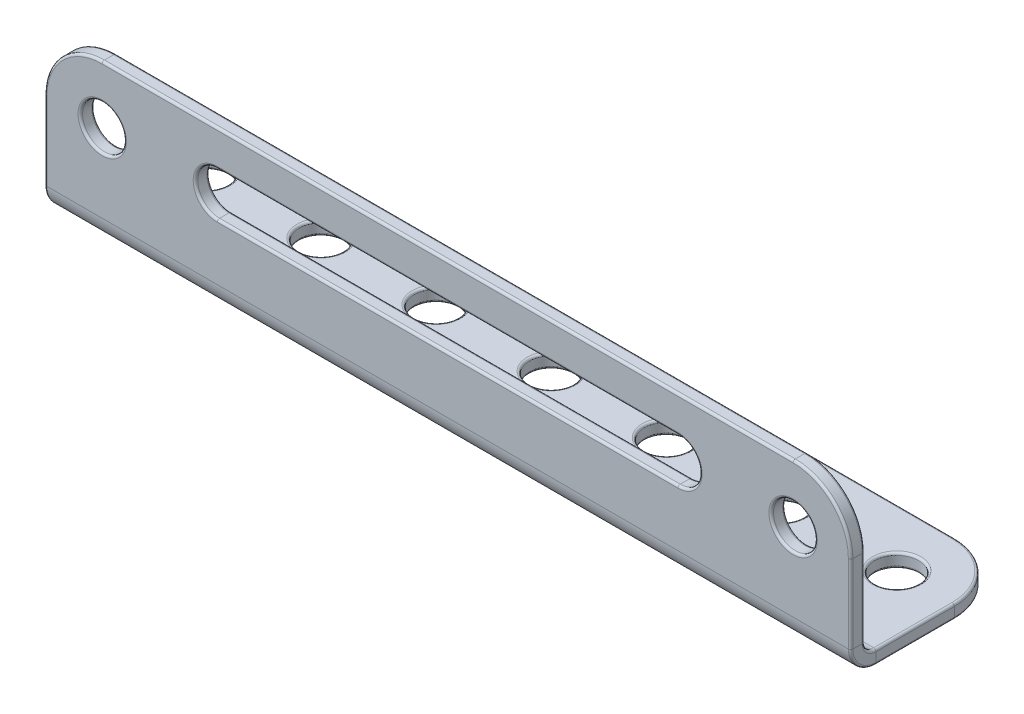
ISO-10303-21;
HEADER;
FILE_DESCRIPTION(('STEP AP214'),'2;1');
FILE_NAME('part.step','',(''),(''),'','','');
FILE_SCHEMA(('AUTOMOTIVE_DESIGN { 1 0 10303 214 1 1 1 1 }'));
ENDSEC;
DATA;
#1=APPLICATION_CONTEXT('core data for automotive mechanical design processes');
#2=APPLICATION_PROTOCOL_DEFINITION('international standard','automotive_design',2000,#1);
#3=PRODUCT_CONTEXT('',#1,'mechanical');
#4=PRODUCT('Part','Part','',(#3));
#5=PRODUCT_RELATED_PRODUCT_CATEGORY('part','',(#4));
#6=PRODUCT_DEFINITION_FORMATION('','',#4);
#7=PRODUCT_DEFINITION_CONTEXT('part definition',#1,'design');
#8=PRODUCT_DEFINITION('design','',#6,#7);
#9=PRODUCT_DEFINITION_SHAPE('','',#8);
#10=(LENGTH_UNIT() NAMED_UNIT(*) SI_UNIT(.MILLI.,.METRE.));
#11=(NAMED_UNIT(*) PLANE_ANGLE_UNIT() SI_UNIT($,.RADIAN.));
#12=(NAMED_UNIT(*) SI_UNIT($,.STERADIAN.) SOLID_ANGLE_UNIT());
#13=UNCERTAINTY_MEASURE_WITH_UNIT(LENGTH_MEASURE(1.E-05),#10,'distance_accuracy_value','');
#14=(GEOMETRIC_REPRESENTATION_CONTEXT(3) GLOBAL_UNCERTAINTY_ASSIGNED_CONTEXT((#13)) GLOBAL_UNIT_ASSIGNED_CONTEXT((#10,
#11,#12)) REPRESENTATION_CONTEXT('',''));
#15=CARTESIAN_POINT('',(0.,0.,0.));
#16=DIRECTION('',(0.,0.,1.));
#17=DIRECTION('',(1.,0.,0.));
#18=AXIS2_PLACEMENT_3D('',#15,#16,#17);
#19=CARTESIAN_POINT('',(6.35,11.43,-17.78));
#20=DIRECTION('',(0.,0.,1.));
#21=DIRECTION('',(0.,-1.,0.));
#22=AXIS2_PLACEMENT_3D('',#19,#20,#21);
#23=PLANE('',#22);
#24=CARTESIAN_POINT('',(82.55,11.43,-17.7800000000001));
#25=DIRECTION('',(0.,0.,1.));
#26=DIRECTION('',(0.,-1.,0.));
#27=AXIS2_PLACEMENT_3D('',#24,#25,#26);
#28=CIRCLE('',#27,2.667);
#29=CARTESIAN_POINT('',(82.55,8.76300000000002,-17.78));
#30=VERTEX_POINT('',#29);
#31=EDGE_CURVE('E420',#30,#30,#28,.F.);
#32=ORIENTED_EDGE('',*,*,#31,.T.);
#33=EDGE_LOOP('',(#32));
#34=FACE_BOUND('',#33,.T.);
#35=DIRECTION('',(1.,0.,0.));
#36=VECTOR('',#35,1.);
#37=CARTESIAN_POINT('',(6.35,14.097,-17.78));
#38=LINE('',#37,#36);
#39=CARTESIAN_POINT('',(19.05,14.097,-17.7800000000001));
#40=VERTEX_POINT('',#39);
#41=CARTESIAN_POINT('',(69.85,14.097,-17.7800000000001));
#42=VERTEX_POINT('',#41);
#43=EDGE_CURVE('E415',#40,#42,#38,.T.);
#44=ORIENTED_EDGE('',*,*,#43,.T.);
#45=CARTESIAN_POINT('',(69.85,11.43,-17.7800000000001));
#46=DIRECTION('',(0.,0.,1.));
#47=DIRECTION('',(0.,-1.,0.));
#48=AXIS2_PLACEMENT_3D('',#45,#46,#47);
#49=CIRCLE('',#48,2.667);
#50=CARTESIAN_POINT('',(69.85,8.76300000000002,-17.78));
#51=VERTEX_POINT('',#50);
#52=EDGE_CURVE('E417',#42,#51,#49,.F.);
#53=ORIENTED_EDGE('',*,*,#52,.T.);
#54=DIRECTION('',(-1.,0.,0.));
#55=VECTOR('',#54,1.);
#56=CARTESIAN_POINT('',(6.35,8.763,-17.78));
#57=LINE('',#56,#55);
#58=CARTESIAN_POINT('',(19.05,8.763,-17.78));
#59=VERTEX_POINT('',#58);
#60=EDGE_CURVE('E411',#51,#59,#57,.T.);
#61=ORIENTED_EDGE('',*,*,#60,.T.);
#62=CARTESIAN_POINT('',(19.05,11.43,-17.78));
#63=DIRECTION('',(0.,0.,1.));
#64=DIRECTION('',(0.,-1.,0.));
#65=AXIS2_PLACEMENT_3D('',#62,#63,#64);
#66=CIRCLE('',#65,2.667);
#67=EDGE_CURVE('E413',#59,#40,#66,.F.);
#68=ORIENTED_EDGE('',*,*,#67,.T.);
#69=EDGE_LOOP('',(#44,#53,#61,#68));
#70=FACE_BOUND('',#69,.T.);
#71=CARTESIAN_POINT('',(6.35,11.43,-17.78));
#72=DIRECTION('',(0.,0.,1.));
#73=DIRECTION('',(0.,-1.,0.));
#74=AXIS2_PLACEMENT_3D('',#71,#72,#73);
#75=CIRCLE('',#74,2.667);
#76=CARTESIAN_POINT('',(6.35,8.763,-17.78));
#77=VERTEX_POINT('',#76);
#78=EDGE_CURVE('E408',#77,#77,#75,.F.);
#79=ORIENTED_EDGE('',*,*,#78,.T.);
#80=EDGE_LOOP('',(#79));
#81=FACE_BOUND('',#80,.T.);
#82=DIRECTION('',(1.,0.,0.));
#83=VECTOR('',#82,1.);
#84=CARTESIAN_POINT('',(6.35,2.79400000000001,-17.78));
#85=LINE('',#84,#83);
#86=CARTESIAN_POINT('',(0.253999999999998,2.79400000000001,-17.78));
#87=VERTEX_POINT('',#86);
#88=CARTESIAN_POINT('',(88.646,2.79400000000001,-17.78));
#89=VERTEX_POINT('',#88);
#90=EDGE_CURVE('E402',#87,#89,#85,.T.);
#91=ORIENTED_EDGE('',*,*,#90,.T.);
#92=DIRECTION('',(0.,-1.,0.));
#93=VECTOR('',#92,1.);
#94=CARTESIAN_POINT('',(88.646,11.43,-17.7800000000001));
#95=LINE('',#94,#93);
#96=CARTESIAN_POINT('',(88.646,11.43,-17.7800000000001));
#97=VERTEX_POINT('',#96);
#98=EDGE_CURVE('E253',#89,#97,#95,.F.);
#99=ORIENTED_EDGE('',*,*,#98,.T.);
#100=CARTESIAN_POINT('',(82.55,11.43,-17.7800000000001));
#101=DIRECTION('',(0.,0.,1.));
#102=DIRECTION('',(0.,-1.,0.));
#103=AXIS2_PLACEMENT_3D('',#100,#101,#102);
#104=CIRCLE('',#103,6.096);
#105=CARTESIAN_POINT('',(82.55,17.526,-17.7800000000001));
#106=VERTEX_POINT('',#105);
#107=EDGE_CURVE('E430',#97,#106,#104,.T.);
#108=ORIENTED_EDGE('',*,*,#107,.T.);
#109=DIRECTION('',(1.,0.,0.));
#110=VECTOR('',#109,1.);
#111=CARTESIAN_POINT('',(6.35000000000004,17.526,-17.7800000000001));
#112=LINE('',#111,#110);
#113=CARTESIAN_POINT('',(6.35000000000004,17.526,-17.7800000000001));
#114=VERTEX_POINT('',#113);
#115=EDGE_CURVE('E428',#106,#114,#112,.F.);
#116=ORIENTED_EDGE('',*,*,#115,.T.);
#117=CARTESIAN_POINT('',(6.35,11.43,-17.78));
#118=DIRECTION('',(0.,0.,1.));
#119=DIRECTION('',(0.,-1.,0.));
#120=AXIS2_PLACEMENT_3D('',#117,#118,#119);
#121=CIRCLE('',#120,6.096);
#122=CARTESIAN_POINT('',(0.254000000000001,11.43,-17.78));
#123=VERTEX_POINT('',#122);
#124=EDGE_CURVE('E425',#114,#123,#121,.T.);
#125=ORIENTED_EDGE('',*,*,#124,.T.);
#126=DIRECTION('',(0.,1.,0.));
#127=VECTOR('',#126,1.);
#128=CARTESIAN_POINT('',(0.254000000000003,2.79400000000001,-17.78));
#129=LINE('',#128,#127);
#130=EDGE_CURVE('E423',#123,#87,#129,.F.);
#131=ORIENTED_EDGE('',*,*,#130,.T.);
#132=EDGE_LOOP('',(#91,#99,#108,#116,#125,#131));
#133=FACE_BOUND('',#132,.T.);
#134=ADVANCED_FACE('F36',(#34,#70,#81,#133),#23,.T.);
#135=CARTESIAN_POINT('',(6.35,11.43,-19.304));
#136=DIRECTION('',(0.,0.,1.));
#137=DIRECTION('',(0.,-1.,0.));
#138=AXIS2_PLACEMENT_3D('',#135,#136,#137);
#139=PLANE('',#138);
#140=CARTESIAN_POINT('',(82.55,11.43,-19.3040000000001));
#141=DIRECTION('',(0.,0.,1.));
#142=DIRECTION('',(0.,-1.,0.));
#143=AXIS2_PLACEMENT_3D('',#140,#141,#142);
#144=CIRCLE('',#143,2.667);
#145=CARTESIAN_POINT('',(82.55,8.76300000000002,-19.304));
#146=VERTEX_POINT('',#145);
#147=EDGE_CURVE('E604',#146,#146,#144,.T.);
#148=ORIENTED_EDGE('',*,*,#147,.T.);
#149=EDGE_LOOP('',(#148));
#150=FACE_BOUND('',#149,.T.);
#151=CARTESIAN_POINT('',(69.85,11.43,-19.3040000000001));
#152=DIRECTION('',(0.,0.,1.));
#153=DIRECTION('',(0.,-1.,0.));
#154=AXIS2_PLACEMENT_3D('',#151,#152,#153);
#155=CIRCLE('',#154,2.667);
#156=CARTESIAN_POINT('',(69.85,8.76300000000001,-19.304));
#157=VERTEX_POINT('',#156);
#158=CARTESIAN_POINT('',(69.85,14.097,-19.3040000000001));
#159=VERTEX_POINT('',#158);
#160=EDGE_CURVE('E599',#157,#159,#155,.T.);
#161=ORIENTED_EDGE('',*,*,#160,.T.);
#162=DIRECTION('',(1.,0.,0.));
#163=VECTOR('',#162,1.);
#164=CARTESIAN_POINT('',(19.05,14.097,-19.3040000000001));
#165=LINE('',#164,#163);
#166=CARTESIAN_POINT('',(19.05,14.097,-19.3040000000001));
#167=VERTEX_POINT('',#166);
#168=EDGE_CURVE('E601',#159,#167,#165,.F.);
#169=ORIENTED_EDGE('',*,*,#168,.T.);
#170=CARTESIAN_POINT('',(19.05,11.43,-19.304));
#171=DIRECTION('',(0.,0.,1.));
#172=DIRECTION('',(0.,-1.,0.));
#173=AXIS2_PLACEMENT_3D('',#170,#171,#172);
#174=CIRCLE('',#173,2.667);
#175=CARTESIAN_POINT('',(19.05,8.763,-19.304));
#176=VERTEX_POINT('',#175);
#177=EDGE_CURVE('E595',#167,#176,#174,.T.);
#178=ORIENTED_EDGE('',*,*,#177,.T.);
#179=DIRECTION('',(-1.,0.,0.));
#180=VECTOR('',#179,1.);
#181=CARTESIAN_POINT('',(69.85,8.76300000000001,-19.304));
#182=LINE('',#181,#180);
#183=EDGE_CURVE('E597',#176,#157,#182,.F.);
#184=ORIENTED_EDGE('',*,*,#183,.T.);
#185=EDGE_LOOP('',(#161,#169,#178,#184));
#186=FACE_BOUND('',#185,.T.);
#187=CARTESIAN_POINT('',(6.35,11.43,-19.304));
#188=DIRECTION('',(0.,0.,1.));
#189=DIRECTION('',(0.,-1.,0.));
#190=AXIS2_PLACEMENT_3D('',#187,#188,#189);
#191=CIRCLE('',#190,2.667);
#192=CARTESIAN_POINT('',(6.35,8.76299999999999,-19.304));
#193=VERTEX_POINT('',#192);
#194=EDGE_CURVE('E592',#193,#193,#191,.T.);
#195=ORIENTED_EDGE('',*,*,#194,.T.);
#196=EDGE_LOOP('',(#195));
#197=FACE_BOUND('',#196,.T.);
#198=CARTESIAN_POINT('',(82.55,11.43,-19.3040000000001));
#199=DIRECTION('',(0.,0.,1.));
#200=DIRECTION('',(0.,-1.,0.));
#201=AXIS2_PLACEMENT_3D('',#198,#199,#200);
#202=CIRCLE('',#201,6.096);
#203=CARTESIAN_POINT('',(82.55,17.526,-19.3040000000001));
#204=VERTEX_POINT('',#203);
#205=CARTESIAN_POINT('',(88.646,11.43,-19.3040000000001));
#206=VERTEX_POINT('',#205);
#207=EDGE_CURVE('E587',#204,#206,#202,.F.);
#208=ORIENTED_EDGE('',*,*,#207,.T.);
#209=DIRECTION('',(0.,-1.,0.));
#210=VECTOR('',#209,1.);
#211=CARTESIAN_POINT('',(88.646,11.43,-19.3040000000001));
#212=LINE('',#211,#210);
#213=CARTESIAN_POINT('',(88.646,2.794,-19.304));
#214=VERTEX_POINT('',#213);
#215=EDGE_CURVE('E589',#206,#214,#212,.T.);
#216=ORIENTED_EDGE('',*,*,#215,.T.);
#217=DIRECTION('',(1.,0.,0.));
#218=VECTOR('',#217,1.);
#219=CARTESIAN_POINT('',(6.35,2.794,-19.304));
#220=LINE('',#219,#218);
#221=CARTESIAN_POINT('',(0.253999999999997,2.794,-19.304));
#222=VERTEX_POINT('',#221);
#223=EDGE_CURVE('E264',#222,#214,#220,.T.);
#224=ORIENTED_EDGE('',*,*,#223,.F.);
#225=DIRECTION('',(0.,1.,0.));
#226=VECTOR('',#225,1.);
#227=CARTESIAN_POINT('',(0.254000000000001,11.43,-19.304));
#228=LINE('',#227,#226);
#229=CARTESIAN_POINT('',(0.254000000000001,11.4299999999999,-19.304));
#230=VERTEX_POINT('',#229);
#231=EDGE_CURVE('E582',#222,#230,#228,.T.);
#232=ORIENTED_EDGE('',*,*,#231,.T.);
#233=CARTESIAN_POINT('',(6.35,11.43,-19.304));
#234=DIRECTION('',(0.,0.,1.));
#235=DIRECTION('',(0.,-1.,0.));
#236=AXIS2_PLACEMENT_3D('',#233,#234,#235);
#237=CIRCLE('',#236,6.096);
#238=CARTESIAN_POINT('',(6.35000000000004,17.526,-19.3040000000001));
#239=VERTEX_POINT('',#238);
#240=EDGE_CURVE('E584',#230,#239,#237,.F.);
#241=ORIENTED_EDGE('',*,*,#240,.T.);
#242=DIRECTION('',(1.,0.,0.));
#243=VECTOR('',#242,1.);
#244=CARTESIAN_POINT('',(6.35,17.526,-19.3040000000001));
#245=LINE('',#244,#243);
#246=EDGE_CURVE('E278',#239,#204,#245,.T.);
#247=ORIENTED_EDGE('',*,*,#246,.T.);
#248=EDGE_LOOP('',(#208,#216,#224,#232,#241,#247));
#249=FACE_BOUND('',#248,.T.);
#250=ADVANCED_FACE('F705',(#150,#186,#197,#249),#139,.F.);
#251=CARTESIAN_POINT('',(6.35,11.43,-19.304));
#252=DIRECTION('',(0.,0.,1.));
#253=DIRECTION('',(0.,-1.,0.));
#254=AXIS2_PLACEMENT_3D('',#251,#252,#253);
#255=CYLINDRICAL_SURFACE('',#254,6.35);
#256=DIRECTION('',(0.,0.,1.));
#257=VECTOR('',#256,1.);
#258=CARTESIAN_POINT('',(0.,11.4299999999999,-19.304));
#259=LINE('',#258,#257);
#260=CARTESIAN_POINT('',(0.,11.4299999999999,-19.05));
#261=VERTEX_POINT('',#260);
#262=CARTESIAN_POINT('',(0.,11.43,-18.034));
#263=VERTEX_POINT('',#262);
#264=EDGE_CURVE('E391',#261,#263,#259,.T.);
#265=ORIENTED_EDGE('',*,*,#264,.T.);
#266=CARTESIAN_POINT('',(6.35,11.43,-18.034));
#267=DIRECTION('',(0.,0.,1.));
#268=DIRECTION('',(0.,-1.,0.));
#269=AXIS2_PLACEMENT_3D('',#266,#267,#268);
#270=CIRCLE('',#269,6.35);
#271=CARTESIAN_POINT('',(6.35000000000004,17.78,-18.0340000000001));
#272=VERTEX_POINT('',#271);
#273=EDGE_CURVE('E263',#263,#272,#270,.F.);
#274=ORIENTED_EDGE('',*,*,#273,.T.);
#275=DIRECTION('',(0.,0.,1.));
#276=VECTOR('',#275,1.);
#277=CARTESIAN_POINT('',(6.35000000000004,17.78,-19.3040000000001));
#278=LINE('',#277,#276);
#279=CARTESIAN_POINT('',(6.35000000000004,17.78,-19.0500000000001));
#280=VERTEX_POINT('',#279);
#281=EDGE_CURVE('E245',#280,#272,#278,.T.);
#282=ORIENTED_EDGE('',*,*,#281,.F.);
#283=CARTESIAN_POINT('',(6.35,11.43,-19.05));
#284=DIRECTION('',(0.,0.,1.));
#285=DIRECTION('',(0.,-1.,0.));
#286=AXIS2_PLACEMENT_3D('',#283,#284,#285);
#287=CIRCLE('',#286,6.35);
#288=EDGE_CURVE('E260',#280,#261,#287,.T.);
#289=ORIENTED_EDGE('',*,*,#288,.T.);
#290=EDGE_LOOP('',(#265,#274,#282,#289));
#291=FACE_BOUND('',#290,.T.);
#292=ADVANCED_FACE('F259',(#291),#255,.T.);
#293=CARTESIAN_POINT('',(6.35000000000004,17.78,-19.3040000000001));
#294=DIRECTION('',(0.,-1.,0.));
#295=DIRECTION('',(-1.,0.,0.));
#296=AXIS2_PLACEMENT_3D('',#293,#294,#295);
#297=PLANE('',#296);
#298=ORIENTED_EDGE('',*,*,#281,.T.);
#299=DIRECTION('',(1.,0.,0.));
#300=VECTOR('',#299,1.);
#301=CARTESIAN_POINT('',(82.55,17.78,-18.0340000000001));
#302=LINE('',#301,#300);
#303=CARTESIAN_POINT('',(82.55,17.78,-18.0340000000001));
#304=VERTEX_POINT('',#303);
#305=EDGE_CURVE('E252',#272,#304,#302,.T.);
#306=ORIENTED_EDGE('',*,*,#305,.T.);
#307=DIRECTION('',(0.,0.,1.));
#308=VECTOR('',#307,1.);
#309=CARTESIAN_POINT('',(82.55,17.78,-19.3040000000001));
#310=LINE('',#309,#308);
#311=CARTESIAN_POINT('',(82.55,17.78,-19.0500000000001));
#312=VERTEX_POINT('',#311);
#313=EDGE_CURVE('E247',#312,#304,#310,.T.);
#314=ORIENTED_EDGE('',*,*,#313,.F.);
#315=DIRECTION('',(1.,0.,0.));
#316=VECTOR('',#315,1.);
#317=CARTESIAN_POINT('',(6.35000000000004,17.78,-19.0500000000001));
#318=LINE('',#317,#316);
#319=EDGE_CURVE('E242',#312,#280,#318,.F.);
#320=ORIENTED_EDGE('',*,*,#319,.T.);
#321=EDGE_LOOP('',(#298,#306,#314,#320));
#322=FACE_BOUND('',#321,.T.);
#323=ADVANCED_FACE('F244',(#322),#297,.F.);
#324=CARTESIAN_POINT('',(82.55,11.43,-19.3040000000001));
#325=DIRECTION('',(0.,0.,1.));
#326=DIRECTION('',(0.,-1.,0.));
#327=AXIS2_PLACEMENT_3D('',#324,#325,#326);
#328=CYLINDRICAL_SURFACE('',#327,6.35);
#329=ORIENTED_EDGE('',*,*,#313,.T.);
#330=CARTESIAN_POINT('',(82.55,11.43,-18.0340000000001));
#331=DIRECTION('',(0.,0.,1.));
#332=DIRECTION('',(0.,-1.,0.));
#333=AXIS2_PLACEMENT_3D('',#330,#331,#332);
#334=CIRCLE('',#333,6.35);
#335=CARTESIAN_POINT('',(88.9,11.43,-18.0340000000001));
#336=VERTEX_POINT('',#335);
#337=EDGE_CURVE('E436',#304,#336,#334,.F.);
#338=ORIENTED_EDGE('',*,*,#337,.T.);
#339=DIRECTION('',(0.,0.,1.));
#340=VECTOR('',#339,1.);
#341=CARTESIAN_POINT('',(88.9,11.43,-19.3040000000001));
#342=LINE('',#341,#340);
#343=CARTESIAN_POINT('',(88.9,11.43,-19.0500000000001));
#344=VERTEX_POINT('',#343);
#345=EDGE_CURVE('E393',#344,#336,#342,.T.);
#346=ORIENTED_EDGE('',*,*,#345,.F.);
#347=CARTESIAN_POINT('',(82.55,11.43,-19.0500000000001));
#348=DIRECTION('',(0.,0.,1.));
#349=DIRECTION('',(0.,-1.,0.));
#350=AXIS2_PLACEMENT_3D('',#347,#348,#349);
#351=CIRCLE('',#350,6.35);
#352=EDGE_CURVE('E434',#344,#312,#351,.T.);
#353=ORIENTED_EDGE('',*,*,#352,.T.);
#354=EDGE_LOOP('',(#329,#338,#346,#353));
#355=FACE_BOUND('',#354,.T.);
#356=ADVANCED_FACE('F751',(#355),#328,.T.);
#357=CARTESIAN_POINT('',(88.9,11.43,-19.3040000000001));
#358=DIRECTION('',(-1.,0.,0.));
#359=DIRECTION('',(0.,1.,0.));
#360=AXIS2_PLACEMENT_3D('',#357,#358,#359);
#361=PLANE('',#360);
#362=ORIENTED_EDGE('',*,*,#345,.T.);
#363=DIRECTION('',(0.,-1.,0.));
#364=VECTOR('',#363,1.);
#365=CARTESIAN_POINT('',(88.9,2.79400000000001,-18.034));
#366=LINE('',#365,#364);
#367=CARTESIAN_POINT('',(88.9,2.79400000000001,-18.0340000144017));
#368=VERTEX_POINT('',#367);
#369=EDGE_CURVE('E441',#336,#368,#366,.T.);
#370=ORIENTED_EDGE('',*,*,#369,.T.);
#371=DIRECTION('',(0.,0.,1.));
#372=VECTOR('',#371,1.);
#373=CARTESIAN_POINT('',(88.9,2.79400000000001,-19.304));
#374=LINE('',#373,#372);
#375=CARTESIAN_POINT('',(88.9,2.79400000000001,-19.0500000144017));
#376=VERTEX_POINT('',#375);
#377=EDGE_CURVE('E399',#376,#368,#374,.T.);
#378=ORIENTED_EDGE('',*,*,#377,.F.);
#379=DIRECTION('',(0.,-1.,0.));
#380=VECTOR('',#379,1.);
#381=CARTESIAN_POINT('',(88.9,11.43,-19.0500000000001));
#382=LINE('',#381,#380);
#383=EDGE_CURVE('E438',#376,#344,#382,.F.);
#384=ORIENTED_EDGE('',*,*,#383,.T.);
#385=EDGE_LOOP('',(#362,#370,#378,#384));
#386=FACE_BOUND('',#385,.T.);
#387=ADVANCED_FACE('F749',(#386),#361,.F.);
#388=CARTESIAN_POINT('',(0.,11.4299999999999,-19.304));
#389=DIRECTION('',(1.,0.,0.));
#390=DIRECTION('',(0.,-1.,0.));
#391=AXIS2_PLACEMENT_3D('',#388,#389,#390);
#392=PLANE('',#391);
#393=DIRECTION('',(0.,0.,-1.));
#394=VECTOR('',#393,1.);
#395=CARTESIAN_POINT('',(0.,2.79400000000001,-19.304));
#396=LINE('',#395,#394);
#397=CARTESIAN_POINT('',(0.,2.79400000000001,-18.0340000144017));
#398=VERTEX_POINT('',#397);
#399=CARTESIAN_POINT('',(0.,2.79400000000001,-19.0500000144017));
#400=VERTEX_POINT('',#399);
#401=EDGE_CURVE('E275',#398,#400,#396,.T.);
#402=ORIENTED_EDGE('',*,*,#401,.F.);
#403=DIRECTION('',(0.,1.,0.));
#404=VECTOR('',#403,1.);
#405=CARTESIAN_POINT('',(0.,11.43,-18.034));
#406=LINE('',#405,#404);
#407=EDGE_CURVE('E445',#398,#263,#406,.T.);
#408=ORIENTED_EDGE('',*,*,#407,.T.);
#409=ORIENTED_EDGE('',*,*,#264,.F.);
#410=DIRECTION('',(0.,1.,0.));
#411=VECTOR('',#410,1.);
#412=CARTESIAN_POINT('',(0.,11.4299999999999,-19.05));
#413=LINE('',#412,#411);
#414=EDGE_CURVE('E443',#261,#400,#413,.F.);
#415=ORIENTED_EDGE('',*,*,#414,.T.);
#416=EDGE_LOOP('',(#402,#408,#409,#415));
#417=FACE_BOUND('',#416,.T.);
#418=ADVANCED_FACE('F38',(#417),#392,.F.);
#419=CARTESIAN_POINT('',(19.05,11.43,-19.304));
#420=DIRECTION('',(0.,0.,1.));
#421=DIRECTION('',(0.,-1.,0.));
#422=AXIS2_PLACEMENT_3D('',#419,#420,#421);
#423=CYLINDRICAL_SURFACE('',#422,2.413);
#424=DIRECTION('',(0.,0.,1.));
#425=VECTOR('',#424,1.);
#426=CARTESIAN_POINT('',(19.05,13.843,-19.304));
#427=LINE('',#426,#425);
#428=CARTESIAN_POINT('',(19.05,13.843,-19.05));
#429=VERTEX_POINT('',#428);
#430=CARTESIAN_POINT('',(19.05,13.843,-18.034));
#431=VERTEX_POINT('',#430);
#432=EDGE_CURVE('E388',#429,#431,#427,.T.);
#433=ORIENTED_EDGE('',*,*,#432,.T.);
#434=CARTESIAN_POINT('',(19.05,11.43,-18.034));
#435=DIRECTION('',(0.,0.,1.));
#436=DIRECTION('',(0.,-1.,0.));
#437=AXIS2_PLACEMENT_3D('',#434,#435,#436);
#438=CIRCLE('',#437,2.413);
#439=CARTESIAN_POINT('',(19.05,9.017,-18.034));
#440=VERTEX_POINT('',#439);
#441=EDGE_CURVE('E465',#431,#440,#438,.T.);
#442=ORIENTED_EDGE('',*,*,#441,.T.);
#443=DIRECTION('',(0.,0.,1.));
#444=VECTOR('',#443,1.);
#445=CARTESIAN_POINT('',(19.05,9.017,-19.304));
#446=LINE('',#445,#444);
#447=CARTESIAN_POINT('',(19.05,9.017,-19.05));
#448=VERTEX_POINT('',#447);
#449=EDGE_CURVE('E360',#448,#440,#446,.T.);
#450=ORIENTED_EDGE('',*,*,#449,.F.);
#451=CARTESIAN_POINT('',(19.05,11.43,-19.05));
#452=DIRECTION('',(0.,0.,1.));
#453=DIRECTION('',(0.,-1.,0.));
#454=AXIS2_PLACEMENT_3D('',#451,#452,#453);
#455=CIRCLE('',#454,2.413);
#456=EDGE_CURVE('E463',#448,#429,#455,.F.);
#457=ORIENTED_EDGE('',*,*,#456,.T.);
#458=EDGE_LOOP('',(#433,#442,#450,#457));
#459=FACE_BOUND('',#458,.T.);
#460=ADVANCED_FACE('F761',(#459),#423,.F.);
#461=CARTESIAN_POINT('',(19.05,13.843,-19.304));
#462=DIRECTION('',(0.,-1.,0.));
#463=DIRECTION('',(-1.,0.,0.));
#464=AXIS2_PLACEMENT_3D('',#461,#462,#463);
#465=PLANE('',#464);
#466=DIRECTION('',(0.,0.,1.));
#467=VECTOR('',#466,1.);
#468=CARTESIAN_POINT('',(69.85,13.843,-19.3040000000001));
#469=LINE('',#468,#467);
#470=CARTESIAN_POINT('',(69.85,13.843,-19.0500000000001));
#471=VERTEX_POINT('',#470);
#472=CARTESIAN_POINT('',(69.85,13.843,-18.0340000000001));
#473=VERTEX_POINT('',#472);
#474=EDGE_CURVE('E385',#471,#473,#469,.T.);
#475=ORIENTED_EDGE('',*,*,#474,.T.);
#476=DIRECTION('',(1.,0.,0.));
#477=VECTOR('',#476,1.);
#478=CARTESIAN_POINT('',(19.05,13.843,-18.034));
#479=LINE('',#478,#477);
#480=EDGE_CURVE('E461',#473,#431,#479,.F.);
#481=ORIENTED_EDGE('',*,*,#480,.T.);
#482=ORIENTED_EDGE('',*,*,#432,.F.);
#483=DIRECTION('',(1.,0.,0.));
#484=VECTOR('',#483,1.);
#485=CARTESIAN_POINT('',(69.85,13.843,-19.0500000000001));
#486=LINE('',#485,#484);
#487=EDGE_CURVE('E458',#429,#471,#486,.T.);
#488=ORIENTED_EDGE('',*,*,#487,.T.);
#489=EDGE_LOOP('',(#475,#481,#482,#488));
#490=FACE_BOUND('',#489,.T.);
#491=ADVANCED_FACE('F764',(#490),#465,.T.);
#492=CARTESIAN_POINT('',(69.85,11.43,-19.3040000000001));
#493=DIRECTION('',(0.,0.,1.));
#494=DIRECTION('',(0.,-1.,0.));
#495=AXIS2_PLACEMENT_3D('',#492,#493,#494);
#496=CYLINDRICAL_SURFACE('',#495,2.413);
#497=DIRECTION('',(0.,0.,1.));
#498=VECTOR('',#497,1.);
#499=CARTESIAN_POINT('',(69.85,9.01700000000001,-19.304));
#500=LINE('',#499,#498);
#501=CARTESIAN_POINT('',(69.85,9.01700000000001,-19.05));
#502=VERTEX_POINT('',#501);
#503=CARTESIAN_POINT('',(69.85,9.01700000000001,-18.034));
#504=VERTEX_POINT('',#503);
#505=EDGE_CURVE('E382',#502,#504,#500,.T.);
#506=ORIENTED_EDGE('',*,*,#505,.T.);
#507=CARTESIAN_POINT('',(69.85,11.43,-18.034));
#508=DIRECTION('',(0.,0.,1.));
#509=DIRECTION('',(0.,-1.,0.));
#510=AXIS2_PLACEMENT_3D('',#507,#508,#509);
#511=CIRCLE('',#510,2.413);
#512=EDGE_CURVE('E455',#504,#473,#511,.T.);
#513=ORIENTED_EDGE('',*,*,#512,.T.);
#514=ORIENTED_EDGE('',*,*,#474,.F.);
#515=CARTESIAN_POINT('',(69.85,11.43,-19.0500000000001));
#516=DIRECTION('',(0.,0.,1.));
#517=DIRECTION('',(0.,-1.,0.));
#518=AXIS2_PLACEMENT_3D('',#515,#516,#517);
#519=CIRCLE('',#518,2.413);
#520=EDGE_CURVE('E453',#471,#502,#519,.F.);
#521=ORIENTED_EDGE('',*,*,#520,.T.);
#522=EDGE_LOOP('',(#506,#513,#514,#521));
#523=FACE_BOUND('',#522,.T.);
#524=ADVANCED_FACE('F768',(#523),#496,.F.);
#525=CARTESIAN_POINT('',(19.05,9.017,-19.304));
#526=DIRECTION('',(0.,1.,0.));
#527=DIRECTION('',(1.,0.,0.));
#528=AXIS2_PLACEMENT_3D('',#525,#526,#527);
#529=PLANE('',#528);
#530=ORIENTED_EDGE('',*,*,#449,.T.);
#531=DIRECTION('',(-1.,0.,0.));
#532=VECTOR('',#531,1.);
#533=CARTESIAN_POINT('',(19.05,9.017,-18.034));
#534=LINE('',#533,#532);
#535=EDGE_CURVE('E469',#440,#504,#534,.F.);
#536=ORIENTED_EDGE('',*,*,#535,.T.);
#537=ORIENTED_EDGE('',*,*,#505,.F.);
#538=DIRECTION('',(-1.,0.,0.));
#539=VECTOR('',#538,1.);
#540=CARTESIAN_POINT('',(19.05,9.017,-19.05));
#541=LINE('',#540,#539);
#542=EDGE_CURVE('E467',#502,#448,#541,.T.);
#543=ORIENTED_EDGE('',*,*,#542,.T.);
#544=EDGE_LOOP('',(#530,#536,#537,#543));
#545=FACE_BOUND('',#544,.T.);
#546=ADVANCED_FACE('F772',(#545),#529,.T.);
#547=CARTESIAN_POINT('',(6.35,11.43,-19.304));
#548=DIRECTION('',(0.,0.,1.));
#549=DIRECTION('',(0.,-1.,0.));
#550=AXIS2_PLACEMENT_3D('',#547,#548,#549);
#551=CYLINDRICAL_SURFACE('',#550,2.413);
#552=CARTESIAN_POINT('',(6.35,11.43,-18.034));
#553=DIRECTION('',(0.,0.,1.));
#554=DIRECTION('',(0.,-1.,0.));
#555=AXIS2_PLACEMENT_3D('',#552,#553,#554);
#556=CIRCLE('',#555,2.413);
#557=CARTESIAN_POINT('',(6.35,9.017,-18.034));
#558=VERTEX_POINT('',#557);
#559=EDGE_CURVE('E474',#558,#558,#556,.T.);
#560=CARTESIAN_POINT('',(6.35,11.43,-19.05));
#561=DIRECTION('',(0.,0.,1.));
#562=DIRECTION('',(0.,-1.,0.));
#563=AXIS2_PLACEMENT_3D('',#560,#561,#562);
#564=CIRCLE('',#563,2.413);
#565=CARTESIAN_POINT('',(6.35,9.017,-19.05));
#566=VERTEX_POINT('',#565);
#567=EDGE_CURVE('E471',#566,#566,#564,.F.);
#568=CARTESIAN_POINT('',(6.35,9.017,-18.034));
#569=CARTESIAN_POINT('',(6.35,9.017,-18.0445833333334));
#570=CARTESIAN_POINT('',(6.35,9.017,-18.0551666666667));
#571=CARTESIAN_POINT('',(6.35,9.017,-18.0763333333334));
#572=CARTESIAN_POINT('',(6.35,9.017,-18.0869166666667));
#573=CARTESIAN_POINT('',(6.35,9.017,-18.1080833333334));
#574=CARTESIAN_POINT('',(6.35,9.017,-18.1186666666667));
#575=CARTESIAN_POINT('',(6.35,9.017,-18.1398333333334));
#576=CARTESIAN_POINT('',(6.35,9.017,-18.1504166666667));
#577=CARTESIAN_POINT('',(6.35,9.017,-18.1715833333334));
#578=CARTESIAN_POINT('',(6.35,9.017,-18.1821666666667));
#579=CARTESIAN_POINT('',(6.35,9.017,-18.2033333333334));
#580=CARTESIAN_POINT('',(6.35,9.017,-18.2139166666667));
#581=CARTESIAN_POINT('',(6.35,9.017,-18.2350833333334));
#582=CARTESIAN_POINT('',(6.35,9.017,-18.2456666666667));
#583=CARTESIAN_POINT('',(6.35,9.017,-18.2668333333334));
#584=CARTESIAN_POINT('',(6.35,9.017,-18.2774166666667));
#585=CARTESIAN_POINT('',(6.35,9.017,-18.2985833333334));
#586=CARTESIAN_POINT('',(6.35,9.017,-18.3091666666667));
#587=CARTESIAN_POINT('',(6.35,9.017,-18.3303333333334));
#588=CARTESIAN_POINT('',(6.35,9.017,-18.3409166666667));
#589=CARTESIAN_POINT('',(6.35,9.017,-18.3620833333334));
#590=CARTESIAN_POINT('',(6.35,9.017,-18.3726666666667));
#591=CARTESIAN_POINT('',(6.35,9.017,-18.3938333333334));
#592=CARTESIAN_POINT('',(6.35,9.017,-18.4044166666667));
#593=CARTESIAN_POINT('',(6.35,9.017,-18.4255833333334));
#594=CARTESIAN_POINT('',(6.35,9.017,-18.4361666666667));
#595=CARTESIAN_POINT('',(6.35,9.017,-18.4573333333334));
#596=CARTESIAN_POINT('',(6.35,9.017,-18.4679166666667));
#597=CARTESIAN_POINT('',(6.35,9.017,-18.4890833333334));
#598=CARTESIAN_POINT('',(6.35,9.017,-18.4996666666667));
#599=CARTESIAN_POINT('',(6.35,9.017,-18.5208333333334));
#600=CARTESIAN_POINT('',(6.35,9.017,-18.5314166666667));
#601=CARTESIAN_POINT('',(6.35,9.017,-18.5525833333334));
#602=CARTESIAN_POINT('',(6.35,9.017,-18.5631666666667));
#603=CARTESIAN_POINT('',(6.35,9.017,-18.5843333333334));
#604=CARTESIAN_POINT('',(6.35,9.017,-18.5949166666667));
#605=CARTESIAN_POINT('',(6.35,9.017,-18.6160833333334));
#606=CARTESIAN_POINT('',(6.35,9.017,-18.6266666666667));
#607=CARTESIAN_POINT('',(6.35,9.017,-18.6478333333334));
#608=CARTESIAN_POINT('',(6.35,9.017,-18.6584166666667));
#609=CARTESIAN_POINT('',(6.35,9.017,-18.6795833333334));
#610=CARTESIAN_POINT('',(6.35,9.017,-18.6901666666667));
#611=CARTESIAN_POINT('',(6.35,9.017,-18.7113333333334));
#612=CARTESIAN_POINT('',(6.35,9.017,-18.7219166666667));
#613=CARTESIAN_POINT('',(6.35,9.017,-18.7430833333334));
#614=CARTESIAN_POINT('',(6.35,9.017,-18.7536666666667));
#615=CARTESIAN_POINT('',(6.35,9.017,-18.7748333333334));
#616=CARTESIAN_POINT('',(6.35,9.017,-18.7854166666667));
#617=CARTESIAN_POINT('',(6.35,9.017,-18.8065833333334));
#618=CARTESIAN_POINT('',(6.35,9.017,-18.8171666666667));
#619=CARTESIAN_POINT('',(6.35,9.017,-18.8383333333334));
#620=CARTESIAN_POINT('',(6.35,9.017,-18.8489166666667));
#621=CARTESIAN_POINT('',(6.35,9.017,-18.8700833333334));
#622=CARTESIAN_POINT('',(6.35,9.017,-18.8806666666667));
#623=CARTESIAN_POINT('',(6.35,9.017,-18.9018333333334));
#624=CARTESIAN_POINT('',(6.35,9.017,-18.9124166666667));
#625=CARTESIAN_POINT('',(6.35,9.017,-18.9335833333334));
#626=CARTESIAN_POINT('',(6.35,9.017,-18.9441666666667));
#627=CARTESIAN_POINT('',(6.35,9.017,-18.9653333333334));
#628=CARTESIAN_POINT('',(6.35,9.017,-18.9759166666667));
#629=CARTESIAN_POINT('',(6.35,9.017,-18.9970833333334));
#630=CARTESIAN_POINT('',(6.35,9.017,-19.0076666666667));
#631=CARTESIAN_POINT('',(6.35,9.017,-19.0288333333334));
#632=CARTESIAN_POINT('',(6.35,9.017,-19.0394166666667));
#633=CARTESIAN_POINT('',(6.35,9.017,-19.05));
#634=B_SPLINE_CURVE_WITH_KNOTS('',3,(#568,#569,#570,#571,#572,#573,#574,#575,#576,#577,#578,
#579,#580,#581,#582,#583,#584,#585,#586,#587,#588,#589,#590,#591,#592,#593,#594,#595,#596,#597,
#598,#599,#600,#601,#602,#603,#604,#605,#606,#607,#608,#609,#610,#611,#612,#613,#614,#615,#616,
#617,#618,#619,#620,#621,#622,#623,#624,#625,#626,#627,#628,#629,#630,#631,#632,#633),
.UNSPECIFIED.,.F.,.F.,(4,2,2,2,2,2,2,2,2,2,2,2,2,2,2,2,2,2,2,2,2,2,2,2,2,2,2,2,2,2,2,2,4),(0.,
0.0317500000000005,0.0635000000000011,0.0952500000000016,0.127000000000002,0.158750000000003,
0.1905,0.22225,0.254000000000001,0.285750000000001,0.317500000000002,0.349250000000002,
0.381000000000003,0.41275,0.4445,0.476250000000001,0.508000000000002,0.539750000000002,
0.571500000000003,0.603250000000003,0.635,0.666750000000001,0.698500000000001,0.730250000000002,
0.762000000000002,0.793750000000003,0.8255,0.85725,0.889000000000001,0.920750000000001,
0.952500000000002,0.984250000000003,1.016),.UNSPECIFIED.);
#635=EDGE_CURVE('BSEAM776',#558,#566,#634,.T.);
#636=ORIENTED_EDGE('',*,*,#559,.T.);
#637=ORIENTED_EDGE('',*,*,#567,.T.);
#638=ORIENTED_EDGE('',*,*,#635,.T.);
#639=ORIENTED_EDGE('',*,*,#635,.F.);
#640=EDGE_LOOP('',(#636,#638,#637,#639));
#641=FACE_BOUND('',#640,.T.);
#642=ADVANCED_FACE('F776',(#641),#551,.F.);
#643=CARTESIAN_POINT('',(82.55,11.43,-19.3040000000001));
#644=DIRECTION('',(0.,0.,1.));
#645=DIRECTION('',(0.,-1.,0.));
#646=AXIS2_PLACEMENT_3D('',#643,#644,#645);
#647=CYLINDRICAL_SURFACE('',#646,2.413);
#648=CARTESIAN_POINT('',(82.55,11.43,-18.0340000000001));
#649=DIRECTION('',(0.,0.,1.));
#650=DIRECTION('',(0.,-1.,0.));
#651=AXIS2_PLACEMENT_3D('',#648,#649,#650);
#652=CIRCLE('',#651,2.413);
#653=CARTESIAN_POINT('',(82.55,9.01700000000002,-18.034));
#654=VERTEX_POINT('',#653);
#655=EDGE_CURVE('E450',#654,#654,#652,.T.);
#656=CARTESIAN_POINT('',(82.55,11.43,-19.0500000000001));
#657=DIRECTION('',(0.,0.,1.));
#658=DIRECTION('',(0.,-1.,0.));
#659=AXIS2_PLACEMENT_3D('',#656,#657,#658);
#660=CIRCLE('',#659,2.413);
#661=CARTESIAN_POINT('',(82.55,9.01700000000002,-19.05));
#662=VERTEX_POINT('',#661);
#663=EDGE_CURVE('E447',#662,#662,#660,.F.);
#664=CARTESIAN_POINT('',(82.55,9.01700000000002,-18.034));
#665=CARTESIAN_POINT('',(82.55,9.01700000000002,-18.0445833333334));
#666=CARTESIAN_POINT('',(82.55,9.01700000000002,-18.0551666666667));
#667=CARTESIAN_POINT('',(82.55,9.01700000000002,-18.0763333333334));
#668=CARTESIAN_POINT('',(82.55,9.01700000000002,-18.0869166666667));
#669=CARTESIAN_POINT('',(82.55,9.01700000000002,-18.1080833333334));
#670=CARTESIAN_POINT('',(82.55,9.01700000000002,-18.1186666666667));
#671=CARTESIAN_POINT('',(82.55,9.01700000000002,-18.1398333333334));
#672=CARTESIAN_POINT('',(82.55,9.01700000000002,-18.1504166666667));
#673=CARTESIAN_POINT('',(82.55,9.01700000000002,-18.1715833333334));
#674=CARTESIAN_POINT('',(82.55,9.01700000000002,-18.1821666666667));
#675=CARTESIAN_POINT('',(82.55,9.01700000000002,-18.2033333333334));
#676=CARTESIAN_POINT('',(82.55,9.01700000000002,-18.2139166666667));
#677=CARTESIAN_POINT('',(82.55,9.01700000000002,-18.2350833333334));
#678=CARTESIAN_POINT('',(82.55,9.01700000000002,-18.2456666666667));
#679=CARTESIAN_POINT('',(82.55,9.01700000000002,-18.2668333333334));
#680=CARTESIAN_POINT('',(82.55,9.01700000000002,-18.2774166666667));
#681=CARTESIAN_POINT('',(82.55,9.01700000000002,-18.2985833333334));
#682=CARTESIAN_POINT('',(82.55,9.01700000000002,-18.3091666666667));
#683=CARTESIAN_POINT('',(82.55,9.01700000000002,-18.3303333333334));
#684=CARTESIAN_POINT('',(82.55,9.01700000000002,-18.3409166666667));
#685=CARTESIAN_POINT('',(82.55,9.01700000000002,-18.3620833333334));
#686=CARTESIAN_POINT('',(82.55,9.01700000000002,-18.3726666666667));
#687=CARTESIAN_POINT('',(82.55,9.01700000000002,-18.3938333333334));
#688=CARTESIAN_POINT('',(82.55,9.01700000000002,-18.4044166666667));
#689=CARTESIAN_POINT('',(82.55,9.01700000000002,-18.4255833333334));
#690=CARTESIAN_POINT('',(82.55,9.01700000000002,-18.4361666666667));
#691=CARTESIAN_POINT('',(82.55,9.01700000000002,-18.4573333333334));
#692=CARTESIAN_POINT('',(82.55,9.01700000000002,-18.4679166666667));
#693=CARTESIAN_POINT('',(82.55,9.01700000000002,-18.4890833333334));
#694=CARTESIAN_POINT('',(82.55,9.01700000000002,-18.4996666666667));
#695=CARTESIAN_POINT('',(82.55,9.01700000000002,-18.5208333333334));
#696=CARTESIAN_POINT('',(82.55,9.01700000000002,-18.5314166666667));
#697=CARTESIAN_POINT('',(82.55,9.01700000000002,-18.5525833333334));
#698=CARTESIAN_POINT('',(82.55,9.01700000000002,-18.5631666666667));
#699=CARTESIAN_POINT('',(82.55,9.01700000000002,-18.5843333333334));
#700=CARTESIAN_POINT('',(82.55,9.01700000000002,-18.5949166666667));
#701=CARTESIAN_POINT('',(82.55,9.01700000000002,-18.6160833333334));
#702=CARTESIAN_POINT('',(82.55,9.01700000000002,-18.6266666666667));
#703=CARTESIAN_POINT('',(82.55,9.01700000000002,-18.6478333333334));
#704=CARTESIAN_POINT('',(82.55,9.01700000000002,-18.6584166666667));
#705=CARTESIAN_POINT('',(82.55,9.01700000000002,-18.6795833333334));
#706=CARTESIAN_POINT('',(82.55,9.01700000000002,-18.6901666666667));
#707=CARTESIAN_POINT('',(82.55,9.01700000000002,-18.7113333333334));
#708=CARTESIAN_POINT('',(82.55,9.01700000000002,-18.7219166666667));
#709=CARTESIAN_POINT('',(82.55,9.01700000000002,-18.7430833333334));
#710=CARTESIAN_POINT('',(82.55,9.01700000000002,-18.7536666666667));
#711=CARTESIAN_POINT('',(82.55,9.01700000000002,-18.7748333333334));
#712=CARTESIAN_POINT('',(82.55,9.01700000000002,-18.7854166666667));
#713=CARTESIAN_POINT('',(82.55,9.01700000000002,-18.8065833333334));
#714=CARTESIAN_POINT('',(82.55,9.01700000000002,-18.8171666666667));
#715=CARTESIAN_POINT('',(82.55,9.01700000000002,-18.8383333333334));
#716=CARTESIAN_POINT('',(82.55,9.01700000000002,-18.8489166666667));
#717=CARTESIAN_POINT('',(82.55,9.01700000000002,-18.8700833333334));
#718=CARTESIAN_POINT('',(82.55,9.01700000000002,-18.8806666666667));
#719=CARTESIAN_POINT('',(82.55,9.01700000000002,-18.9018333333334));
#720=CARTESIAN_POINT('',(82.55,9.01700000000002,-18.9124166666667));
#721=CARTESIAN_POINT('',(82.55,9.01700000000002,-18.9335833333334));
#722=CARTESIAN_POINT('',(82.55,9.01700000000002,-18.9441666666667));
#723=CARTESIAN_POINT('',(82.55,9.01700000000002,-18.9653333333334));
#724=CARTESIAN_POINT('',(82.55,9.01700000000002,-18.9759166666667));
#725=CARTESIAN_POINT('',(82.55,9.01700000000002,-18.9970833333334));
#726=CARTESIAN_POINT('',(82.55,9.01700000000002,-19.0076666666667));
#727=CARTESIAN_POINT('',(82.55,9.01700000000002,-19.0288333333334));
#728=CARTESIAN_POINT('',(82.55,9.01700000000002,-19.0394166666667));
#729=CARTESIAN_POINT('',(82.55,9.01700000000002,-19.05));
#730=B_SPLINE_CURVE_WITH_KNOTS('',3,(#664,#665,#666,#667,#668,#669,#670,#671,#672,#673,#674,
#675,#676,#677,#678,#679,#680,#681,#682,#683,#684,#685,#686,#687,#688,#689,#690,#691,#692,#693,
#694,#695,#696,#697,#698,#699,#700,#701,#702,#703,#704,#705,#706,#707,#708,#709,#710,#711,#712,
#713,#714,#715,#716,#717,#718,#719,#720,#721,#722,#723,#724,#725,#726,#727,#728,#729),
.UNSPECIFIED.,.F.,.F.,(4,2,2,2,2,2,2,2,2,2,2,2,2,2,2,2,2,2,2,2,2,2,2,2,2,2,2,2,2,2,2,2,4),(0.,
0.0317499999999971,0.0634999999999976,0.0952499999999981,0.126999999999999,0.158749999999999,
0.1905,0.222249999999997,0.253999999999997,0.285749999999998,0.317499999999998,
0.349249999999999,0.380999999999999,0.41275,0.444499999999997,0.476249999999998,
0.507999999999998,0.539749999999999,0.571499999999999,0.60325,0.634999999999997,
0.666749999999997,0.698499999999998,0.730249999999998,0.761999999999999,0.793749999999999,
0.825499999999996,0.857249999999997,0.888999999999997,0.920749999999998,0.952499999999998,
0.984249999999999,1.016),.UNSPECIFIED.);
#731=EDGE_CURVE('BSEAM780',#654,#662,#730,.T.);
#732=ORIENTED_EDGE('',*,*,#655,.T.);
#733=ORIENTED_EDGE('',*,*,#663,.T.);
#734=ORIENTED_EDGE('',*,*,#731,.T.);
#735=ORIENTED_EDGE('',*,*,#731,.F.);
#736=EDGE_LOOP('',(#732,#734,#733,#735));
#737=FACE_BOUND('',#736,.T.);
#738=ADVANCED_FACE('F780',(#737),#647,.F.);
#739=CARTESIAN_POINT('',(6.35,1.524,-29.21));
#740=DIRECTION('',(0.,-1.,0.));
#741=DIRECTION('',(0.,0.,-1.));
#742=AXIS2_PLACEMENT_3D('',#739,#740,#741);
#743=CYLINDRICAL_SURFACE('',#742,6.35);
#744=DIRECTION('',(0.,-1.,0.));
#745=VECTOR('',#744,1.);
#746=CARTESIAN_POINT('',(6.35000000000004,1.524,-35.56));
#747=LINE('',#746,#745);
#748=CARTESIAN_POINT('',(6.35000000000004,1.27,-35.56));
#749=VERTEX_POINT('',#748);
#750=CARTESIAN_POINT('',(6.35000000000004,0.254000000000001,-35.56));
#751=VERTEX_POINT('',#750);
#752=EDGE_CURVE('E375',#749,#751,#747,.T.);
#753=ORIENTED_EDGE('',*,*,#752,.T.);
#754=CARTESIAN_POINT('',(6.35,0.254,-29.21));
#755=DIRECTION('',(0.,-1.,0.));
#756=DIRECTION('',(0.,0.,-1.));
#757=AXIS2_PLACEMENT_3D('',#754,#755,#756);
#758=CIRCLE('',#757,6.35);
#759=CARTESIAN_POINT('',(0.,0.254000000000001,-29.21));
#760=VERTEX_POINT('',#759);
#761=EDGE_CURVE('E534',#751,#760,#758,.F.);
#762=ORIENTED_EDGE('',*,*,#761,.T.);
#763=DIRECTION('',(0.,-1.,0.));
#764=VECTOR('',#763,1.);
#765=CARTESIAN_POINT('',(0.,1.524,-29.21));
#766=LINE('',#765,#764);
#767=CARTESIAN_POINT('',(0.,1.27,-29.21));
#768=VERTEX_POINT('',#767);
#769=EDGE_CURVE('E357',#768,#760,#766,.T.);
#770=ORIENTED_EDGE('',*,*,#769,.F.);
#771=CARTESIAN_POINT('',(6.35,1.27,-29.21));
#772=DIRECTION('',(0.,-1.,0.));
#773=DIRECTION('',(0.,0.,-1.));
#774=AXIS2_PLACEMENT_3D('',#771,#772,#773);
#775=CIRCLE('',#774,6.35);
#776=EDGE_CURVE('E532',#768,#749,#775,.T.);
#777=ORIENTED_EDGE('',*,*,#776,.T.);
#778=EDGE_LOOP('',(#753,#762,#770,#777));
#779=FACE_BOUND('',#778,.T.);
#780=ADVANCED_FACE('F719',(#779),#743,.T.);
#781=CARTESIAN_POINT('',(6.35000000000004,1.524,-35.56));
#782=DIRECTION('',(0.,0.,1.));
#783=DIRECTION('',(1.,0.,0.));
#784=AXIS2_PLACEMENT_3D('',#781,#782,#783);
#785=PLANE('',#784);
#786=DIRECTION('',(0.,-1.,0.));
#787=VECTOR('',#786,1.);
#788=CARTESIAN_POINT('',(82.55,1.524,-35.56));
#789=LINE('',#788,#787);
#790=CARTESIAN_POINT('',(82.55,1.27,-35.56));
#791=VERTEX_POINT('',#790);
#792=CARTESIAN_POINT('',(82.55,0.254000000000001,-35.56));
#793=VERTEX_POINT('',#792);
#794=EDGE_CURVE('E372',#791,#793,#789,.T.);
#795=ORIENTED_EDGE('',*,*,#794,.T.);
#796=DIRECTION('',(-1.,0.,0.));
#797=VECTOR('',#796,1.);
#798=CARTESIAN_POINT('',(6.35000000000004,0.254,-35.56));
#799=LINE('',#798,#797);
#800=EDGE_CURVE('E530',#793,#751,#799,.T.);
#801=ORIENTED_EDGE('',*,*,#800,.T.);
#802=ORIENTED_EDGE('',*,*,#752,.F.);
#803=DIRECTION('',(-1.,0.,0.));
#804=VECTOR('',#803,1.);
#805=CARTESIAN_POINT('',(6.35000000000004,1.27,-35.56));
#806=LINE('',#805,#804);
#807=EDGE_CURVE('E528',#749,#791,#806,.F.);
#808=ORIENTED_EDGE('',*,*,#807,.T.);
#809=EDGE_LOOP('',(#795,#801,#802,#808));
#810=FACE_BOUND('',#809,.T.);
#811=ADVANCED_FACE('F653',(#810),#785,.F.);
#812=CARTESIAN_POINT('',(82.55,1.524,-29.21));
#813=DIRECTION('',(0.,-1.,0.));
#814=DIRECTION('',(0.,0.,-1.));
#815=AXIS2_PLACEMENT_3D('',#812,#813,#814);
#816=CYLINDRICAL_SURFACE('',#815,6.35);
#817=DIRECTION('',(0.,-1.,0.));
#818=VECTOR('',#817,1.);
#819=CARTESIAN_POINT('',(88.9,1.524,-29.21));
#820=LINE('',#819,#818);
#821=CARTESIAN_POINT('',(88.9,1.27,-29.21));
#822=VERTEX_POINT('',#821);
#823=CARTESIAN_POINT('',(88.9,0.254000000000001,-29.21));
#824=VERTEX_POINT('',#823);
#825=EDGE_CURVE('E369',#822,#824,#820,.T.);
#826=ORIENTED_EDGE('',*,*,#825,.T.);
#827=CARTESIAN_POINT('',(82.55,0.254,-29.21));
#828=DIRECTION('',(0.,-1.,0.));
#829=DIRECTION('',(0.,0.,-1.));
#830=AXIS2_PLACEMENT_3D('',#827,#828,#829);
#831=CIRCLE('',#830,6.35);
#832=EDGE_CURVE('E526',#824,#793,#831,.F.);
#833=ORIENTED_EDGE('',*,*,#832,.T.);
#834=ORIENTED_EDGE('',*,*,#794,.F.);
#835=CARTESIAN_POINT('',(82.55,1.27,-29.21));
#836=DIRECTION('',(0.,-1.,0.));
#837=DIRECTION('',(0.,0.,-1.));
#838=AXIS2_PLACEMENT_3D('',#835,#836,#837);
#839=CIRCLE('',#838,6.35);
#840=EDGE_CURVE('E524',#791,#822,#839,.T.);
#841=ORIENTED_EDGE('',*,*,#840,.T.);
#842=EDGE_LOOP('',(#826,#833,#834,#841));
#843=FACE_BOUND('',#842,.T.);
#844=ADVANCED_FACE('F656',(#843),#816,.T.);
#845=CARTESIAN_POINT('',(6.35,1.524,-6.35));
#846=DIRECTION('',(0.,-1.,0.));
#847=DIRECTION('',(0.,0.,-1.));
#848=AXIS2_PLACEMENT_3D('',#845,#846,#847);
#849=PLANE('',#848);
#850=CARTESIAN_POINT('',(6.35,1.524,-29.21));
#851=DIRECTION('',(0.,-1.,0.));
#852=DIRECTION('',(0.,0.,-1.));
#853=AXIS2_PLACEMENT_3D('',#850,#851,#852);
#854=CIRCLE('',#853,2.667);
#855=CARTESIAN_POINT('',(6.35,1.524,-31.877));
#856=VERTEX_POINT('',#855);
#857=EDGE_CURVE('E629',#856,#856,#854,.T.);
#858=ORIENTED_EDGE('',*,*,#857,.T.);
#859=EDGE_LOOP('',(#858));
#860=FACE_BOUND('',#859,.T.);
#861=CARTESIAN_POINT('',(19.05,1.524,-29.21));
#862=DIRECTION('',(0.,-1.,0.));
#863=DIRECTION('',(0.,0.,-1.));
#864=AXIS2_PLACEMENT_3D('',#861,#862,#863);
#865=CIRCLE('',#864,2.667);
#866=CARTESIAN_POINT('',(19.05,1.524,-31.877));
#867=VERTEX_POINT('',#866);
#868=EDGE_CURVE('E626',#867,#867,#865,.T.);
#869=ORIENTED_EDGE('',*,*,#868,.T.);
#870=EDGE_LOOP('',(#869));
#871=FACE_BOUND('',#870,.T.);
#872=CARTESIAN_POINT('',(31.75,1.524,-29.21));
#873=DIRECTION('',(0.,-1.,0.));
#874=DIRECTION('',(0.,0.,-1.));
#875=AXIS2_PLACEMENT_3D('',#872,#873,#874);
#876=CIRCLE('',#875,2.667);
#877=CARTESIAN_POINT('',(31.75,1.524,-31.877));
#878=VERTEX_POINT('',#877);
#879=EDGE_CURVE('E623',#878,#878,#876,.T.);
#880=ORIENTED_EDGE('',*,*,#879,.T.);
#881=EDGE_LOOP('',(#880));
#882=FACE_BOUND('',#881,.T.);
#883=CARTESIAN_POINT('',(44.45,1.524,-29.21));
#884=DIRECTION('',(0.,-1.,0.));
#885=DIRECTION('',(0.,0.,-1.));
#886=AXIS2_PLACEMENT_3D('',#883,#884,#885);
#887=CIRCLE('',#886,2.667);
#888=CARTESIAN_POINT('',(44.45,1.524,-31.877));
#889=VERTEX_POINT('',#888);
#890=EDGE_CURVE('E620',#889,#889,#887,.T.);
#891=ORIENTED_EDGE('',*,*,#890,.T.);
#892=EDGE_LOOP('',(#891));
#893=FACE_BOUND('',#892,.T.);
#894=CARTESIAN_POINT('',(57.15,1.524,-29.21));
#895=DIRECTION('',(0.,-1.,0.));
#896=DIRECTION('',(0.,0.,-1.));
#897=AXIS2_PLACEMENT_3D('',#894,#895,#896);
#898=CIRCLE('',#897,2.667);
#899=CARTESIAN_POINT('',(57.15,1.524,-31.877));
#900=VERTEX_POINT('',#899);
#901=EDGE_CURVE('E617',#900,#900,#898,.T.);
#902=ORIENTED_EDGE('',*,*,#901,.T.);
#903=EDGE_LOOP('',(#902));
#904=FACE_BOUND('',#903,.T.);
#905=CARTESIAN_POINT('',(69.85,1.524,-29.21));
#906=DIRECTION('',(0.,-1.,0.));
#907=DIRECTION('',(0.,0.,-1.));
#908=AXIS2_PLACEMENT_3D('',#905,#906,#907);
#909=CIRCLE('',#908,2.667);
#910=CARTESIAN_POINT('',(69.85,1.524,-31.877));
#911=VERTEX_POINT('',#910);
#912=EDGE_CURVE('E614',#911,#911,#909,.T.);
#913=ORIENTED_EDGE('',*,*,#912,.T.);
#914=EDGE_LOOP('',(#913));
#915=FACE_BOUND('',#914,.T.);
#916=CARTESIAN_POINT('',(82.55,1.524,-29.21));
#917=DIRECTION('',(0.,-1.,0.));
#918=DIRECTION('',(0.,0.,-1.));
#919=AXIS2_PLACEMENT_3D('',#916,#917,#918);
#920=CIRCLE('',#919,2.667);
#921=CARTESIAN_POINT('',(82.55,1.524,-31.877));
#922=VERTEX_POINT('',#921);
#923=EDGE_CURVE('E611',#922,#922,#920,.T.);
#924=ORIENTED_EDGE('',*,*,#923,.T.);
#925=EDGE_LOOP('',(#924));
#926=FACE_BOUND('',#925,.T.);
#927=DIRECTION('',(1.,0.,0.));
#928=VECTOR('',#927,1.);
#929=CARTESIAN_POINT('',(6.35,1.524,-20.574));
#930=LINE('',#929,#928);
#931=CARTESIAN_POINT('',(0.254,1.524,-20.574));
#932=VERTEX_POINT('',#931);
#933=CARTESIAN_POINT('',(88.646,1.524,-20.574));
#934=VERTEX_POINT('',#933);
#935=EDGE_CURVE('E367',#932,#934,#930,.T.);
#936=ORIENTED_EDGE('',*,*,#935,.T.);
#937=DIRECTION('',(0.,0.,-1.));
#938=VECTOR('',#937,1.);
#939=CARTESIAN_POINT('',(88.646,1.524,-6.35));
#940=LINE('',#939,#938);
#941=CARTESIAN_POINT('',(88.646,1.524,-29.21));
#942=VERTEX_POINT('',#941);
#943=EDGE_CURVE('E12',#934,#942,#940,.T.);
#944=ORIENTED_EDGE('',*,*,#943,.T.);
#945=CARTESIAN_POINT('',(82.55,1.524,-29.21));
#946=DIRECTION('',(0.,-1.,0.));
#947=DIRECTION('',(0.,0.,-1.));
#948=AXIS2_PLACEMENT_3D('',#945,#946,#947);
#949=CIRCLE('',#948,6.096);
#950=CARTESIAN_POINT('',(82.55,1.524,-35.306));
#951=VERTEX_POINT('',#950);
#952=EDGE_CURVE('E44',#942,#951,#949,.F.);
#953=ORIENTED_EDGE('',*,*,#952,.T.);
#954=DIRECTION('',(-1.,0.,0.));
#955=VECTOR('',#954,1.);
#956=CARTESIAN_POINT('',(6.35,1.524,-35.306));
#957=LINE('',#956,#955);
#958=CARTESIAN_POINT('',(6.35000000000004,1.524,-35.306));
#959=VERTEX_POINT('',#958);
#960=EDGE_CURVE('E636',#951,#959,#957,.T.);
#961=ORIENTED_EDGE('',*,*,#960,.T.);
#962=CARTESIAN_POINT('',(6.35,1.524,-29.21));
#963=DIRECTION('',(0.,-1.,0.));
#964=DIRECTION('',(0.,0.,-1.));
#965=AXIS2_PLACEMENT_3D('',#962,#963,#964);
#966=CIRCLE('',#965,6.096);
#967=CARTESIAN_POINT('',(0.254,1.524,-29.21));
#968=VERTEX_POINT('',#967);
#969=EDGE_CURVE('E634',#959,#968,#966,.F.);
#970=ORIENTED_EDGE('',*,*,#969,.T.);
#971=DIRECTION('',(0.,0.,1.));
#972=VECTOR('',#971,1.);
#973=CARTESIAN_POINT('',(0.254,1.524,-6.35));
#974=LINE('',#973,#972);
#975=EDGE_CURVE('E632',#968,#932,#974,.T.);
#976=ORIENTED_EDGE('',*,*,#975,.T.);
#977=EDGE_LOOP('',(#936,#944,#953,#961,#970,#976));
#978=FACE_BOUND('',#977,.T.);
#979=ADVANCED_FACE('F638',(#860,#871,#882,#893,#904,#915,#926,#978),#849,.F.);
#980=CARTESIAN_POINT('',(88.9,1.524,-6.35));
#981=DIRECTION('',(-1.,0.,0.));
#982=DIRECTION('',(0.,0.,1.));
#983=AXIS2_PLACEMENT_3D('',#980,#981,#982);
#984=PLANE('',#983);
#985=DIRECTION('',(0.,-1.,0.));
#986=VECTOR('',#985,1.);
#987=CARTESIAN_POINT('',(88.9,1.524,-20.574));
#988=LINE('',#987,#986);
#989=CARTESIAN_POINT('',(88.9,1.27,-20.574));
#990=VERTEX_POINT('',#989);
#991=CARTESIAN_POINT('',(88.9,0.254,-20.574));
#992=VERTEX_POINT('',#991);
#993=EDGE_CURVE('E364',#990,#992,#988,.T.);
#994=ORIENTED_EDGE('',*,*,#993,.T.);
#995=DIRECTION('',(0.,0.,-1.));
#996=VECTOR('',#995,1.);
#997=CARTESIAN_POINT('',(88.9,0.254,-29.21));
#998=LINE('',#997,#996);
#999=EDGE_CURVE('E491',#992,#824,#998,.T.);
#1000=ORIENTED_EDGE('',*,*,#999,.T.);
#1001=ORIENTED_EDGE('',*,*,#825,.F.);
#1002=DIRECTION('',(0.,0.,-1.));
#1003=VECTOR('',#1002,1.);
#1004=CARTESIAN_POINT('',(88.9,1.27,-6.35));
#1005=LINE('',#1004,#1003);
#1006=EDGE_CURVE('E489',#822,#990,#1005,.F.);
#1007=ORIENTED_EDGE('',*,*,#1006,.T.);
#1008=EDGE_LOOP('',(#994,#1000,#1001,#1007));
#1009=FACE_BOUND('',#1008,.T.);
#1010=ADVANCED_FACE('F789',(#1009),#984,.F.);
#1011=CARTESIAN_POINT('',(6.35,0.,-6.35));
#1012=DIRECTION('',(0.,-1.,0.));
#1013=DIRECTION('',(0.,0.,-1.));
#1014=AXIS2_PLACEMENT_3D('',#1011,#1012,#1013);
#1015=PLANE('',#1014);
#1016=CARTESIAN_POINT('',(6.35,0.,-29.21));
#1017=DIRECTION('',(0.,-1.,0.));
#1018=DIRECTION('',(0.,0.,-1.));
#1019=AXIS2_PLACEMENT_3D('',#1016,#1017,#1018);
#1020=CIRCLE('',#1019,2.667);
#1021=CARTESIAN_POINT('',(6.35,0.,-31.877));
#1022=VERTEX_POINT('',#1021);
#1023=EDGE_CURVE('E511',#1022,#1022,#1020,.F.);
#1024=ORIENTED_EDGE('',*,*,#1023,.T.);
#1025=EDGE_LOOP('',(#1024));
#1026=FACE_BOUND('',#1025,.T.);
#1027=CARTESIAN_POINT('',(19.05,0.,-29.21));
#1028=DIRECTION('',(0.,-1.,0.));
#1029=DIRECTION('',(0.,0.,-1.));
#1030=AXIS2_PLACEMENT_3D('',#1027,#1028,#1029);
#1031=CIRCLE('',#1030,2.667);
#1032=CARTESIAN_POINT('',(19.05,0.,-31.877));
#1033=VERTEX_POINT('',#1032);
#1034=EDGE_CURVE('E508',#1033,#1033,#1031,.F.);
#1035=ORIENTED_EDGE('',*,*,#1034,.T.);
#1036=EDGE_LOOP('',(#1035));
#1037=FACE_BOUND('',#1036,.T.);
#1038=CARTESIAN_POINT('',(31.75,0.,-29.21));
#1039=DIRECTION('',(0.,-1.,0.));
#1040=DIRECTION('',(0.,0.,-1.));
#1041=AXIS2_PLACEMENT_3D('',#1038,#1039,#1040);
#1042=CIRCLE('',#1041,2.667);
#1043=CARTESIAN_POINT('',(31.75,0.,-31.877));
#1044=VERTEX_POINT('',#1043);
#1045=EDGE_CURVE('E505',#1044,#1044,#1042,.F.);
#1046=ORIENTED_EDGE('',*,*,#1045,.T.);
#1047=EDGE_LOOP('',(#1046));
#1048=FACE_BOUND('',#1047,.T.);
#1049=CARTESIAN_POINT('',(44.45,0.,-29.21));
#1050=DIRECTION('',(0.,-1.,0.));
#1051=DIRECTION('',(0.,0.,-1.));
#1052=AXIS2_PLACEMENT_3D('',#1049,#1050,#1051);
#1053=CIRCLE('',#1052,2.667);
#1054=CARTESIAN_POINT('',(44.45,0.,-31.877));
#1055=VERTEX_POINT('',#1054);
#1056=EDGE_CURVE('E502',#1055,#1055,#1053,.F.);
#1057=ORIENTED_EDGE('',*,*,#1056,.T.);
#1058=EDGE_LOOP('',(#1057));
#1059=FACE_BOUND('',#1058,.T.);
#1060=CARTESIAN_POINT('',(57.15,0.,-29.21));
#1061=DIRECTION('',(0.,-1.,0.));
#1062=DIRECTION('',(0.,0.,-1.));
#1063=AXIS2_PLACEMENT_3D('',#1060,#1061,#1062);
#1064=CIRCLE('',#1063,2.667);
#1065=CARTESIAN_POINT('',(57.15,0.,-31.877));
#1066=VERTEX_POINT('',#1065);
#1067=EDGE_CURVE('E499',#1066,#1066,#1064,.F.);
#1068=ORIENTED_EDGE('',*,*,#1067,.T.);
#1069=EDGE_LOOP('',(#1068));
#1070=FACE_BOUND('',#1069,.T.);
#1071=CARTESIAN_POINT('',(69.85,0.,-29.21));
#1072=DIRECTION('',(0.,-1.,0.));
#1073=DIRECTION('',(0.,0.,-1.));
#1074=AXIS2_PLACEMENT_3D('',#1071,#1072,#1073);
#1075=CIRCLE('',#1074,2.667);
#1076=CARTESIAN_POINT('',(69.85,0.,-31.877));
#1077=VERTEX_POINT('',#1076);
#1078=EDGE_CURVE('E496',#1077,#1077,#1075,.F.);
#1079=ORIENTED_EDGE('',*,*,#1078,.T.);
#1080=EDGE_LOOP('',(#1079));
#1081=FACE_BOUND('',#1080,.T.);
#1082=CARTESIAN_POINT('',(82.55,0.,-29.21));
#1083=DIRECTION('',(0.,-1.,0.));
#1084=DIRECTION('',(0.,0.,-1.));
#1085=AXIS2_PLACEMENT_3D('',#1082,#1083,#1084);
#1086=CIRCLE('',#1085,2.667);
#1087=CARTESIAN_POINT('',(82.55,0.,-31.877));
#1088=VERTEX_POINT('',#1087);
#1089=EDGE_CURVE('E493',#1088,#1088,#1086,.F.);
#1090=ORIENTED_EDGE('',*,*,#1089,.T.);
#1091=EDGE_LOOP('',(#1090));
#1092=FACE_BOUND('',#1091,.T.);
#1093=CARTESIAN_POINT('',(82.55,0.,-29.21));
#1094=DIRECTION('',(0.,-1.,0.));
#1095=DIRECTION('',(0.,0.,-1.));
#1096=AXIS2_PLACEMENT_3D('',#1093,#1094,#1095);
#1097=CIRCLE('',#1096,6.096);
#1098=CARTESIAN_POINT('',(82.55,0.,-35.306));
#1099=VERTEX_POINT('',#1098);
#1100=CARTESIAN_POINT('',(88.646,0.,-29.21));
#1101=VERTEX_POINT('',#1100);
#1102=EDGE_CURVE('E520',#1099,#1101,#1097,.T.);
#1103=ORIENTED_EDGE('',*,*,#1102,.T.);
#1104=DIRECTION('',(0.,0.,-1.));
#1105=VECTOR('',#1104,1.);
#1106=CARTESIAN_POINT('',(88.646,0.,-20.574));
#1107=LINE('',#1106,#1105);
#1108=CARTESIAN_POINT('',(88.646,0.,-20.574));
#1109=VERTEX_POINT('',#1108);
#1110=EDGE_CURVE('E522',#1101,#1109,#1107,.F.);
#1111=ORIENTED_EDGE('',*,*,#1110,.T.);
#1112=DIRECTION('',(1.,0.,0.));
#1113=VECTOR('',#1112,1.);
#1114=CARTESIAN_POINT('',(6.35,0.,-20.574));
#1115=LINE('',#1114,#1113);
#1116=CARTESIAN_POINT('',(0.254,0.,-20.574));
#1117=VERTEX_POINT('',#1116);
#1118=EDGE_CURVE('E356',#1117,#1109,#1115,.T.);
#1119=ORIENTED_EDGE('',*,*,#1118,.F.);
#1120=DIRECTION('',(0.,0.,1.));
#1121=VECTOR('',#1120,1.);
#1122=CARTESIAN_POINT('',(0.254,0.,-29.21));
#1123=LINE('',#1122,#1121);
#1124=CARTESIAN_POINT('',(0.254,0.,-29.21));
#1125=VERTEX_POINT('',#1124);
#1126=EDGE_CURVE('E514',#1117,#1125,#1123,.F.);
#1127=ORIENTED_EDGE('',*,*,#1126,.T.);
#1128=CARTESIAN_POINT('',(6.35,0.,-29.21));
#1129=DIRECTION('',(0.,-1.,0.));
#1130=DIRECTION('',(0.,0.,-1.));
#1131=AXIS2_PLACEMENT_3D('',#1128,#1129,#1130);
#1132=CIRCLE('',#1131,6.096);
#1133=CARTESIAN_POINT('',(6.35000000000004,0.,-35.306));
#1134=VERTEX_POINT('',#1133);
#1135=EDGE_CURVE('E516',#1125,#1134,#1132,.T.);
#1136=ORIENTED_EDGE('',*,*,#1135,.T.);
#1137=DIRECTION('',(-1.,0.,0.));
#1138=VECTOR('',#1137,1.);
#1139=CARTESIAN_POINT('',(82.55,0.,-35.306));
#1140=LINE('',#1139,#1138);
#1141=EDGE_CURVE('E518',#1134,#1099,#1140,.F.);
#1142=ORIENTED_EDGE('',*,*,#1141,.T.);
#1143=EDGE_LOOP('',(#1103,#1111,#1119,#1127,#1136,#1142));
#1144=FACE_BOUND('',#1143,.T.);
#1145=ADVANCED_FACE('F672',(#1026,#1037,#1048,#1059,#1070,#1081,#1092,#1144),#1015,.T.);
#1146=CARTESIAN_POINT('',(0.,1.524,-6.35000000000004));
#1147=DIRECTION('',(1.,0.,0.));
#1148=DIRECTION('',(0.,0.,-1.));
#1149=AXIS2_PLACEMENT_3D('',#1146,#1147,#1148);
#1150=PLANE('',#1149);
#1151=ORIENTED_EDGE('',*,*,#769,.T.);
#1152=DIRECTION('',(0.,0.,1.));
#1153=VECTOR('',#1152,1.);
#1154=CARTESIAN_POINT('',(0.,0.254,-20.574));
#1155=LINE('',#1154,#1153);
#1156=CARTESIAN_POINT('',(0.,0.254,-20.574));
#1157=VERTEX_POINT('',#1156);
#1158=EDGE_CURVE('E538',#760,#1157,#1155,.T.);
#1159=ORIENTED_EDGE('',*,*,#1158,.T.);
#1160=DIRECTION('',(0.,1.,0.));
#1161=VECTOR('',#1160,1.);
#1162=CARTESIAN_POINT('',(0.,1.524,-20.574));
#1163=LINE('',#1162,#1161);
#1164=CARTESIAN_POINT('',(0.,1.27,-20.574));
#1165=VERTEX_POINT('',#1164);
#1166=EDGE_CURVE('E361',#1157,#1165,#1163,.T.);
#1167=ORIENTED_EDGE('',*,*,#1166,.T.);
#1168=DIRECTION('',(0.,0.,1.));
#1169=VECTOR('',#1168,1.);
#1170=CARTESIAN_POINT('',(0.,1.27,-6.35000000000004));
#1171=LINE('',#1170,#1169);
#1172=EDGE_CURVE('E536',#1165,#768,#1171,.F.);
#1173=ORIENTED_EDGE('',*,*,#1172,.T.);
#1174=EDGE_LOOP('',(#1151,#1159,#1167,#1173));
#1175=FACE_BOUND('',#1174,.T.);
#1176=ADVANCED_FACE('F716',(#1175),#1150,.F.);
#1177=CARTESIAN_POINT('',(0.,2.79399998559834,-20.574));
#1178=DIRECTION('',(1.,0.,0.));
#1179=DIRECTION('',(0.,0.,-1.));
#1180=AXIS2_PLACEMENT_3D('',#1177,#1178,#1179);
#1181=PLANE('',#1180);
#1182=ORIENTED_EDGE('',*,*,#1166,.F.);
#1183=CARTESIAN_POINT('',(0.,2.794,-20.574));
#1184=DIRECTION('',(1.,0.,0.));
#1185=DIRECTION('',(0.,0.,-1.));
#1186=AXIS2_PLACEMENT_3D('',#1183,#1184,#1185);
#1187=CIRCLE('',#1186,2.53999998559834);
#1188=EDGE_CURVE('E479',#1157,#398,#1187,.F.);
#1189=ORIENTED_EDGE('',*,*,#1188,.T.);
#1190=ORIENTED_EDGE('',*,*,#401,.T.);
#1191=CARTESIAN_POINT('',(0.,2.794,-20.574));
#1192=DIRECTION('',(1.,0.,0.));
#1193=DIRECTION('',(0.,0.,-1.));
#1194=AXIS2_PLACEMENT_3D('',#1191,#1192,#1193);
#1195=CIRCLE('',#1194,1.52399998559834);
#1196=EDGE_CURVE('E477',#400,#1165,#1195,.T.);
#1197=ORIENTED_EDGE('',*,*,#1196,.T.);
#1198=EDGE_LOOP('',(#1182,#1189,#1190,#1197));
#1199=FACE_BOUND('',#1198,.T.);
#1200=ADVANCED_FACE('F694',(#1199),#1181,.F.);
#1201=CARTESIAN_POINT('',(88.9,2.79399998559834,-20.574));
#1202=DIRECTION('',(-1.,0.,0.));
#1203=DIRECTION('',(0.,0.,1.));
#1204=AXIS2_PLACEMENT_3D('',#1201,#1202,#1203);
#1205=PLANE('',#1204);
#1206=ORIENTED_EDGE('',*,*,#377,.T.);
#1207=CARTESIAN_POINT('',(88.9,2.794,-20.574));
#1208=DIRECTION('',(-1.,0.,0.));
#1209=DIRECTION('',(0.,0.,1.));
#1210=AXIS2_PLACEMENT_3D('',#1207,#1208,#1209);
#1211=CIRCLE('',#1210,2.53999998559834);
#1212=EDGE_CURVE('E487',#368,#992,#1211,.F.);
#1213=ORIENTED_EDGE('',*,*,#1212,.T.);
#1214=ORIENTED_EDGE('',*,*,#993,.F.);
#1215=CARTESIAN_POINT('',(88.9,2.794,-20.574));
#1216=DIRECTION('',(-1.,0.,0.));
#1217=DIRECTION('',(0.,0.,1.));
#1218=AXIS2_PLACEMENT_3D('',#1215,#1216,#1217);
#1219=CIRCLE('',#1218,1.52399998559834);
#1220=EDGE_CURVE('E485',#990,#376,#1219,.T.);
#1221=ORIENTED_EDGE('',*,*,#1220,.T.);
#1222=EDGE_LOOP('',(#1206,#1213,#1214,#1221));
#1223=FACE_BOUND('',#1222,.T.);
#1224=ADVANCED_FACE('F805',(#1223),#1205,.F.);
#1225=CARTESIAN_POINT('',(-44.6384859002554,2.794,-20.574));
#1226=DIRECTION('',(1.,0.,0.));
#1227=DIRECTION('',(0.,0.,-1.));
#1228=AXIS2_PLACEMENT_3D('',#1225,#1226,#1227);
#1229=CYLINDRICAL_SURFACE('',#1228,1.26999998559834);
#1230=ORIENTED_EDGE('',*,*,#935,.F.);
#1231=CARTESIAN_POINT('',(0.253999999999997,2.794,-20.574));
#1232=DIRECTION('',(1.,0.,0.));
#1233=DIRECTION('',(0.,0.,-1.));
#1234=AXIS2_PLACEMENT_3D('',#1231,#1232,#1233);
#1235=CIRCLE('',#1234,1.26999998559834);
#1236=EDGE_CURVE('E609',#932,#222,#1235,.F.);
#1237=ORIENTED_EDGE('',*,*,#1236,.T.);
#1238=ORIENTED_EDGE('',*,*,#223,.T.);
#1239=CARTESIAN_POINT('',(88.646,2.794,-20.574));
#1240=DIRECTION('',(-1.,0.,0.));
#1241=DIRECTION('',(0.,0.,1.));
#1242=AXIS2_PLACEMENT_3D('',#1239,#1240,#1241);
#1243=CIRCLE('',#1242,1.26999998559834);
#1244=EDGE_CURVE('E607',#214,#934,#1243,.F.);
#1245=ORIENTED_EDGE('',*,*,#1244,.T.);
#1246=EDGE_LOOP('',(#1230,#1237,#1238,#1245));
#1247=FACE_BOUND('',#1246,.T.);
#1248=ADVANCED_FACE('F709',(#1247),#1229,.F.);
#1249=CARTESIAN_POINT('',(-44.6384859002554,2.794,-20.574));
#1250=DIRECTION('',(1.,0.,0.));
#1251=DIRECTION('',(0.,0.,-1.));
#1252=AXIS2_PLACEMENT_3D('',#1249,#1250,#1251);
#1253=CYLINDRICAL_SURFACE('',#1252,2.79399998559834);
#1254=ORIENTED_EDGE('',*,*,#90,.F.);
#1255=CARTESIAN_POINT('',(0.253999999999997,2.794,-20.574));
#1256=DIRECTION('',(1.,0.,0.));
#1257=DIRECTION('',(0.,0.,-1.));
#1258=AXIS2_PLACEMENT_3D('',#1255,#1256,#1257);
#1259=CIRCLE('',#1258,2.79399998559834);
#1260=EDGE_CURVE('E483',#87,#1117,#1259,.T.);
#1261=ORIENTED_EDGE('',*,*,#1260,.T.);
#1262=ORIENTED_EDGE('',*,*,#1118,.T.);
#1263=CARTESIAN_POINT('',(88.646,2.794,-20.574));
#1264=DIRECTION('',(-1.,0.,0.));
#1265=DIRECTION('',(0.,0.,1.));
#1266=AXIS2_PLACEMENT_3D('',#1263,#1264,#1265);
#1267=CIRCLE('',#1266,2.79399998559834);
#1268=EDGE_CURVE('E481',#1109,#89,#1267,.T.);
#1269=ORIENTED_EDGE('',*,*,#1268,.T.);
#1270=EDGE_LOOP('',(#1254,#1261,#1262,#1269));
#1271=FACE_BOUND('',#1270,.T.);
#1272=ADVANCED_FACE('F676',(#1271),#1253,.T.);
#1273=CARTESIAN_POINT('',(6.35,0.,-29.21));
#1274=DIRECTION('',(0.,1.,0.));
#1275=DIRECTION('',(0.,0.,1.));
#1276=AXIS2_PLACEMENT_3D('',#1273,#1274,#1275);
#1277=CYLINDRICAL_SURFACE('',#1276,2.413);
#1278=CARTESIAN_POINT('',(6.35,0.254,-29.21));
#1279=DIRECTION('',(0.,-1.,0.));
#1280=DIRECTION('',(0.,0.,-1.));
#1281=AXIS2_PLACEMENT_3D('',#1278,#1279,#1280);
#1282=CIRCLE('',#1281,2.413);
#1283=CARTESIAN_POINT('',(6.35,0.254,-26.797));
#1284=VERTEX_POINT('',#1283);
#1285=EDGE_CURVE('E543',#1284,#1284,#1282,.T.);
#1286=CARTESIAN_POINT('',(6.35,1.27,-29.21));
#1287=DIRECTION('',(0.,-1.,0.));
#1288=DIRECTION('',(0.,0.,-1.));
#1289=AXIS2_PLACEMENT_3D('',#1286,#1287,#1288);
#1290=CIRCLE('',#1289,2.413);
#1291=CARTESIAN_POINT('',(6.35,1.27,-26.797));
#1292=VERTEX_POINT('',#1291);
#1293=EDGE_CURVE('E540',#1292,#1292,#1290,.F.);
#1294=CARTESIAN_POINT('',(6.35,0.254,-26.797));
#1295=CARTESIAN_POINT('',(6.35,0.264583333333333,-26.797));
#1296=CARTESIAN_POINT('',(6.35,0.275166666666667,-26.797));
#1297=CARTESIAN_POINT('',(6.35,0.296333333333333,-26.797));
#1298=CARTESIAN_POINT('',(6.35,0.306916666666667,-26.797));
#1299=CARTESIAN_POINT('',(6.35,0.328083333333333,-26.797));
#1300=CARTESIAN_POINT('',(6.35,0.338666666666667,-26.797));
#1301=CARTESIAN_POINT('',(6.35,0.359833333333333,-26.797));
#1302=CARTESIAN_POINT('',(6.35,0.370416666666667,-26.797));
#1303=CARTESIAN_POINT('',(6.35,0.391583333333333,-26.797));
#1304=CARTESIAN_POINT('',(6.35,0.402166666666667,-26.797));
#1305=CARTESIAN_POINT('',(6.35,0.423333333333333,-26.797));
#1306=CARTESIAN_POINT('',(6.35,0.433916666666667,-26.797));
#1307=CARTESIAN_POINT('',(6.35,0.455083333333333,-26.797));
#1308=CARTESIAN_POINT('',(6.35,0.465666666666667,-26.797));
#1309=CARTESIAN_POINT('',(6.35,0.486833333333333,-26.797));
#1310=CARTESIAN_POINT('',(6.35,0.497416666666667,-26.797));
#1311=CARTESIAN_POINT('',(6.35,0.518583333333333,-26.797));
#1312=CARTESIAN_POINT('',(6.35,0.529166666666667,-26.797));
#1313=CARTESIAN_POINT('',(6.35,0.550333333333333,-26.797));
#1314=CARTESIAN_POINT('',(6.35,0.560916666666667,-26.797));
#1315=CARTESIAN_POINT('',(6.35,0.582083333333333,-26.797));
#1316=CARTESIAN_POINT('',(6.35,0.592666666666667,-26.797));
#1317=CARTESIAN_POINT('',(6.35,0.613833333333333,-26.797));
#1318=CARTESIAN_POINT('',(6.35,0.624416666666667,-26.797));
#1319=CARTESIAN_POINT('',(6.35,0.645583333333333,-26.797));
#1320=CARTESIAN_POINT('',(6.35,0.656166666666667,-26.797));
#1321=CARTESIAN_POINT('',(6.35,0.677333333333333,-26.797));
#1322=CARTESIAN_POINT('',(6.35,0.687916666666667,-26.797));
#1323=CARTESIAN_POINT('',(6.35,0.709083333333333,-26.797));
#1324=CARTESIAN_POINT('',(6.35,0.719666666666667,-26.797));
#1325=CARTESIAN_POINT('',(6.35,0.740833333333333,-26.797));
#1326=CARTESIAN_POINT('',(6.35,0.751416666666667,-26.797));
#1327=CARTESIAN_POINT('',(6.35,0.772583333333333,-26.797));
#1328=CARTESIAN_POINT('',(6.35,0.783166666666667,-26.797));
#1329=CARTESIAN_POINT('',(6.35,0.804333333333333,-26.797));
#1330=CARTESIAN_POINT('',(6.35,0.814916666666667,-26.797));
#1331=CARTESIAN_POINT('',(6.35,0.836083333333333,-26.797));
#1332=CARTESIAN_POINT('',(6.35,0.846666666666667,-26.797));
#1333=CARTESIAN_POINT('',(6.35,0.867833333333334,-26.797));
#1334=CARTESIAN_POINT('',(6.35,0.878416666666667,-26.797));
#1335=CARTESIAN_POINT('',(6.35,0.899583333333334,-26.797));
#1336=CARTESIAN_POINT('',(6.35,0.910166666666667,-26.797));
#1337=CARTESIAN_POINT('',(6.35,0.931333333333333,-26.797));
#1338=CARTESIAN_POINT('',(6.35,0.941916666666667,-26.797));
#1339=CARTESIAN_POINT('',(6.35,0.963083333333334,-26.797));
#1340=CARTESIAN_POINT('',(6.35,0.973666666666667,-26.797));
#1341=CARTESIAN_POINT('',(6.35,0.994833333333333,-26.797));
#1342=CARTESIAN_POINT('',(6.35,1.00541666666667,-26.797));
#1343=CARTESIAN_POINT('',(6.35,1.02658333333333,-26.797));
#1344=CARTESIAN_POINT('',(6.35,1.03716666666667,-26.797));
#1345=CARTESIAN_POINT('',(6.35,1.05833333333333,-26.797));
#1346=CARTESIAN_POINT('',(6.35,1.06891666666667,-26.797));
#1347=CARTESIAN_POINT('',(6.35,1.09008333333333,-26.797));
#1348=CARTESIAN_POINT('',(6.35,1.10066666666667,-26.797));
#1349=CARTESIAN_POINT('',(6.35,1.12183333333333,-26.797));
#1350=CARTESIAN_POINT('',(6.35,1.13241666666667,-26.797));
#1351=CARTESIAN_POINT('',(6.35,1.15358333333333,-26.797));
#1352=CARTESIAN_POINT('',(6.35,1.16416666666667,-26.797));
#1353=CARTESIAN_POINT('',(6.35,1.18533333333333,-26.797));
#1354=CARTESIAN_POINT('',(6.35,1.19591666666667,-26.797));
#1355=CARTESIAN_POINT('',(6.35,1.21708333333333,-26.797));
#1356=CARTESIAN_POINT('',(6.35,1.22766666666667,-26.797));
#1357=CARTESIAN_POINT('',(6.35,1.24883333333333,-26.797));
#1358=CARTESIAN_POINT('',(6.35,1.25941666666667,-26.797));
#1359=CARTESIAN_POINT('',(6.35,1.27,-26.797));
#1360=B_SPLINE_CURVE_WITH_KNOTS('',3,(#1294,#1295,#1296,#1297,#1298,#1299,#1300,#1301,#1302,
#1303,#1304,#1305,#1306,#1307,#1308,#1309,#1310,#1311,#1312,#1313,#1314,#1315,#1316,#1317,#1318,
#1319,#1320,#1321,#1322,#1323,#1324,#1325,#1326,#1327,#1328,#1329,#1330,#1331,#1332,#1333,#1334,
#1335,#1336,#1337,#1338,#1339,#1340,#1341,#1342,#1343,#1344,#1345,#1346,#1347,#1348,#1349,#1350,
#1351,#1352,#1353,#1354,#1355,#1356,#1357,#1358,#1359),.UNSPECIFIED.,.F.,.F.,(4,2,2,2,2,2,2,2,2,
2,2,2,2,2,2,2,2,2,2,2,2,2,2,2,2,2,2,2,2,2,2,2,4),(0.,0.03175,0.0635,0.09525,0.127,0.15875,
0.1905,0.22225,0.254,0.28575,0.3175,0.34925,0.381,0.41275,0.4445,0.47625,0.508,0.53975,0.5715,
0.60325,0.635,0.66675,0.6985,0.73025,0.762,0.79375,0.8255,0.85725,0.889,0.92075,0.9525,0.98425,
1.016),.UNSPECIFIED.);
#1361=EDGE_CURVE('BSEAM813',#1284,#1292,#1360,.T.);
#1362=ORIENTED_EDGE('',*,*,#1285,.T.);
#1363=ORIENTED_EDGE('',*,*,#1293,.T.);
#1364=ORIENTED_EDGE('',*,*,#1361,.T.);
#1365=ORIENTED_EDGE('',*,*,#1361,.F.);
#1366=EDGE_LOOP('',(#1362,#1364,#1363,#1365));
#1367=FACE_BOUND('',#1366,.T.);
#1368=ADVANCED_FACE('F813',(#1367),#1277,.F.);
#1369=CARTESIAN_POINT('',(19.05,0.,-29.21));
#1370=DIRECTION('',(0.,1.,0.));
#1371=DIRECTION('',(0.,0.,1.));
#1372=AXIS2_PLACEMENT_3D('',#1369,#1370,#1371);
#1373=CYLINDRICAL_SURFACE('',#1372,2.413);
#1374=CARTESIAN_POINT('',(19.05,0.254,-29.21));
#1375=DIRECTION('',(0.,-1.,0.));
#1376=DIRECTION('',(0.,0.,-1.));
#1377=AXIS2_PLACEMENT_3D('',#1374,#1375,#1376);
#1378=CIRCLE('',#1377,2.413);
#1379=CARTESIAN_POINT('',(19.05,0.254,-26.797));
#1380=VERTEX_POINT('',#1379);
#1381=EDGE_CURVE('E549',#1380,#1380,#1378,.T.);
#1382=CARTESIAN_POINT('',(19.05,1.27,-29.21));
#1383=DIRECTION('',(0.,-1.,0.));
#1384=DIRECTION('',(0.,0.,-1.));
#1385=AXIS2_PLACEMENT_3D('',#1382,#1383,#1384);
#1386=CIRCLE('',#1385,2.413);
#1387=CARTESIAN_POINT('',(19.05,1.27,-26.797));
#1388=VERTEX_POINT('',#1387);
#1389=EDGE_CURVE('E546',#1388,#1388,#1386,.F.);
#1390=CARTESIAN_POINT('',(19.05,0.254,-26.797));
#1391=CARTESIAN_POINT('',(19.05,0.264583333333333,-26.797));
#1392=CARTESIAN_POINT('',(19.05,0.275166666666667,-26.797));
#1393=CARTESIAN_POINT('',(19.05,0.296333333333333,-26.797));
#1394=CARTESIAN_POINT('',(19.05,0.306916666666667,-26.797));
#1395=CARTESIAN_POINT('',(19.05,0.328083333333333,-26.797));
#1396=CARTESIAN_POINT('',(19.05,0.338666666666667,-26.797));
#1397=CARTESIAN_POINT('',(19.05,0.359833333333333,-26.797));
#1398=CARTESIAN_POINT('',(19.05,0.370416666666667,-26.797));
#1399=CARTESIAN_POINT('',(19.05,0.391583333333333,-26.797));
#1400=CARTESIAN_POINT('',(19.05,0.402166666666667,-26.797));
#1401=CARTESIAN_POINT('',(19.05,0.423333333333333,-26.797));
#1402=CARTESIAN_POINT('',(19.05,0.433916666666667,-26.797));
#1403=CARTESIAN_POINT('',(19.05,0.455083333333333,-26.797));
#1404=CARTESIAN_POINT('',(19.05,0.465666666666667,-26.797));
#1405=CARTESIAN_POINT('',(19.05,0.486833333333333,-26.797));
#1406=CARTESIAN_POINT('',(19.05,0.497416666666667,-26.797));
#1407=CARTESIAN_POINT('',(19.05,0.518583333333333,-26.797));
#1408=CARTESIAN_POINT('',(19.05,0.529166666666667,-26.797));
#1409=CARTESIAN_POINT('',(19.05,0.550333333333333,-26.797));
#1410=CARTESIAN_POINT('',(19.05,0.560916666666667,-26.797));
#1411=CARTESIAN_POINT('',(19.05,0.582083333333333,-26.797));
#1412=CARTESIAN_POINT('',(19.05,0.592666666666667,-26.797));
#1413=CARTESIAN_POINT('',(19.05,0.613833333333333,-26.797));
#1414=CARTESIAN_POINT('',(19.05,0.624416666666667,-26.797));
#1415=CARTESIAN_POINT('',(19.05,0.645583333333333,-26.797));
#1416=CARTESIAN_POINT('',(19.05,0.656166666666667,-26.797));
#1417=CARTESIAN_POINT('',(19.05,0.677333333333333,-26.797));
#1418=CARTESIAN_POINT('',(19.05,0.687916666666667,-26.797));
#1419=CARTESIAN_POINT('',(19.05,0.709083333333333,-26.797));
#1420=CARTESIAN_POINT('',(19.05,0.719666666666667,-26.797));
#1421=CARTESIAN_POINT('',(19.05,0.740833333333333,-26.797));
#1422=CARTESIAN_POINT('',(19.05,0.751416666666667,-26.797));
#1423=CARTESIAN_POINT('',(19.05,0.772583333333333,-26.797));
#1424=CARTESIAN_POINT('',(19.05,0.783166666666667,-26.797));
#1425=CARTESIAN_POINT('',(19.05,0.804333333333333,-26.797));
#1426=CARTESIAN_POINT('',(19.05,0.814916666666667,-26.797));
#1427=CARTESIAN_POINT('',(19.05,0.836083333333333,-26.797));
#1428=CARTESIAN_POINT('',(19.05,0.846666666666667,-26.797));
#1429=CARTESIAN_POINT('',(19.05,0.867833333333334,-26.797));
#1430=CARTESIAN_POINT('',(19.05,0.878416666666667,-26.797));
#1431=CARTESIAN_POINT('',(19.05,0.899583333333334,-26.797));
#1432=CARTESIAN_POINT('',(19.05,0.910166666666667,-26.797));
#1433=CARTESIAN_POINT('',(19.05,0.931333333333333,-26.797));
#1434=CARTESIAN_POINT('',(19.05,0.941916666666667,-26.797));
#1435=CARTESIAN_POINT('',(19.05,0.963083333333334,-26.797));
#1436=CARTESIAN_POINT('',(19.05,0.973666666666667,-26.797));
#1437=CARTESIAN_POINT('',(19.05,0.994833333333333,-26.797));
#1438=CARTESIAN_POINT('',(19.05,1.00541666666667,-26.797));
#1439=CARTESIAN_POINT('',(19.05,1.02658333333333,-26.797));
#1440=CARTESIAN_POINT('',(19.05,1.03716666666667,-26.797));
#1441=CARTESIAN_POINT('',(19.05,1.05833333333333,-26.797));
#1442=CARTESIAN_POINT('',(19.05,1.06891666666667,-26.797));
#1443=CARTESIAN_POINT('',(19.05,1.09008333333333,-26.797));
#1444=CARTESIAN_POINT('',(19.05,1.10066666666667,-26.797));
#1445=CARTESIAN_POINT('',(19.05,1.12183333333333,-26.797));
#1446=CARTESIAN_POINT('',(19.05,1.13241666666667,-26.797));
#1447=CARTESIAN_POINT('',(19.05,1.15358333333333,-26.797));
#1448=CARTESIAN_POINT('',(19.05,1.16416666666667,-26.797));
#1449=CARTESIAN_POINT('',(19.05,1.18533333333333,-26.797));
#1450=CARTESIAN_POINT('',(19.05,1.19591666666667,-26.797));
#1451=CARTESIAN_POINT('',(19.05,1.21708333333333,-26.797));
#1452=CARTESIAN_POINT('',(19.05,1.22766666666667,-26.797));
#1453=CARTESIAN_POINT('',(19.05,1.24883333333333,-26.797));
#1454=CARTESIAN_POINT('',(19.05,1.25941666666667,-26.797));
#1455=CARTESIAN_POINT('',(19.05,1.27,-26.797));
#1456=B_SPLINE_CURVE_WITH_KNOTS('',3,(#1390,#1391,#1392,#1393,#1394,#1395,#1396,#1397,#1398,
#1399,#1400,#1401,#1402,#1403,#1404,#1405,#1406,#1407,#1408,#1409,#1410,#1411,#1412,#1413,#1414,
#1415,#1416,#1417,#1418,#1419,#1420,#1421,#1422,#1423,#1424,#1425,#1426,#1427,#1428,#1429,#1430,
#1431,#1432,#1433,#1434,#1435,#1436,#1437,#1438,#1439,#1440,#1441,#1442,#1443,#1444,#1445,#1446,
#1447,#1448,#1449,#1450,#1451,#1452,#1453,#1454,#1455),.UNSPECIFIED.,.F.,.F.,(4,2,2,2,2,2,2,2,2,
2,2,2,2,2,2,2,2,2,2,2,2,2,2,2,2,2,2,2,2,2,2,2,4),(0.,0.03175,0.0635,0.09525,0.127,0.15875,
0.1905,0.22225,0.254,0.28575,0.3175,0.34925,0.381,0.41275,0.4445,0.47625,0.508,0.53975,0.5715,
0.60325,0.635,0.66675,0.6985,0.73025,0.762,0.79375,0.8255,0.85725,0.889,0.92075,0.9525,0.98425,
1.016),.UNSPECIFIED.);
#1457=EDGE_CURVE('BSEAM816',#1380,#1388,#1456,.T.);
#1458=ORIENTED_EDGE('',*,*,#1381,.T.);
#1459=ORIENTED_EDGE('',*,*,#1389,.T.);
#1460=ORIENTED_EDGE('',*,*,#1457,.T.);
#1461=ORIENTED_EDGE('',*,*,#1457,.F.);
#1462=EDGE_LOOP('',(#1458,#1460,#1459,#1461));
#1463=FACE_BOUND('',#1462,.T.);
#1464=ADVANCED_FACE('F816',(#1463),#1373,.F.);
#1465=CARTESIAN_POINT('',(31.75,0.,-29.21));
#1466=DIRECTION('',(0.,1.,0.));
#1467=DIRECTION('',(0.,0.,1.));
#1468=AXIS2_PLACEMENT_3D('',#1465,#1466,#1467);
#1469=CYLINDRICAL_SURFACE('',#1468,2.413);
#1470=CARTESIAN_POINT('',(31.75,0.254,-29.21));
#1471=DIRECTION('',(0.,-1.,0.));
#1472=DIRECTION('',(0.,0.,-1.));
#1473=AXIS2_PLACEMENT_3D('',#1470,#1471,#1472);
#1474=CIRCLE('',#1473,2.413);
#1475=CARTESIAN_POINT('',(31.75,0.254,-26.797));
#1476=VERTEX_POINT('',#1475);
#1477=EDGE_CURVE('E555',#1476,#1476,#1474,.T.);
#1478=CARTESIAN_POINT('',(31.75,1.27,-29.21));
#1479=DIRECTION('',(0.,-1.,0.));
#1480=DIRECTION('',(0.,0.,-1.));
#1481=AXIS2_PLACEMENT_3D('',#1478,#1479,#1480);
#1482=CIRCLE('',#1481,2.413);
#1483=CARTESIAN_POINT('',(31.75,1.27,-26.797));
#1484=VERTEX_POINT('',#1483);
#1485=EDGE_CURVE('E552',#1484,#1484,#1482,.F.);
#1486=CARTESIAN_POINT('',(31.75,0.254,-26.797));
#1487=CARTESIAN_POINT('',(31.75,0.264583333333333,-26.797));
#1488=CARTESIAN_POINT('',(31.75,0.275166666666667,-26.797));
#1489=CARTESIAN_POINT('',(31.75,0.296333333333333,-26.797));
#1490=CARTESIAN_POINT('',(31.75,0.306916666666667,-26.797));
#1491=CARTESIAN_POINT('',(31.75,0.328083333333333,-26.797));
#1492=CARTESIAN_POINT('',(31.75,0.338666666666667,-26.797));
#1493=CARTESIAN_POINT('',(31.75,0.359833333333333,-26.797));
#1494=CARTESIAN_POINT('',(31.75,0.370416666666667,-26.797));
#1495=CARTESIAN_POINT('',(31.75,0.391583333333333,-26.797));
#1496=CARTESIAN_POINT('',(31.75,0.402166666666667,-26.797));
#1497=CARTESIAN_POINT('',(31.75,0.423333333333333,-26.797));
#1498=CARTESIAN_POINT('',(31.75,0.433916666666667,-26.797));
#1499=CARTESIAN_POINT('',(31.75,0.455083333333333,-26.797));
#1500=CARTESIAN_POINT('',(31.75,0.465666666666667,-26.797));
#1501=CARTESIAN_POINT('',(31.75,0.486833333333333,-26.797));
#1502=CARTESIAN_POINT('',(31.75,0.497416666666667,-26.797));
#1503=CARTESIAN_POINT('',(31.75,0.518583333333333,-26.797));
#1504=CARTESIAN_POINT('',(31.75,0.529166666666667,-26.797));
#1505=CARTESIAN_POINT('',(31.75,0.550333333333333,-26.797));
#1506=CARTESIAN_POINT('',(31.75,0.560916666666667,-26.797));
#1507=CARTESIAN_POINT('',(31.75,0.582083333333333,-26.797));
#1508=CARTESIAN_POINT('',(31.75,0.592666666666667,-26.797));
#1509=CARTESIAN_POINT('',(31.75,0.613833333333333,-26.797));
#1510=CARTESIAN_POINT('',(31.75,0.624416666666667,-26.797));
#1511=CARTESIAN_POINT('',(31.75,0.645583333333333,-26.797));
#1512=CARTESIAN_POINT('',(31.75,0.656166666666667,-26.797));
#1513=CARTESIAN_POINT('',(31.75,0.677333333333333,-26.797));
#1514=CARTESIAN_POINT('',(31.75,0.687916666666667,-26.797));
#1515=CARTESIAN_POINT('',(31.75,0.709083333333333,-26.797));
#1516=CARTESIAN_POINT('',(31.75,0.719666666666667,-26.797));
#1517=CARTESIAN_POINT('',(31.75,0.740833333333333,-26.797));
#1518=CARTESIAN_POINT('',(31.75,0.751416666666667,-26.797));
#1519=CARTESIAN_POINT('',(31.75,0.772583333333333,-26.797));
#1520=CARTESIAN_POINT('',(31.75,0.783166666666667,-26.797));
#1521=CARTESIAN_POINT('',(31.75,0.804333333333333,-26.797));
#1522=CARTESIAN_POINT('',(31.75,0.814916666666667,-26.797));
#1523=CARTESIAN_POINT('',(31.75,0.836083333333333,-26.797));
#1524=CARTESIAN_POINT('',(31.75,0.846666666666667,-26.797));
#1525=CARTESIAN_POINT('',(31.75,0.867833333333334,-26.797));
#1526=CARTESIAN_POINT('',(31.75,0.878416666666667,-26.797));
#1527=CARTESIAN_POINT('',(31.75,0.899583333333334,-26.797));
#1528=CARTESIAN_POINT('',(31.75,0.910166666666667,-26.797));
#1529=CARTESIAN_POINT('',(31.75,0.931333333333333,-26.797));
#1530=CARTESIAN_POINT('',(31.75,0.941916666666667,-26.797));
#1531=CARTESIAN_POINT('',(31.75,0.963083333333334,-26.797));
#1532=CARTESIAN_POINT('',(31.75,0.973666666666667,-26.797));
#1533=CARTESIAN_POINT('',(31.75,0.994833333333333,-26.797));
#1534=CARTESIAN_POINT('',(31.75,1.00541666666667,-26.797));
#1535=CARTESIAN_POINT('',(31.75,1.02658333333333,-26.797));
#1536=CARTESIAN_POINT('',(31.75,1.03716666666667,-26.797));
#1537=CARTESIAN_POINT('',(31.75,1.05833333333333,-26.797));
#1538=CARTESIAN_POINT('',(31.75,1.06891666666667,-26.797));
#1539=CARTESIAN_POINT('',(31.75,1.09008333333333,-26.797));
#1540=CARTESIAN_POINT('',(31.75,1.10066666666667,-26.797));
#1541=CARTESIAN_POINT('',(31.75,1.12183333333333,-26.797));
#1542=CARTESIAN_POINT('',(31.75,1.13241666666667,-26.797));
#1543=CARTESIAN_POINT('',(31.75,1.15358333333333,-26.797));
#1544=CARTESIAN_POINT('',(31.75,1.16416666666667,-26.797));
#1545=CARTESIAN_POINT('',(31.75,1.18533333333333,-26.797));
#1546=CARTESIAN_POINT('',(31.75,1.19591666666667,-26.797));
#1547=CARTESIAN_POINT('',(31.75,1.21708333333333,-26.797));
#1548=CARTESIAN_POINT('',(31.75,1.22766666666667,-26.797));
#1549=CARTESIAN_POINT('',(31.75,1.24883333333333,-26.797));
#1550=CARTESIAN_POINT('',(31.75,1.25941666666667,-26.797));
#1551=CARTESIAN_POINT('',(31.75,1.27,-26.797));
#1552=B_SPLINE_CURVE_WITH_KNOTS('',3,(#1486,#1487,#1488,#1489,#1490,#1491,#1492,#1493,#1494,
#1495,#1496,#1497,#1498,#1499,#1500,#1501,#1502,#1503,#1504,#1505,#1506,#1507,#1508,#1509,#1510,
#1511,#1512,#1513,#1514,#1515,#1516,#1517,#1518,#1519,#1520,#1521,#1522,#1523,#1524,#1525,#1526,
#1527,#1528,#1529,#1530,#1531,#1532,#1533,#1534,#1535,#1536,#1537,#1538,#1539,#1540,#1541,#1542,
#1543,#1544,#1545,#1546,#1547,#1548,#1549,#1550,#1551),.UNSPECIFIED.,.F.,.F.,(4,2,2,2,2,2,2,2,2,
2,2,2,2,2,2,2,2,2,2,2,2,2,2,2,2,2,2,2,2,2,2,2,4),(0.,0.03175,0.0635,0.09525,0.127,0.15875,
0.1905,0.22225,0.254,0.28575,0.3175,0.34925,0.381,0.41275,0.4445,0.47625,0.508,0.53975,0.5715,
0.60325,0.635,0.66675,0.6985,0.73025,0.762,0.79375,0.8255,0.85725,0.889,0.92075,0.9525,0.98425,
1.016),.UNSPECIFIED.);
#1553=EDGE_CURVE('BSEAM820',#1476,#1484,#1552,.T.);
#1554=ORIENTED_EDGE('',*,*,#1477,.T.);
#1555=ORIENTED_EDGE('',*,*,#1485,.T.);
#1556=ORIENTED_EDGE('',*,*,#1553,.T.);
#1557=ORIENTED_EDGE('',*,*,#1553,.F.);
#1558=EDGE_LOOP('',(#1554,#1556,#1555,#1557));
#1559=FACE_BOUND('',#1558,.T.);
#1560=ADVANCED_FACE('F820',(#1559),#1469,.F.);
#1561=CARTESIAN_POINT('',(44.45,0.,-29.21));
#1562=DIRECTION('',(0.,1.,0.));
#1563=DIRECTION('',(0.,0.,1.));
#1564=AXIS2_PLACEMENT_3D('',#1561,#1562,#1563);
#1565=CYLINDRICAL_SURFACE('',#1564,2.413);
#1566=CARTESIAN_POINT('',(44.45,0.254,-29.21));
#1567=DIRECTION('',(0.,-1.,0.));
#1568=DIRECTION('',(0.,0.,-1.));
#1569=AXIS2_PLACEMENT_3D('',#1566,#1567,#1568);
#1570=CIRCLE('',#1569,2.413);
#1571=CARTESIAN_POINT('',(44.45,0.254,-26.797));
#1572=VERTEX_POINT('',#1571);
#1573=EDGE_CURVE('E561',#1572,#1572,#1570,.T.);
#1574=CARTESIAN_POINT('',(44.45,1.27,-29.21));
#1575=DIRECTION('',(0.,-1.,0.));
#1576=DIRECTION('',(0.,0.,-1.));
#1577=AXIS2_PLACEMENT_3D('',#1574,#1575,#1576);
#1578=CIRCLE('',#1577,2.413);
#1579=CARTESIAN_POINT('',(44.45,1.27,-26.797));
#1580=VERTEX_POINT('',#1579);
#1581=EDGE_CURVE('E558',#1580,#1580,#1578,.F.);
#1582=CARTESIAN_POINT('',(44.45,0.254,-26.797));
#1583=CARTESIAN_POINT('',(44.45,0.264583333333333,-26.797));
#1584=CARTESIAN_POINT('',(44.45,0.275166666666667,-26.797));
#1585=CARTESIAN_POINT('',(44.45,0.296333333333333,-26.797));
#1586=CARTESIAN_POINT('',(44.45,0.306916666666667,-26.797));
#1587=CARTESIAN_POINT('',(44.45,0.328083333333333,-26.797));
#1588=CARTESIAN_POINT('',(44.45,0.338666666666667,-26.797));
#1589=CARTESIAN_POINT('',(44.45,0.359833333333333,-26.797));
#1590=CARTESIAN_POINT('',(44.45,0.370416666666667,-26.797));
#1591=CARTESIAN_POINT('',(44.45,0.391583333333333,-26.797));
#1592=CARTESIAN_POINT('',(44.45,0.402166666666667,-26.797));
#1593=CARTESIAN_POINT('',(44.45,0.423333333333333,-26.797));
#1594=CARTESIAN_POINT('',(44.45,0.433916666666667,-26.797));
#1595=CARTESIAN_POINT('',(44.45,0.455083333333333,-26.797));
#1596=CARTESIAN_POINT('',(44.45,0.465666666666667,-26.797));
#1597=CARTESIAN_POINT('',(44.45,0.486833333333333,-26.797));
#1598=CARTESIAN_POINT('',(44.45,0.497416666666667,-26.797));
#1599=CARTESIAN_POINT('',(44.45,0.518583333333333,-26.797));
#1600=CARTESIAN_POINT('',(44.45,0.529166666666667,-26.797));
#1601=CARTESIAN_POINT('',(44.45,0.550333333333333,-26.797));
#1602=CARTESIAN_POINT('',(44.45,0.560916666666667,-26.797));
#1603=CARTESIAN_POINT('',(44.45,0.582083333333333,-26.797));
#1604=CARTESIAN_POINT('',(44.45,0.592666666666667,-26.797));
#1605=CARTESIAN_POINT('',(44.45,0.613833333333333,-26.797));
#1606=CARTESIAN_POINT('',(44.45,0.624416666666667,-26.797));
#1607=CARTESIAN_POINT('',(44.45,0.645583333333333,-26.797));
#1608=CARTESIAN_POINT('',(44.45,0.656166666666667,-26.797));
#1609=CARTESIAN_POINT('',(44.45,0.677333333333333,-26.797));
#1610=CARTESIAN_POINT('',(44.45,0.687916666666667,-26.797));
#1611=CARTESIAN_POINT('',(44.45,0.709083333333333,-26.797));
#1612=CARTESIAN_POINT('',(44.45,0.719666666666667,-26.797));
#1613=CARTESIAN_POINT('',(44.45,0.740833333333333,-26.797));
#1614=CARTESIAN_POINT('',(44.45,0.751416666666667,-26.797));
#1615=CARTESIAN_POINT('',(44.45,0.772583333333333,-26.797));
#1616=CARTESIAN_POINT('',(44.45,0.783166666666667,-26.797));
#1617=CARTESIAN_POINT('',(44.45,0.804333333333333,-26.797));
#1618=CARTESIAN_POINT('',(44.45,0.814916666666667,-26.797));
#1619=CARTESIAN_POINT('',(44.45,0.836083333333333,-26.797));
#1620=CARTESIAN_POINT('',(44.45,0.846666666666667,-26.797));
#1621=CARTESIAN_POINT('',(44.45,0.867833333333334,-26.797));
#1622=CARTESIAN_POINT('',(44.45,0.878416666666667,-26.797));
#1623=CARTESIAN_POINT('',(44.45,0.899583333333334,-26.797));
#1624=CARTESIAN_POINT('',(44.45,0.910166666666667,-26.797));
#1625=CARTESIAN_POINT('',(44.45,0.931333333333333,-26.797));
#1626=CARTESIAN_POINT('',(44.45,0.941916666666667,-26.797));
#1627=CARTESIAN_POINT('',(44.45,0.963083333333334,-26.797));
#1628=CARTESIAN_POINT('',(44.45,0.973666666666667,-26.797));
#1629=CARTESIAN_POINT('',(44.45,0.994833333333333,-26.797));
#1630=CARTESIAN_POINT('',(44.45,1.00541666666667,-26.797));
#1631=CARTESIAN_POINT('',(44.45,1.02658333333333,-26.797));
#1632=CARTESIAN_POINT('',(44.45,1.03716666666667,-26.797));
#1633=CARTESIAN_POINT('',(44.45,1.05833333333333,-26.797));
#1634=CARTESIAN_POINT('',(44.45,1.06891666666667,-26.797));
#1635=CARTESIAN_POINT('',(44.45,1.09008333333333,-26.797));
#1636=CARTESIAN_POINT('',(44.45,1.10066666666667,-26.797));
#1637=CARTESIAN_POINT('',(44.45,1.12183333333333,-26.797));
#1638=CARTESIAN_POINT('',(44.45,1.13241666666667,-26.797));
#1639=CARTESIAN_POINT('',(44.45,1.15358333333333,-26.797));
#1640=CARTESIAN_POINT('',(44.45,1.16416666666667,-26.797));
#1641=CARTESIAN_POINT('',(44.45,1.18533333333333,-26.797));
#1642=CARTESIAN_POINT('',(44.45,1.19591666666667,-26.797));
#1643=CARTESIAN_POINT('',(44.45,1.21708333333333,-26.797));
#1644=CARTESIAN_POINT('',(44.45,1.22766666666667,-26.797));
#1645=CARTESIAN_POINT('',(44.45,1.24883333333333,-26.797));
#1646=CARTESIAN_POINT('',(44.45,1.25941666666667,-26.797));
#1647=CARTESIAN_POINT('',(44.45,1.27,-26.797));
#1648=B_SPLINE_CURVE_WITH_KNOTS('',3,(#1582,#1583,#1584,#1585,#1586,#1587,#1588,#1589,#1590,
#1591,#1592,#1593,#1594,#1595,#1596,#1597,#1598,#1599,#1600,#1601,#1602,#1603,#1604,#1605,#1606,
#1607,#1608,#1609,#1610,#1611,#1612,#1613,#1614,#1615,#1616,#1617,#1618,#1619,#1620,#1621,#1622,
#1623,#1624,#1625,#1626,#1627,#1628,#1629,#1630,#1631,#1632,#1633,#1634,#1635,#1636,#1637,#1638,
#1639,#1640,#1641,#1642,#1643,#1644,#1645,#1646,#1647),.UNSPECIFIED.,.F.,.F.,(4,2,2,2,2,2,2,2,2,
2,2,2,2,2,2,2,2,2,2,2,2,2,2,2,2,2,2,2,2,2,2,2,4),(0.,0.03175,0.0635,0.09525,0.127,0.15875,
0.1905,0.22225,0.254,0.28575,0.3175,0.34925,0.381,0.41275,0.4445,0.47625,0.508,0.53975,0.5715,
0.60325,0.635,0.66675,0.6985,0.73025,0.762,0.79375,0.8255,0.85725,0.889,0.92075,0.9525,0.98425,
1.016),.UNSPECIFIED.);
#1649=EDGE_CURVE('BSEAM824',#1572,#1580,#1648,.T.);
#1650=ORIENTED_EDGE('',*,*,#1573,.T.);
#1651=ORIENTED_EDGE('',*,*,#1581,.T.);
#1652=ORIENTED_EDGE('',*,*,#1649,.T.);
#1653=ORIENTED_EDGE('',*,*,#1649,.F.);
#1654=EDGE_LOOP('',(#1650,#1652,#1651,#1653));
#1655=FACE_BOUND('',#1654,.T.);
#1656=ADVANCED_FACE('F824',(#1655),#1565,.F.);
#1657=CARTESIAN_POINT('',(57.15,0.,-29.21));
#1658=DIRECTION('',(0.,1.,0.));
#1659=DIRECTION('',(0.,0.,1.));
#1660=AXIS2_PLACEMENT_3D('',#1657,#1658,#1659);
#1661=CYLINDRICAL_SURFACE('',#1660,2.413);
#1662=CARTESIAN_POINT('',(57.15,0.254,-29.21));
#1663=DIRECTION('',(0.,-1.,0.));
#1664=DIRECTION('',(0.,0.,-1.));
#1665=AXIS2_PLACEMENT_3D('',#1662,#1663,#1664);
#1666=CIRCLE('',#1665,2.413);
#1667=CARTESIAN_POINT('',(57.15,0.254,-26.797));
#1668=VERTEX_POINT('',#1667);
#1669=EDGE_CURVE('E567',#1668,#1668,#1666,.T.);
#1670=CARTESIAN_POINT('',(57.15,1.27,-29.21));
#1671=DIRECTION('',(0.,-1.,0.));
#1672=DIRECTION('',(0.,0.,-1.));
#1673=AXIS2_PLACEMENT_3D('',#1670,#1671,#1672);
#1674=CIRCLE('',#1673,2.413);
#1675=CARTESIAN_POINT('',(57.15,1.27,-26.797));
#1676=VERTEX_POINT('',#1675);
#1677=EDGE_CURVE('E564',#1676,#1676,#1674,.F.);
#1678=CARTESIAN_POINT('',(57.15,0.254,-26.797));
#1679=CARTESIAN_POINT('',(57.15,0.264583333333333,-26.797));
#1680=CARTESIAN_POINT('',(57.15,0.275166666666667,-26.797));
#1681=CARTESIAN_POINT('',(57.15,0.296333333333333,-26.797));
#1682=CARTESIAN_POINT('',(57.15,0.306916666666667,-26.797));
#1683=CARTESIAN_POINT('',(57.15,0.328083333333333,-26.797));
#1684=CARTESIAN_POINT('',(57.15,0.338666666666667,-26.797));
#1685=CARTESIAN_POINT('',(57.15,0.359833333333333,-26.797));
#1686=CARTESIAN_POINT('',(57.15,0.370416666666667,-26.797));
#1687=CARTESIAN_POINT('',(57.15,0.391583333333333,-26.797));
#1688=CARTESIAN_POINT('',(57.15,0.402166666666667,-26.797));
#1689=CARTESIAN_POINT('',(57.15,0.423333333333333,-26.797));
#1690=CARTESIAN_POINT('',(57.15,0.433916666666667,-26.797));
#1691=CARTESIAN_POINT('',(57.15,0.455083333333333,-26.797));
#1692=CARTESIAN_POINT('',(57.15,0.465666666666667,-26.797));
#1693=CARTESIAN_POINT('',(57.15,0.486833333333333,-26.797));
#1694=CARTESIAN_POINT('',(57.15,0.497416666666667,-26.797));
#1695=CARTESIAN_POINT('',(57.15,0.518583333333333,-26.797));
#1696=CARTESIAN_POINT('',(57.15,0.529166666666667,-26.797));
#1697=CARTESIAN_POINT('',(57.15,0.550333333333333,-26.797));
#1698=CARTESIAN_POINT('',(57.15,0.560916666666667,-26.797));
#1699=CARTESIAN_POINT('',(57.15,0.582083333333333,-26.797));
#1700=CARTESIAN_POINT('',(57.15,0.592666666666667,-26.797));
#1701=CARTESIAN_POINT('',(57.15,0.613833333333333,-26.797));
#1702=CARTESIAN_POINT('',(57.15,0.624416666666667,-26.797));
#1703=CARTESIAN_POINT('',(57.15,0.645583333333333,-26.797));
#1704=CARTESIAN_POINT('',(57.15,0.656166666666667,-26.797));
#1705=CARTESIAN_POINT('',(57.15,0.677333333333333,-26.797));
#1706=CARTESIAN_POINT('',(57.15,0.687916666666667,-26.797));
#1707=CARTESIAN_POINT('',(57.15,0.709083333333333,-26.797));
#1708=CARTESIAN_POINT('',(57.15,0.719666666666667,-26.797));
#1709=CARTESIAN_POINT('',(57.15,0.740833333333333,-26.797));
#1710=CARTESIAN_POINT('',(57.15,0.751416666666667,-26.797));
#1711=CARTESIAN_POINT('',(57.15,0.772583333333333,-26.797));
#1712=CARTESIAN_POINT('',(57.15,0.783166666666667,-26.797));
#1713=CARTESIAN_POINT('',(57.15,0.804333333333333,-26.797));
#1714=CARTESIAN_POINT('',(57.15,0.814916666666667,-26.797));
#1715=CARTESIAN_POINT('',(57.15,0.836083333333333,-26.797));
#1716=CARTESIAN_POINT('',(57.15,0.846666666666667,-26.797));
#1717=CARTESIAN_POINT('',(57.15,0.867833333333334,-26.797));
#1718=CARTESIAN_POINT('',(57.15,0.878416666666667,-26.797));
#1719=CARTESIAN_POINT('',(57.15,0.899583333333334,-26.797));
#1720=CARTESIAN_POINT('',(57.15,0.910166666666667,-26.797));
#1721=CARTESIAN_POINT('',(57.15,0.931333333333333,-26.797));
#1722=CARTESIAN_POINT('',(57.15,0.941916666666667,-26.797));
#1723=CARTESIAN_POINT('',(57.15,0.963083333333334,-26.797));
#1724=CARTESIAN_POINT('',(57.15,0.973666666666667,-26.797));
#1725=CARTESIAN_POINT('',(57.15,0.994833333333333,-26.797));
#1726=CARTESIAN_POINT('',(57.15,1.00541666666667,-26.797));
#1727=CARTESIAN_POINT('',(57.15,1.02658333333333,-26.797));
#1728=CARTESIAN_POINT('',(57.15,1.03716666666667,-26.797));
#1729=CARTESIAN_POINT('',(57.15,1.05833333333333,-26.797));
#1730=CARTESIAN_POINT('',(57.15,1.06891666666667,-26.797));
#1731=CARTESIAN_POINT('',(57.15,1.09008333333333,-26.797));
#1732=CARTESIAN_POINT('',(57.15,1.10066666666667,-26.797));
#1733=CARTESIAN_POINT('',(57.15,1.12183333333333,-26.797));
#1734=CARTESIAN_POINT('',(57.15,1.13241666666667,-26.797));
#1735=CARTESIAN_POINT('',(57.15,1.15358333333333,-26.797));
#1736=CARTESIAN_POINT('',(57.15,1.16416666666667,-26.797));
#1737=CARTESIAN_POINT('',(57.15,1.18533333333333,-26.797));
#1738=CARTESIAN_POINT('',(57.15,1.19591666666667,-26.797));
#1739=CARTESIAN_POINT('',(57.15,1.21708333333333,-26.797));
#1740=CARTESIAN_POINT('',(57.15,1.22766666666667,-26.797));
#1741=CARTESIAN_POINT('',(57.15,1.24883333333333,-26.797));
#1742=CARTESIAN_POINT('',(57.15,1.25941666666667,-26.797));
#1743=CARTESIAN_POINT('',(57.15,1.27,-26.797));
#1744=B_SPLINE_CURVE_WITH_KNOTS('',3,(#1678,#1679,#1680,#1681,#1682,#1683,#1684,#1685,#1686,
#1687,#1688,#1689,#1690,#1691,#1692,#1693,#1694,#1695,#1696,#1697,#1698,#1699,#1700,#1701,#1702,
#1703,#1704,#1705,#1706,#1707,#1708,#1709,#1710,#1711,#1712,#1713,#1714,#1715,#1716,#1717,#1718,
#1719,#1720,#1721,#1722,#1723,#1724,#1725,#1726,#1727,#1728,#1729,#1730,#1731,#1732,#1733,#1734,
#1735,#1736,#1737,#1738,#1739,#1740,#1741,#1742,#1743),.UNSPECIFIED.,.F.,.F.,(4,2,2,2,2,2,2,2,2,
2,2,2,2,2,2,2,2,2,2,2,2,2,2,2,2,2,2,2,2,2,2,2,4),(0.,0.03175,0.0635,0.09525,0.127,0.15875,
0.1905,0.22225,0.254,0.28575,0.3175,0.34925,0.381,0.41275,0.4445,0.47625,0.508,0.53975,0.5715,
0.60325,0.635,0.66675,0.6985,0.73025,0.762,0.79375,0.8255,0.85725,0.889,0.92075,0.9525,0.98425,
1.016),.UNSPECIFIED.);
#1745=EDGE_CURVE('BSEAM828',#1668,#1676,#1744,.T.);
#1746=ORIENTED_EDGE('',*,*,#1669,.T.);
#1747=ORIENTED_EDGE('',*,*,#1677,.T.);
#1748=ORIENTED_EDGE('',*,*,#1745,.T.);
#1749=ORIENTED_EDGE('',*,*,#1745,.F.);
#1750=EDGE_LOOP('',(#1746,#1748,#1747,#1749));
#1751=FACE_BOUND('',#1750,.T.);
#1752=ADVANCED_FACE('F828',(#1751),#1661,.F.);
#1753=CARTESIAN_POINT('',(69.85,0.,-29.21));
#1754=DIRECTION('',(0.,1.,0.));
#1755=DIRECTION('',(0.,0.,1.));
#1756=AXIS2_PLACEMENT_3D('',#1753,#1754,#1755);
#1757=CYLINDRICAL_SURFACE('',#1756,2.413);
#1758=CARTESIAN_POINT('',(69.85,0.254,-29.21));
#1759=DIRECTION('',(0.,-1.,0.));
#1760=DIRECTION('',(0.,0.,-1.));
#1761=AXIS2_PLACEMENT_3D('',#1758,#1759,#1760);
#1762=CIRCLE('',#1761,2.413);
#1763=CARTESIAN_POINT('',(69.85,0.254,-26.797));
#1764=VERTEX_POINT('',#1763);
#1765=EDGE_CURVE('E573',#1764,#1764,#1762,.T.);
#1766=CARTESIAN_POINT('',(69.85,1.27,-29.21));
#1767=DIRECTION('',(0.,-1.,0.));
#1768=DIRECTION('',(0.,0.,-1.));
#1769=AXIS2_PLACEMENT_3D('',#1766,#1767,#1768);
#1770=CIRCLE('',#1769,2.413);
#1771=CARTESIAN_POINT('',(69.85,1.27,-26.797));
#1772=VERTEX_POINT('',#1771);
#1773=EDGE_CURVE('E570',#1772,#1772,#1770,.F.);
#1774=CARTESIAN_POINT('',(69.85,0.254,-26.797));
#1775=CARTESIAN_POINT('',(69.85,0.264583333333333,-26.797));
#1776=CARTESIAN_POINT('',(69.85,0.275166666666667,-26.797));
#1777=CARTESIAN_POINT('',(69.85,0.296333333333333,-26.797));
#1778=CARTESIAN_POINT('',(69.85,0.306916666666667,-26.797));
#1779=CARTESIAN_POINT('',(69.85,0.328083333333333,-26.797));
#1780=CARTESIAN_POINT('',(69.85,0.338666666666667,-26.797));
#1781=CARTESIAN_POINT('',(69.85,0.359833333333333,-26.797));
#1782=CARTESIAN_POINT('',(69.85,0.370416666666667,-26.797));
#1783=CARTESIAN_POINT('',(69.85,0.391583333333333,-26.797));
#1784=CARTESIAN_POINT('',(69.85,0.402166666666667,-26.797));
#1785=CARTESIAN_POINT('',(69.85,0.423333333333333,-26.797));
#1786=CARTESIAN_POINT('',(69.85,0.433916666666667,-26.797));
#1787=CARTESIAN_POINT('',(69.85,0.455083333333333,-26.797));
#1788=CARTESIAN_POINT('',(69.85,0.465666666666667,-26.797));
#1789=CARTESIAN_POINT('',(69.85,0.486833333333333,-26.797));
#1790=CARTESIAN_POINT('',(69.85,0.497416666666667,-26.797));
#1791=CARTESIAN_POINT('',(69.85,0.518583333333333,-26.797));
#1792=CARTESIAN_POINT('',(69.85,0.529166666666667,-26.797));
#1793=CARTESIAN_POINT('',(69.85,0.550333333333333,-26.797));
#1794=CARTESIAN_POINT('',(69.85,0.560916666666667,-26.797));
#1795=CARTESIAN_POINT('',(69.85,0.582083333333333,-26.797));
#1796=CARTESIAN_POINT('',(69.85,0.592666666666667,-26.797));
#1797=CARTESIAN_POINT('',(69.85,0.613833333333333,-26.797));
#1798=CARTESIAN_POINT('',(69.85,0.624416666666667,-26.797));
#1799=CARTESIAN_POINT('',(69.85,0.645583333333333,-26.797));
#1800=CARTESIAN_POINT('',(69.85,0.656166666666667,-26.797));
#1801=CARTESIAN_POINT('',(69.85,0.677333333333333,-26.797));
#1802=CARTESIAN_POINT('',(69.85,0.687916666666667,-26.797));
#1803=CARTESIAN_POINT('',(69.85,0.709083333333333,-26.797));
#1804=CARTESIAN_POINT('',(69.85,0.719666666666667,-26.797));
#1805=CARTESIAN_POINT('',(69.85,0.740833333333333,-26.797));
#1806=CARTESIAN_POINT('',(69.85,0.751416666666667,-26.797));
#1807=CARTESIAN_POINT('',(69.85,0.772583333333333,-26.797));
#1808=CARTESIAN_POINT('',(69.85,0.783166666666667,-26.797));
#1809=CARTESIAN_POINT('',(69.85,0.804333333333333,-26.797));
#1810=CARTESIAN_POINT('',(69.85,0.814916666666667,-26.797));
#1811=CARTESIAN_POINT('',(69.85,0.836083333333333,-26.797));
#1812=CARTESIAN_POINT('',(69.85,0.846666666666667,-26.797));
#1813=CARTESIAN_POINT('',(69.85,0.867833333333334,-26.797));
#1814=CARTESIAN_POINT('',(69.85,0.878416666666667,-26.797));
#1815=CARTESIAN_POINT('',(69.85,0.899583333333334,-26.797));
#1816=CARTESIAN_POINT('',(69.85,0.910166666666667,-26.797));
#1817=CARTESIAN_POINT('',(69.85,0.931333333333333,-26.797));
#1818=CARTESIAN_POINT('',(69.85,0.941916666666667,-26.797));
#1819=CARTESIAN_POINT('',(69.85,0.963083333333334,-26.797));
#1820=CARTESIAN_POINT('',(69.85,0.973666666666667,-26.797));
#1821=CARTESIAN_POINT('',(69.85,0.994833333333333,-26.797));
#1822=CARTESIAN_POINT('',(69.85,1.00541666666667,-26.797));
#1823=CARTESIAN_POINT('',(69.85,1.02658333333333,-26.797));
#1824=CARTESIAN_POINT('',(69.85,1.03716666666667,-26.797));
#1825=CARTESIAN_POINT('',(69.85,1.05833333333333,-26.797));
#1826=CARTESIAN_POINT('',(69.85,1.06891666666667,-26.797));
#1827=CARTESIAN_POINT('',(69.85,1.09008333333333,-26.797));
#1828=CARTESIAN_POINT('',(69.85,1.10066666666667,-26.797));
#1829=CARTESIAN_POINT('',(69.85,1.12183333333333,-26.797));
#1830=CARTESIAN_POINT('',(69.85,1.13241666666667,-26.797));
#1831=CARTESIAN_POINT('',(69.85,1.15358333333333,-26.797));
#1832=CARTESIAN_POINT('',(69.85,1.16416666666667,-26.797));
#1833=CARTESIAN_POINT('',(69.85,1.18533333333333,-26.797));
#1834=CARTESIAN_POINT('',(69.85,1.19591666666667,-26.797));
#1835=CARTESIAN_POINT('',(69.85,1.21708333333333,-26.797));
#1836=CARTESIAN_POINT('',(69.85,1.22766666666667,-26.797));
#1837=CARTESIAN_POINT('',(69.85,1.24883333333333,-26.797));
#1838=CARTESIAN_POINT('',(69.85,1.25941666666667,-26.797));
#1839=CARTESIAN_POINT('',(69.85,1.27,-26.797));
#1840=B_SPLINE_CURVE_WITH_KNOTS('',3,(#1774,#1775,#1776,#1777,#1778,#1779,#1780,#1781,#1782,
#1783,#1784,#1785,#1786,#1787,#1788,#1789,#1790,#1791,#1792,#1793,#1794,#1795,#1796,#1797,#1798,
#1799,#1800,#1801,#1802,#1803,#1804,#1805,#1806,#1807,#1808,#1809,#1810,#1811,#1812,#1813,#1814,
#1815,#1816,#1817,#1818,#1819,#1820,#1821,#1822,#1823,#1824,#1825,#1826,#1827,#1828,#1829,#1830,
#1831,#1832,#1833,#1834,#1835,#1836,#1837,#1838,#1839),.UNSPECIFIED.,.F.,.F.,(4,2,2,2,2,2,2,2,2,
2,2,2,2,2,2,2,2,2,2,2,2,2,2,2,2,2,2,2,2,2,2,2,4),(0.,0.03175,0.0635,0.09525,0.127,0.15875,
0.1905,0.22225,0.254,0.28575,0.3175,0.34925,0.381,0.41275,0.4445,0.47625,0.508,0.53975,0.5715,
0.60325,0.635,0.66675,0.6985,0.73025,0.762,0.79375,0.8255,0.85725,0.889,0.92075,0.9525,0.98425,
1.016),.UNSPECIFIED.);
#1841=EDGE_CURVE('BSEAM832',#1764,#1772,#1840,.T.);
#1842=ORIENTED_EDGE('',*,*,#1765,.T.);
#1843=ORIENTED_EDGE('',*,*,#1773,.T.);
#1844=ORIENTED_EDGE('',*,*,#1841,.T.);
#1845=ORIENTED_EDGE('',*,*,#1841,.F.);
#1846=EDGE_LOOP('',(#1842,#1844,#1843,#1845));
#1847=FACE_BOUND('',#1846,.T.);
#1848=ADVANCED_FACE('F832',(#1847),#1757,.F.);
#1849=CARTESIAN_POINT('',(82.55,0.,-29.21));
#1850=DIRECTION('',(0.,1.,0.));
#1851=DIRECTION('',(0.,0.,1.));
#1852=AXIS2_PLACEMENT_3D('',#1849,#1850,#1851);
#1853=CYLINDRICAL_SURFACE('',#1852,2.413);
#1854=CARTESIAN_POINT('',(82.55,0.254,-29.21));
#1855=DIRECTION('',(0.,-1.,0.));
#1856=DIRECTION('',(0.,0.,-1.));
#1857=AXIS2_PLACEMENT_3D('',#1854,#1855,#1856);
#1858=CIRCLE('',#1857,2.413);
#1859=CARTESIAN_POINT('',(82.55,0.254,-26.797));
#1860=VERTEX_POINT('',#1859);
#1861=EDGE_CURVE('E579',#1860,#1860,#1858,.T.);
#1862=CARTESIAN_POINT('',(82.55,1.27,-29.21));
#1863=DIRECTION('',(0.,-1.,0.));
#1864=DIRECTION('',(0.,0.,-1.));
#1865=AXIS2_PLACEMENT_3D('',#1862,#1863,#1864);
#1866=CIRCLE('',#1865,2.413);
#1867=CARTESIAN_POINT('',(82.55,1.27,-26.797));
#1868=VERTEX_POINT('',#1867);
#1869=EDGE_CURVE('E576',#1868,#1868,#1866,.F.);
#1870=CARTESIAN_POINT('',(82.55,0.254,-26.797));
#1871=CARTESIAN_POINT('',(82.55,0.264583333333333,-26.797));
#1872=CARTESIAN_POINT('',(82.55,0.275166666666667,-26.797));
#1873=CARTESIAN_POINT('',(82.55,0.296333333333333,-26.797));
#1874=CARTESIAN_POINT('',(82.55,0.306916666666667,-26.797));
#1875=CARTESIAN_POINT('',(82.55,0.328083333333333,-26.797));
#1876=CARTESIAN_POINT('',(82.55,0.338666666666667,-26.797));
#1877=CARTESIAN_POINT('',(82.55,0.359833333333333,-26.797));
#1878=CARTESIAN_POINT('',(82.55,0.370416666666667,-26.797));
#1879=CARTESIAN_POINT('',(82.55,0.391583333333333,-26.797));
#1880=CARTESIAN_POINT('',(82.55,0.402166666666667,-26.797));
#1881=CARTESIAN_POINT('',(82.55,0.423333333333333,-26.797));
#1882=CARTESIAN_POINT('',(82.55,0.433916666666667,-26.797));
#1883=CARTESIAN_POINT('',(82.55,0.455083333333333,-26.797));
#1884=CARTESIAN_POINT('',(82.55,0.465666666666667,-26.797));
#1885=CARTESIAN_POINT('',(82.55,0.486833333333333,-26.797));
#1886=CARTESIAN_POINT('',(82.55,0.497416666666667,-26.797));
#1887=CARTESIAN_POINT('',(82.55,0.518583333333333,-26.797));
#1888=CARTESIAN_POINT('',(82.55,0.529166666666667,-26.797));
#1889=CARTESIAN_POINT('',(82.55,0.550333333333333,-26.797));
#1890=CARTESIAN_POINT('',(82.55,0.560916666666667,-26.797));
#1891=CARTESIAN_POINT('',(82.55,0.582083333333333,-26.797));
#1892=CARTESIAN_POINT('',(82.55,0.592666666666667,-26.797));
#1893=CARTESIAN_POINT('',(82.55,0.613833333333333,-26.797));
#1894=CARTESIAN_POINT('',(82.55,0.624416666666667,-26.797));
#1895=CARTESIAN_POINT('',(82.55,0.645583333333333,-26.797));
#1896=CARTESIAN_POINT('',(82.55,0.656166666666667,-26.797));
#1897=CARTESIAN_POINT('',(82.55,0.677333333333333,-26.797));
#1898=CARTESIAN_POINT('',(82.55,0.687916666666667,-26.797));
#1899=CARTESIAN_POINT('',(82.55,0.709083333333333,-26.797));
#1900=CARTESIAN_POINT('',(82.55,0.719666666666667,-26.797));
#1901=CARTESIAN_POINT('',(82.55,0.740833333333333,-26.797));
#1902=CARTESIAN_POINT('',(82.55,0.751416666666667,-26.797));
#1903=CARTESIAN_POINT('',(82.55,0.772583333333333,-26.797));
#1904=CARTESIAN_POINT('',(82.55,0.783166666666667,-26.797));
#1905=CARTESIAN_POINT('',(82.55,0.804333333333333,-26.797));
#1906=CARTESIAN_POINT('',(82.55,0.814916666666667,-26.797));
#1907=CARTESIAN_POINT('',(82.55,0.836083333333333,-26.797));
#1908=CARTESIAN_POINT('',(82.55,0.846666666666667,-26.797));
#1909=CARTESIAN_POINT('',(82.55,0.867833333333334,-26.797));
#1910=CARTESIAN_POINT('',(82.55,0.878416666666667,-26.797));
#1911=CARTESIAN_POINT('',(82.55,0.899583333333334,-26.797));
#1912=CARTESIAN_POINT('',(82.55,0.910166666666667,-26.797));
#1913=CARTESIAN_POINT('',(82.55,0.931333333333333,-26.797));
#1914=CARTESIAN_POINT('',(82.55,0.941916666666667,-26.797));
#1915=CARTESIAN_POINT('',(82.55,0.963083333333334,-26.797));
#1916=CARTESIAN_POINT('',(82.55,0.973666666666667,-26.797));
#1917=CARTESIAN_POINT('',(82.55,0.994833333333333,-26.797));
#1918=CARTESIAN_POINT('',(82.55,1.00541666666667,-26.797));
#1919=CARTESIAN_POINT('',(82.55,1.02658333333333,-26.797));
#1920=CARTESIAN_POINT('',(82.55,1.03716666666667,-26.797));
#1921=CARTESIAN_POINT('',(82.55,1.05833333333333,-26.797));
#1922=CARTESIAN_POINT('',(82.55,1.06891666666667,-26.797));
#1923=CARTESIAN_POINT('',(82.55,1.09008333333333,-26.797));
#1924=CARTESIAN_POINT('',(82.55,1.10066666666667,-26.797));
#1925=CARTESIAN_POINT('',(82.55,1.12183333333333,-26.797));
#1926=CARTESIAN_POINT('',(82.55,1.13241666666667,-26.797));
#1927=CARTESIAN_POINT('',(82.55,1.15358333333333,-26.797));
#1928=CARTESIAN_POINT('',(82.55,1.16416666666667,-26.797));
#1929=CARTESIAN_POINT('',(82.55,1.18533333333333,-26.797));
#1930=CARTESIAN_POINT('',(82.55,1.19591666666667,-26.797));
#1931=CARTESIAN_POINT('',(82.55,1.21708333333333,-26.797));
#1932=CARTESIAN_POINT('',(82.55,1.22766666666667,-26.797));
#1933=CARTESIAN_POINT('',(82.55,1.24883333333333,-26.797));
#1934=CARTESIAN_POINT('',(82.55,1.25941666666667,-26.797));
#1935=CARTESIAN_POINT('',(82.55,1.27,-26.797));
#1936=B_SPLINE_CURVE_WITH_KNOTS('',3,(#1870,#1871,#1872,#1873,#1874,#1875,#1876,#1877,#1878,
#1879,#1880,#1881,#1882,#1883,#1884,#1885,#1886,#1887,#1888,#1889,#1890,#1891,#1892,#1893,#1894,
#1895,#1896,#1897,#1898,#1899,#1900,#1901,#1902,#1903,#1904,#1905,#1906,#1907,#1908,#1909,#1910,
#1911,#1912,#1913,#1914,#1915,#1916,#1917,#1918,#1919,#1920,#1921,#1922,#1923,#1924,#1925,#1926,
#1927,#1928,#1929,#1930,#1931,#1932,#1933,#1934,#1935),.UNSPECIFIED.,.F.,.F.,(4,2,2,2,2,2,2,2,2,
2,2,2,2,2,2,2,2,2,2,2,2,2,2,2,2,2,2,2,2,2,2,2,4),(0.,0.03175,0.0635,0.09525,0.127,0.15875,
0.1905,0.22225,0.254,0.28575,0.3175,0.34925,0.381,0.41275,0.4445,0.47625,0.508,0.53975,0.5715,
0.60325,0.635,0.66675,0.6985,0.73025,0.762,0.79375,0.8255,0.85725,0.889,0.92075,0.9525,0.98425,
1.016),.UNSPECIFIED.);
#1937=EDGE_CURVE('BSEAM738',#1860,#1868,#1936,.T.);
#1938=ORIENTED_EDGE('',*,*,#1861,.T.);
#1939=ORIENTED_EDGE('',*,*,#1869,.T.);
#1940=ORIENTED_EDGE('',*,*,#1937,.T.);
#1941=ORIENTED_EDGE('',*,*,#1937,.F.);
#1942=EDGE_LOOP('',(#1938,#1940,#1939,#1941));
#1943=FACE_BOUND('',#1942,.T.);
#1944=ADVANCED_FACE('F738',(#1943),#1853,.F.);
#1945=CARTESIAN_POINT('',(82.55,0.254,-29.21));
#1946=DIRECTION('',(0.,-1.,0.));
#1947=DIRECTION('',(0.,0.,-1.));
#1948=AXIS2_PLACEMENT_3D('',#1945,#1946,#1947);
#1949=TOROIDAL_SURFACE('',#1948,6.096,0.254);
#1950=CARTESIAN_POINT('',(88.646,0.254,-29.21));
#1951=DIRECTION('',(0.,0.,1.));
#1952=DIRECTION('',(1.,0.,0.));
#1953=AXIS2_PLACEMENT_3D('',#1950,#1951,#1952);
#1954=CIRCLE('',#1953,0.254);
#1955=EDGE_CURVE('E350',#1101,#824,#1954,.T.);
#1956=ORIENTED_EDGE('',*,*,#1955,.F.);
#1957=ORIENTED_EDGE('',*,*,#1102,.F.);
#1958=CARTESIAN_POINT('',(82.55,0.254,-35.306));
#1959=DIRECTION('',(-1.,0.,0.));
#1960=DIRECTION('',(0.,0.,1.));
#1961=AXIS2_PLACEMENT_3D('',#1958,#1959,#1960);
#1962=CIRCLE('',#1961,0.254);
#1963=EDGE_CURVE('E353',#793,#1099,#1962,.T.);
#1964=ORIENTED_EDGE('',*,*,#1963,.F.);
#1965=ORIENTED_EDGE('',*,*,#832,.F.);
#1966=EDGE_LOOP('',(#1956,#1957,#1964,#1965));
#1967=FACE_BOUND('',#1966,.T.);
#1968=ADVANCED_FACE('F661',(#1967),#1949,.T.);
#1969=CARTESIAN_POINT('',(6.35000000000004,0.254,-35.306));
#1970=DIRECTION('',(1.,0.,0.));
#1971=DIRECTION('',(0.,0.,-1.));
#1972=AXIS2_PLACEMENT_3D('',#1969,#1970,#1971);
#1973=CYLINDRICAL_SURFACE('',#1972,0.254);
#1974=ORIENTED_EDGE('',*,*,#1963,.T.);
#1975=ORIENTED_EDGE('',*,*,#1141,.F.);
#1976=CARTESIAN_POINT('',(6.35000000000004,0.254,-35.306));
#1977=DIRECTION('',(-1.,0.,0.));
#1978=DIRECTION('',(0.,0.,1.));
#1979=AXIS2_PLACEMENT_3D('',#1976,#1977,#1978);
#1980=CIRCLE('',#1979,0.254);
#1981=EDGE_CURVE('E347',#751,#1134,#1980,.T.);
#1982=ORIENTED_EDGE('',*,*,#1981,.F.);
#1983=ORIENTED_EDGE('',*,*,#800,.F.);
#1984=EDGE_LOOP('',(#1974,#1975,#1982,#1983));
#1985=FACE_BOUND('',#1984,.T.);
#1986=ADVANCED_FACE('F730',(#1985),#1973,.T.);
#1987=CARTESIAN_POINT('',(88.646,0.254,-6.35));
#1988=DIRECTION('',(0.,0.,1.));
#1989=DIRECTION('',(1.,0.,0.));
#1990=AXIS2_PLACEMENT_3D('',#1987,#1988,#1989);
#1991=CYLINDRICAL_SURFACE('',#1990,0.254);
#1992=ORIENTED_EDGE('',*,*,#1955,.T.);
#1993=ORIENTED_EDGE('',*,*,#999,.F.);
#1994=CARTESIAN_POINT('',(88.646,0.254,-20.574));
#1995=DIRECTION('',(0.,0.,1.));
#1996=DIRECTION('',(1.,0.,0.));
#1997=AXIS2_PLACEMENT_3D('',#1994,#1995,#1996);
#1998=CIRCLE('',#1997,0.254);
#1999=EDGE_CURVE('E344',#1109,#992,#1998,.T.);
#2000=ORIENTED_EDGE('',*,*,#1999,.F.);
#2001=ORIENTED_EDGE('',*,*,#1110,.F.);
#2002=EDGE_LOOP('',(#1992,#1993,#2000,#2001));
#2003=FACE_BOUND('',#2002,.T.);
#2004=ADVANCED_FACE('F667',(#2003),#1991,.T.);
#2005=CARTESIAN_POINT('',(6.35,0.254,-29.21));
#2006=DIRECTION('',(0.,-1.,0.));
#2007=DIRECTION('',(0.,0.,-1.));
#2008=AXIS2_PLACEMENT_3D('',#2005,#2006,#2007);
#2009=TOROIDAL_SURFACE('',#2008,6.096,0.254);
#2010=ORIENTED_EDGE('',*,*,#1981,.T.);
#2011=ORIENTED_EDGE('',*,*,#1135,.F.);
#2012=CARTESIAN_POINT('',(0.253999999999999,0.254,-29.21));
#2013=DIRECTION('',(0.,0.,1.));
#2014=DIRECTION('',(1.,0.,0.));
#2015=AXIS2_PLACEMENT_3D('',#2012,#2013,#2014);
#2016=CIRCLE('',#2015,0.254);
#2017=EDGE_CURVE('E341',#760,#1125,#2016,.T.);
#2018=ORIENTED_EDGE('',*,*,#2017,.F.);
#2019=ORIENTED_EDGE('',*,*,#761,.F.);
#2020=EDGE_LOOP('',(#2010,#2011,#2018,#2019));
#2021=FACE_BOUND('',#2020,.T.);
#2022=ADVANCED_FACE('F723',(#2021),#2009,.T.);
#2023=CARTESIAN_POINT('',(88.646,2.794,-20.574));
#2024=DIRECTION('',(-1.,0.,0.));
#2025=DIRECTION('',(0.,0.,1.));
#2026=AXIS2_PLACEMENT_3D('',#2023,#2024,#2025);
#2027=TOROIDAL_SURFACE('',#2026,2.53999998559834,0.254);
#2028=ORIENTED_EDGE('',*,*,#1999,.T.);
#2029=ORIENTED_EDGE('',*,*,#1212,.F.);
#2030=CARTESIAN_POINT('',(88.646,2.79400000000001,-18.0340000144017));
#2031=DIRECTION('',(0.,1.,0.));
#2032=DIRECTION('',(-1.,0.,0.));
#2033=AXIS2_PLACEMENT_3D('',#2030,#2031,#2032);
#2034=CIRCLE('',#2033,0.254);
#2035=EDGE_CURVE('E338',#89,#368,#2034,.T.);
#2036=ORIENTED_EDGE('',*,*,#2035,.F.);
#2037=ORIENTED_EDGE('',*,*,#1268,.F.);
#2038=EDGE_LOOP('',(#2028,#2029,#2036,#2037));
#2039=FACE_BOUND('',#2038,.T.);
#2040=ADVANCED_FACE('F1009',(#2039),#2027,.T.);
#2041=CARTESIAN_POINT('',(0.254,0.254,-6.35000000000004));
#2042=DIRECTION('',(0.,0.,-1.));
#2043=DIRECTION('',(-1.,0.,0.));
#2044=AXIS2_PLACEMENT_3D('',#2041,#2042,#2043);
#2045=CYLINDRICAL_SURFACE('',#2044,0.254);
#2046=ORIENTED_EDGE('',*,*,#2017,.T.);
#2047=ORIENTED_EDGE('',*,*,#1126,.F.);
#2048=CARTESIAN_POINT('',(0.254,0.254,-20.574));
#2049=DIRECTION('',(0.,0.,1.));
#2050=DIRECTION('',(1.,0.,0.));
#2051=AXIS2_PLACEMENT_3D('',#2048,#2049,#2050);
#2052=CIRCLE('',#2051,0.254);
#2053=EDGE_CURVE('E335',#1157,#1117,#2052,.T.);
#2054=ORIENTED_EDGE('',*,*,#2053,.F.);
#2055=ORIENTED_EDGE('',*,*,#1158,.F.);
#2056=EDGE_LOOP('',(#2046,#2047,#2054,#2055));
#2057=FACE_BOUND('',#2056,.T.);
#2058=ADVANCED_FACE('F727',(#2057),#2045,.T.);
#2059=CARTESIAN_POINT('',(88.646,11.43,-18.0340000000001));
#2060=DIRECTION('',(0.,1.,0.));
#2061=DIRECTION('',(0.,0.,1.));
#2062=AXIS2_PLACEMENT_3D('',#2059,#2060,#2061);
#2063=CYLINDRICAL_SURFACE('',#2062,0.254);
#2064=ORIENTED_EDGE('',*,*,#2035,.T.);
#2065=ORIENTED_EDGE('',*,*,#369,.F.);
#2066=CARTESIAN_POINT('',(88.646,11.43,-18.0340000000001));
#2067=DIRECTION('',(0.,1.,0.));
#2068=DIRECTION('',(0.,0.,1.));
#2069=AXIS2_PLACEMENT_3D('',#2066,#2067,#2068);
#2070=CIRCLE('',#2069,0.254);
#2071=EDGE_CURVE('E332',#97,#336,#2070,.T.);
#2072=ORIENTED_EDGE('',*,*,#2071,.F.);
#2073=ORIENTED_EDGE('',*,*,#98,.F.);
#2074=EDGE_LOOP('',(#2064,#2065,#2072,#2073));
#2075=FACE_BOUND('',#2074,.T.);
#2076=ADVANCED_FACE('F1003',(#2075),#2063,.T.);
#2077=CARTESIAN_POINT('',(0.253999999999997,2.794,-20.574));
#2078=DIRECTION('',(1.,0.,0.));
#2079=DIRECTION('',(0.,0.,-1.));
#2080=AXIS2_PLACEMENT_3D('',#2077,#2078,#2079);
#2081=TOROIDAL_SURFACE('',#2080,2.53999998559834,0.254);
#2082=ORIENTED_EDGE('',*,*,#2053,.T.);
#2083=ORIENTED_EDGE('',*,*,#1260,.F.);
#2084=CARTESIAN_POINT('',(0.254000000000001,2.79400000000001,-18.0340000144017));
#2085=DIRECTION('',(0.,1.,0.));
#2086=DIRECTION('',(0.,0.,1.));
#2087=AXIS2_PLACEMENT_3D('',#2084,#2085,#2086);
#2088=CIRCLE('',#2087,0.254);
#2089=EDGE_CURVE('E329',#398,#87,#2088,.T.);
#2090=ORIENTED_EDGE('',*,*,#2089,.F.);
#2091=ORIENTED_EDGE('',*,*,#1188,.F.);
#2092=EDGE_LOOP('',(#2082,#2083,#2090,#2091));
#2093=FACE_BOUND('',#2092,.T.);
#2094=ADVANCED_FACE('F680',(#2093),#2081,.T.);
#2095=CARTESIAN_POINT('',(82.55,11.43,-18.0340000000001));
#2096=DIRECTION('',(0.,0.,1.));
#2097=DIRECTION('',(0.,-1.,0.));
#2098=AXIS2_PLACEMENT_3D('',#2095,#2096,#2097);
#2099=TOROIDAL_SURFACE('',#2098,6.096,0.254);
#2100=ORIENTED_EDGE('',*,*,#2071,.T.);
#2101=ORIENTED_EDGE('',*,*,#337,.F.);
#2102=CARTESIAN_POINT('',(82.55,17.526,-18.0340000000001));
#2103=DIRECTION('',(-1.,0.,0.));
#2104=DIRECTION('',(0.,0.,1.));
#2105=AXIS2_PLACEMENT_3D('',#2102,#2103,#2104);
#2106=CIRCLE('',#2105,0.254);
#2107=EDGE_CURVE('E326',#106,#304,#2106,.T.);
#2108=ORIENTED_EDGE('',*,*,#2107,.F.);
#2109=ORIENTED_EDGE('',*,*,#107,.F.);
#2110=EDGE_LOOP('',(#2100,#2101,#2108,#2109));
#2111=FACE_BOUND('',#2110,.T.);
#2112=ADVANCED_FACE('F997',(#2111),#2099,.T.);
#2113=CARTESIAN_POINT('',(0.254000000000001,11.43,-18.034));
#2114=DIRECTION('',(0.,-1.,0.));
#2115=DIRECTION('',(0.,0.,-1.));
#2116=AXIS2_PLACEMENT_3D('',#2113,#2114,#2115);
#2117=CYLINDRICAL_SURFACE('',#2116,0.254);
#2118=ORIENTED_EDGE('',*,*,#2089,.T.);
#2119=ORIENTED_EDGE('',*,*,#130,.F.);
#2120=CARTESIAN_POINT('',(0.254000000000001,11.43,-18.034));
#2121=DIRECTION('',(0.,1.,0.));
#2122=DIRECTION('',(0.,0.,1.));
#2123=AXIS2_PLACEMENT_3D('',#2120,#2121,#2122);
#2124=CIRCLE('',#2123,0.254);
#2125=EDGE_CURVE('E324',#263,#123,#2124,.T.);
#2126=ORIENTED_EDGE('',*,*,#2125,.F.);
#2127=ORIENTED_EDGE('',*,*,#407,.F.);
#2128=EDGE_LOOP('',(#2118,#2119,#2126,#2127));
#2129=FACE_BOUND('',#2128,.T.);
#2130=ADVANCED_FACE('F686',(#2129),#2117,.T.);
#2131=CARTESIAN_POINT('',(6.35000000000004,17.526,-18.0340000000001));
#2132=DIRECTION('',(-1.,0.,0.));
#2133=DIRECTION('',(0.,0.,1.));
#2134=AXIS2_PLACEMENT_3D('',#2131,#2132,#2133);
#2135=CYLINDRICAL_SURFACE('',#2134,0.254);
#2136=ORIENTED_EDGE('',*,*,#2107,.T.);
#2137=ORIENTED_EDGE('',*,*,#305,.F.);
#2138=CARTESIAN_POINT('',(6.35000000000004,17.526,-18.0340000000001));
#2139=DIRECTION('',(-1.,0.,0.));
#2140=DIRECTION('',(0.,-1.,0.));
#2141=AXIS2_PLACEMENT_3D('',#2138,#2139,#2140);
#2142=CIRCLE('',#2141,0.254);
#2143=EDGE_CURVE('E322',#114,#272,#2142,.T.);
#2144=ORIENTED_EDGE('',*,*,#2143,.F.);
#2145=ORIENTED_EDGE('',*,*,#115,.F.);
#2146=EDGE_LOOP('',(#2136,#2137,#2144,#2145));
#2147=FACE_BOUND('',#2146,.T.);
#2148=ADVANCED_FACE('F990',(#2147),#2135,.T.);
#2149=CARTESIAN_POINT('',(6.35,11.43,-18.034));
#2150=DIRECTION('',(0.,0.,1.));
#2151=DIRECTION('',(0.,-1.,0.));
#2152=AXIS2_PLACEMENT_3D('',#2149,#2150,#2151);
#2153=TOROIDAL_SURFACE('',#2152,6.096,0.254);
#2154=ORIENTED_EDGE('',*,*,#2125,.T.);
#2155=ORIENTED_EDGE('',*,*,#124,.F.);
#2156=ORIENTED_EDGE('',*,*,#2143,.T.);
#2157=ORIENTED_EDGE('',*,*,#273,.F.);
#2158=EDGE_LOOP('',(#2154,#2155,#2156,#2157));
#2159=FACE_BOUND('',#2158,.T.);
#2160=ADVANCED_FACE('F986',(#2159),#2153,.T.);
#2161=CARTESIAN_POINT('',(82.55,11.43,-18.0340000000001));
#2162=DIRECTION('',(0.,0.,1.));
#2163=DIRECTION('',(0.,-1.,0.));
#2164=AXIS2_PLACEMENT_3D('',#2161,#2162,#2163);
#2165=TOROIDAL_SURFACE('',#2164,2.667,0.254);
#2166=ORIENTED_EDGE('',*,*,#655,.F.);
#2167=EDGE_LOOP('',(#2166));
#2168=FACE_BOUND('',#2167,.T.);
#2169=ORIENTED_EDGE('',*,*,#31,.F.);
#2170=EDGE_LOOP('',(#2169));
#2171=FACE_BOUND('',#2170,.T.);
#2172=ADVANCED_FACE('F982',(#2168,#2171),#2165,.T.);
#2173=CARTESIAN_POINT('',(19.05,11.43,-18.034));
#2174=DIRECTION('',(0.,0.,1.));
#2175=DIRECTION('',(0.,-1.,0.));
#2176=AXIS2_PLACEMENT_3D('',#2173,#2174,#2175);
#2177=TOROIDAL_SURFACE('',#2176,2.667,0.254);
#2178=CARTESIAN_POINT('',(19.05,8.763,-18.034));
#2179=DIRECTION('',(1.,0.,0.));
#2180=DIRECTION('',(0.,0.,-1.));
#2181=AXIS2_PLACEMENT_3D('',#2178,#2179,#2180);
#2182=CIRCLE('',#2181,0.254);
#2183=EDGE_CURVE('E316',#440,#59,#2182,.T.);
#2184=ORIENTED_EDGE('',*,*,#2183,.F.);
#2185=ORIENTED_EDGE('',*,*,#441,.F.);
#2186=CARTESIAN_POINT('',(19.05,14.097,-18.034));
#2187=DIRECTION('',(1.,0.,0.));
#2188=DIRECTION('',(0.,0.,-1.));
#2189=AXIS2_PLACEMENT_3D('',#2186,#2187,#2188);
#2190=CIRCLE('',#2189,0.254);
#2191=EDGE_CURVE('E319',#40,#431,#2190,.T.);
#2192=ORIENTED_EDGE('',*,*,#2191,.F.);
#2193=ORIENTED_EDGE('',*,*,#67,.F.);
#2194=EDGE_LOOP('',(#2184,#2185,#2192,#2193));
#2195=FACE_BOUND('',#2194,.T.);
#2196=ADVANCED_FACE('F978',(#2195),#2177,.T.);
#2197=CARTESIAN_POINT('',(6.35,14.097,-18.034));
#2198=DIRECTION('',(1.,0.,0.));
#2199=DIRECTION('',(0.,0.,-1.));
#2200=AXIS2_PLACEMENT_3D('',#2197,#2198,#2199);
#2201=CYLINDRICAL_SURFACE('',#2200,0.254);
#2202=ORIENTED_EDGE('',*,*,#2191,.T.);
#2203=ORIENTED_EDGE('',*,*,#480,.F.);
#2204=CARTESIAN_POINT('',(69.85,14.097,-18.0340000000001));
#2205=DIRECTION('',(1.,0.,0.));
#2206=DIRECTION('',(0.,0.,-1.));
#2207=AXIS2_PLACEMENT_3D('',#2204,#2205,#2206);
#2208=CIRCLE('',#2207,0.254);
#2209=EDGE_CURVE('E314',#42,#473,#2208,.T.);
#2210=ORIENTED_EDGE('',*,*,#2209,.F.);
#2211=ORIENTED_EDGE('',*,*,#43,.F.);
#2212=EDGE_LOOP('',(#2202,#2203,#2210,#2211));
#2213=FACE_BOUND('',#2212,.T.);
#2214=ADVANCED_FACE('F974',(#2213),#2201,.T.);
#2215=CARTESIAN_POINT('',(6.35,8.763,-18.034));
#2216=DIRECTION('',(-1.,0.,0.));
#2217=DIRECTION('',(0.,0.,1.));
#2218=AXIS2_PLACEMENT_3D('',#2215,#2216,#2217);
#2219=CYLINDRICAL_SURFACE('',#2218,0.254);
#2220=ORIENTED_EDGE('',*,*,#2183,.T.);
#2221=ORIENTED_EDGE('',*,*,#60,.F.);
#2222=CARTESIAN_POINT('',(69.85,8.76300000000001,-18.034));
#2223=DIRECTION('',(1.,0.,0.));
#2224=DIRECTION('',(0.,0.,-1.));
#2225=AXIS2_PLACEMENT_3D('',#2222,#2223,#2224);
#2226=CIRCLE('',#2225,0.254);
#2227=EDGE_CURVE('E312',#504,#51,#2226,.T.);
#2228=ORIENTED_EDGE('',*,*,#2227,.F.);
#2229=ORIENTED_EDGE('',*,*,#535,.F.);
#2230=EDGE_LOOP('',(#2220,#2221,#2228,#2229));
#2231=FACE_BOUND('',#2230,.T.);
#2232=ADVANCED_FACE('F970',(#2231),#2219,.T.);
#2233=CARTESIAN_POINT('',(69.85,11.43,-18.034));
#2234=DIRECTION('',(0.,0.,1.));
#2235=DIRECTION('',(0.,-1.,0.));
#2236=AXIS2_PLACEMENT_3D('',#2233,#2234,#2235);
#2237=TOROIDAL_SURFACE('',#2236,2.667,0.254);
#2238=ORIENTED_EDGE('',*,*,#2209,.T.);
#2239=ORIENTED_EDGE('',*,*,#512,.F.);
#2240=ORIENTED_EDGE('',*,*,#2227,.T.);
#2241=ORIENTED_EDGE('',*,*,#52,.F.);
#2242=EDGE_LOOP('',(#2238,#2239,#2240,#2241));
#2243=FACE_BOUND('',#2242,.T.);
#2244=ADVANCED_FACE('F966',(#2243),#2237,.T.);
#2245=CARTESIAN_POINT('',(6.35,11.43,-18.034));
#2246=DIRECTION('',(0.,0.,1.));
#2247=DIRECTION('',(0.,-1.,0.));
#2248=AXIS2_PLACEMENT_3D('',#2245,#2246,#2247);
#2249=TOROIDAL_SURFACE('',#2248,2.667,0.254);
#2250=ORIENTED_EDGE('',*,*,#559,.F.);
#2251=EDGE_LOOP('',(#2250));
#2252=FACE_BOUND('',#2251,.T.);
#2253=ORIENTED_EDGE('',*,*,#78,.F.);
#2254=EDGE_LOOP('',(#2253));
#2255=FACE_BOUND('',#2254,.T.);
#2256=ADVANCED_FACE('F962',(#2252,#2255),#2249,.T.);
#2257=CARTESIAN_POINT('',(6.35,0.254,-29.21));
#2258=DIRECTION('',(0.,-1.,0.));
#2259=DIRECTION('',(0.,0.,-1.));
#2260=AXIS2_PLACEMENT_3D('',#2257,#2258,#2259);
#2261=TOROIDAL_SURFACE('',#2260,2.667,0.254);
#2262=ORIENTED_EDGE('',*,*,#1285,.F.);
#2263=EDGE_LOOP('',(#2262));
#2264=FACE_BOUND('',#2263,.T.);
#2265=ORIENTED_EDGE('',*,*,#1023,.F.);
#2266=EDGE_LOOP('',(#2265));
#2267=FACE_BOUND('',#2266,.T.);
#2268=ADVANCED_FACE('F958',(#2264,#2267),#2261,.T.);
#2269=CARTESIAN_POINT('',(19.05,0.254,-29.21));
#2270=DIRECTION('',(0.,-1.,0.));
#2271=DIRECTION('',(0.,0.,-1.));
#2272=AXIS2_PLACEMENT_3D('',#2269,#2270,#2271);
#2273=TOROIDAL_SURFACE('',#2272,2.667,0.254);
#2274=ORIENTED_EDGE('',*,*,#1381,.F.);
#2275=EDGE_LOOP('',(#2274));
#2276=FACE_BOUND('',#2275,.T.);
#2277=ORIENTED_EDGE('',*,*,#1034,.F.);
#2278=EDGE_LOOP('',(#2277));
#2279=FACE_BOUND('',#2278,.T.);
#2280=ADVANCED_FACE('F954',(#2276,#2279),#2273,.T.);
#2281=CARTESIAN_POINT('',(31.75,0.254,-29.21));
#2282=DIRECTION('',(0.,-1.,0.));
#2283=DIRECTION('',(0.,0.,-1.));
#2284=AXIS2_PLACEMENT_3D('',#2281,#2282,#2283);
#2285=TOROIDAL_SURFACE('',#2284,2.667,0.254);
#2286=ORIENTED_EDGE('',*,*,#1477,.F.);
#2287=EDGE_LOOP('',(#2286));
#2288=FACE_BOUND('',#2287,.T.);
#2289=ORIENTED_EDGE('',*,*,#1045,.F.);
#2290=EDGE_LOOP('',(#2289));
#2291=FACE_BOUND('',#2290,.T.);
#2292=ADVANCED_FACE('F950',(#2288,#2291),#2285,.T.);
#2293=CARTESIAN_POINT('',(44.45,0.254,-29.21));
#2294=DIRECTION('',(0.,-1.,0.));
#2295=DIRECTION('',(0.,0.,-1.));
#2296=AXIS2_PLACEMENT_3D('',#2293,#2294,#2295);
#2297=TOROIDAL_SURFACE('',#2296,2.667,0.254);
#2298=ORIENTED_EDGE('',*,*,#1573,.F.);
#2299=EDGE_LOOP('',(#2298));
#2300=FACE_BOUND('',#2299,.T.);
#2301=ORIENTED_EDGE('',*,*,#1056,.F.);
#2302=EDGE_LOOP('',(#2301));
#2303=FACE_BOUND('',#2302,.T.);
#2304=ADVANCED_FACE('F946',(#2300,#2303),#2297,.T.);
#2305=CARTESIAN_POINT('',(57.15,0.254,-29.21));
#2306=DIRECTION('',(0.,-1.,0.));
#2307=DIRECTION('',(0.,0.,-1.));
#2308=AXIS2_PLACEMENT_3D('',#2305,#2306,#2307);
#2309=TOROIDAL_SURFACE('',#2308,2.667,0.254);
#2310=ORIENTED_EDGE('',*,*,#1669,.F.);
#2311=EDGE_LOOP('',(#2310));
#2312=FACE_BOUND('',#2311,.T.);
#2313=ORIENTED_EDGE('',*,*,#1067,.F.);
#2314=EDGE_LOOP('',(#2313));
#2315=FACE_BOUND('',#2314,.T.);
#2316=ADVANCED_FACE('F942',(#2312,#2315),#2309,.T.);
#2317=CARTESIAN_POINT('',(69.85,0.254,-29.21));
#2318=DIRECTION('',(0.,-1.,0.));
#2319=DIRECTION('',(0.,0.,-1.));
#2320=AXIS2_PLACEMENT_3D('',#2317,#2318,#2319);
#2321=TOROIDAL_SURFACE('',#2320,2.667,0.254);
#2322=ORIENTED_EDGE('',*,*,#1765,.F.);
#2323=EDGE_LOOP('',(#2322));
#2324=FACE_BOUND('',#2323,.T.);
#2325=ORIENTED_EDGE('',*,*,#1078,.F.);
#2326=EDGE_LOOP('',(#2325));
#2327=FACE_BOUND('',#2326,.T.);
#2328=ADVANCED_FACE('F938',(#2324,#2327),#2321,.T.);
#2329=CARTESIAN_POINT('',(82.55,0.254,-29.21));
#2330=DIRECTION('',(0.,-1.,0.));
#2331=DIRECTION('',(0.,0.,-1.));
#2332=AXIS2_PLACEMENT_3D('',#2329,#2330,#2331);
#2333=TOROIDAL_SURFACE('',#2332,2.667,0.254);
#2334=ORIENTED_EDGE('',*,*,#1861,.F.);
#2335=EDGE_LOOP('',(#2334));
#2336=FACE_BOUND('',#2335,.T.);
#2337=ORIENTED_EDGE('',*,*,#1089,.F.);
#2338=EDGE_LOOP('',(#2337));
#2339=FACE_BOUND('',#2338,.T.);
#2340=ADVANCED_FACE('F934',(#2336,#2339),#2333,.T.);
#2341=CARTESIAN_POINT('',(82.55,11.43,-19.0500000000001));
#2342=DIRECTION('',(0.,0.,1.));
#2343=DIRECTION('',(0.,-1.,0.));
#2344=AXIS2_PLACEMENT_3D('',#2341,#2342,#2343);
#2345=TOROIDAL_SURFACE('',#2344,2.667,0.254);
#2346=ORIENTED_EDGE('',*,*,#147,.F.);
#2347=EDGE_LOOP('',(#2346));
#2348=FACE_BOUND('',#2347,.T.);
#2349=ORIENTED_EDGE('',*,*,#663,.F.);
#2350=EDGE_LOOP('',(#2349));
#2351=FACE_BOUND('',#2350,.T.);
#2352=ADVANCED_FACE('F930',(#2348,#2351),#2345,.T.);
#2353=CARTESIAN_POINT('',(19.05,8.763,-19.05));
#2354=DIRECTION('',(1.,0.,0.));
#2355=DIRECTION('',(0.,0.,-1.));
#2356=AXIS2_PLACEMENT_3D('',#2353,#2354,#2355);
#2357=CYLINDRICAL_SURFACE('',#2356,0.254);
#2358=CARTESIAN_POINT('',(69.85,8.76300000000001,-19.05));
#2359=DIRECTION('',(1.,0.,0.));
#2360=DIRECTION('',(0.,0.,-1.));
#2361=AXIS2_PLACEMENT_3D('',#2358,#2359,#2360);
#2362=CIRCLE('',#2361,0.254);
#2363=EDGE_CURVE('E306',#157,#502,#2362,.T.);
#2364=ORIENTED_EDGE('',*,*,#2363,.F.);
#2365=ORIENTED_EDGE('',*,*,#183,.F.);
#2366=CARTESIAN_POINT('',(19.05,8.763,-19.05));
#2367=DIRECTION('',(-1.,0.,0.));
#2368=DIRECTION('',(0.,0.,1.));
#2369=AXIS2_PLACEMENT_3D('',#2366,#2367,#2368);
#2370=CIRCLE('',#2369,0.254);
#2371=EDGE_CURVE('E309',#448,#176,#2370,.T.);
#2372=ORIENTED_EDGE('',*,*,#2371,.F.);
#2373=ORIENTED_EDGE('',*,*,#542,.F.);
#2374=EDGE_LOOP('',(#2364,#2365,#2372,#2373));
#2375=FACE_BOUND('',#2374,.T.);
#2376=ADVANCED_FACE('F926',(#2375),#2357,.T.);
#2377=CARTESIAN_POINT('',(19.05,11.43,-19.05));
#2378=DIRECTION('',(0.,0.,1.));
#2379=DIRECTION('',(0.,-1.,0.));
#2380=AXIS2_PLACEMENT_3D('',#2377,#2378,#2379);
#2381=TOROIDAL_SURFACE('',#2380,2.667,0.254);
#2382=ORIENTED_EDGE('',*,*,#2371,.T.);
#2383=ORIENTED_EDGE('',*,*,#177,.F.);
#2384=CARTESIAN_POINT('',(19.05,14.097,-19.05));
#2385=DIRECTION('',(1.,0.,0.));
#2386=DIRECTION('',(0.,0.,-1.));
#2387=AXIS2_PLACEMENT_3D('',#2384,#2385,#2386);
#2388=CIRCLE('',#2387,0.254);
#2389=EDGE_CURVE('E304',#429,#167,#2388,.T.);
#2390=ORIENTED_EDGE('',*,*,#2389,.F.);
#2391=ORIENTED_EDGE('',*,*,#456,.F.);
#2392=EDGE_LOOP('',(#2382,#2383,#2390,#2391));
#2393=FACE_BOUND('',#2392,.T.);
#2394=ADVANCED_FACE('F922',(#2393),#2381,.T.);
#2395=CARTESIAN_POINT('',(69.85,11.43,-19.0500000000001));
#2396=DIRECTION('',(0.,0.,1.));
#2397=DIRECTION('',(0.,-1.,0.));
#2398=AXIS2_PLACEMENT_3D('',#2395,#2396,#2397);
#2399=TOROIDAL_SURFACE('',#2398,2.667,0.254);
#2400=ORIENTED_EDGE('',*,*,#2363,.T.);
#2401=ORIENTED_EDGE('',*,*,#520,.F.);
#2402=CARTESIAN_POINT('',(69.85,14.097,-19.0500000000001));
#2403=DIRECTION('',(-1.,0.,0.));
#2404=DIRECTION('',(0.,0.,1.));
#2405=AXIS2_PLACEMENT_3D('',#2402,#2403,#2404);
#2406=CIRCLE('',#2405,0.254);
#2407=EDGE_CURVE('E302',#159,#471,#2406,.T.);
#2408=ORIENTED_EDGE('',*,*,#2407,.F.);
#2409=ORIENTED_EDGE('',*,*,#160,.F.);
#2410=EDGE_LOOP('',(#2400,#2401,#2408,#2409));
#2411=FACE_BOUND('',#2410,.T.);
#2412=ADVANCED_FACE('F918',(#2411),#2399,.T.);
#2413=CARTESIAN_POINT('',(19.05,14.097,-19.0500000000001));
#2414=DIRECTION('',(-1.,0.,0.));
#2415=DIRECTION('',(0.,0.,1.));
#2416=AXIS2_PLACEMENT_3D('',#2413,#2414,#2415);
#2417=CYLINDRICAL_SURFACE('',#2416,0.254);
#2418=ORIENTED_EDGE('',*,*,#2389,.T.);
#2419=ORIENTED_EDGE('',*,*,#168,.F.);
#2420=ORIENTED_EDGE('',*,*,#2407,.T.);
#2421=ORIENTED_EDGE('',*,*,#487,.F.);
#2422=EDGE_LOOP('',(#2418,#2419,#2420,#2421));
#2423=FACE_BOUND('',#2422,.T.);
#2424=ADVANCED_FACE('F914',(#2423),#2417,.T.);
#2425=CARTESIAN_POINT('',(6.35,11.43,-19.05));
#2426=DIRECTION('',(0.,0.,1.));
#2427=DIRECTION('',(0.,-1.,0.));
#2428=AXIS2_PLACEMENT_3D('',#2425,#2426,#2427);
#2429=TOROIDAL_SURFACE('',#2428,2.667,0.254);
#2430=ORIENTED_EDGE('',*,*,#194,.F.);
#2431=EDGE_LOOP('',(#2430));
#2432=FACE_BOUND('',#2431,.T.);
#2433=ORIENTED_EDGE('',*,*,#567,.F.);
#2434=EDGE_LOOP('',(#2433));
#2435=FACE_BOUND('',#2434,.T.);
#2436=ADVANCED_FACE('F911',(#2432,#2435),#2429,.T.);
#2437=CARTESIAN_POINT('',(0.254,1.27,-6.35));
#2438=DIRECTION('',(0.,0.,1.));
#2439=DIRECTION('',(1.,0.,0.));
#2440=AXIS2_PLACEMENT_3D('',#2437,#2438,#2439);
#2441=CYLINDRICAL_SURFACE('',#2440,0.254);
#2442=CARTESIAN_POINT('',(0.254,1.27,-29.21));
#2443=DIRECTION('',(0.,0.,-1.));
#2444=DIRECTION('',(-1.,0.,0.));
#2445=AXIS2_PLACEMENT_3D('',#2442,#2443,#2444);
#2446=CIRCLE('',#2445,0.254);
#2447=EDGE_CURVE('E296',#768,#968,#2446,.T.);
#2448=ORIENTED_EDGE('',*,*,#2447,.F.);
#2449=ORIENTED_EDGE('',*,*,#1172,.F.);
#2450=CARTESIAN_POINT('',(0.254,1.27,-20.574));
#2451=DIRECTION('',(0.,0.,1.));
#2452=DIRECTION('',(1.,0.,0.));
#2453=AXIS2_PLACEMENT_3D('',#2450,#2451,#2452);
#2454=CIRCLE('',#2453,0.254);
#2455=EDGE_CURVE('E299',#932,#1165,#2454,.T.);
#2456=ORIENTED_EDGE('',*,*,#2455,.F.);
#2457=ORIENTED_EDGE('',*,*,#975,.F.);
#2458=EDGE_LOOP('',(#2448,#2449,#2456,#2457));
#2459=FACE_BOUND('',#2458,.T.);
#2460=ADVANCED_FACE('F713',(#2459),#2441,.T.);
#2461=CARTESIAN_POINT('',(0.253999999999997,2.794,-20.574));
#2462=DIRECTION('',(1.,0.,0.));
#2463=DIRECTION('',(0.,0.,-1.));
#2464=AXIS2_PLACEMENT_3D('',#2461,#2462,#2463);
#2465=TOROIDAL_SURFACE('',#2464,1.52399998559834,0.254);
#2466=ORIENTED_EDGE('',*,*,#2455,.T.);
#2467=ORIENTED_EDGE('',*,*,#1196,.F.);
#2468=CARTESIAN_POINT('',(0.253999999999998,2.79400000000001,-19.0500000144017));
#2469=DIRECTION('',(0.,1.,0.));
#2470=DIRECTION('',(-1.,0.,0.));
#2471=AXIS2_PLACEMENT_3D('',#2468,#2469,#2470);
#2472=CIRCLE('',#2471,0.254);
#2473=EDGE_CURVE('E293',#222,#400,#2472,.T.);
#2474=ORIENTED_EDGE('',*,*,#2473,.F.);
#2475=ORIENTED_EDGE('',*,*,#1236,.F.);
#2476=EDGE_LOOP('',(#2466,#2467,#2474,#2475));
#2477=FACE_BOUND('',#2476,.T.);
#2478=ADVANCED_FACE('F697',(#2477),#2465,.T.);
#2479=CARTESIAN_POINT('',(6.35,1.27,-29.21));
#2480=DIRECTION('',(0.,-1.,0.));
#2481=DIRECTION('',(0.,0.,-1.));
#2482=AXIS2_PLACEMENT_3D('',#2479,#2480,#2481);
#2483=TOROIDAL_SURFACE('',#2482,6.096,0.254);
#2484=ORIENTED_EDGE('',*,*,#2447,.T.);
#2485=ORIENTED_EDGE('',*,*,#969,.F.);
#2486=CARTESIAN_POINT('',(6.35000000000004,1.27,-35.306));
#2487=DIRECTION('',(1.,0.,0.));
#2488=DIRECTION('',(0.,0.,-1.));
#2489=AXIS2_PLACEMENT_3D('',#2486,#2487,#2488);
#2490=CIRCLE('',#2489,0.254);
#2491=EDGE_CURVE('E290',#749,#959,#2490,.T.);
#2492=ORIENTED_EDGE('',*,*,#2491,.F.);
#2493=ORIENTED_EDGE('',*,*,#776,.F.);
#2494=EDGE_LOOP('',(#2484,#2485,#2492,#2493));
#2495=FACE_BOUND('',#2494,.T.);
#2496=ADVANCED_FACE('F644',(#2495),#2483,.T.);
#2497=CARTESIAN_POINT('',(0.254000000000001,11.43,-19.05));
#2498=DIRECTION('',(0.,1.,0.));
#2499=DIRECTION('',(0.,0.,1.));
#2500=AXIS2_PLACEMENT_3D('',#2497,#2498,#2499);
#2501=CYLINDRICAL_SURFACE('',#2500,0.254);
#2502=ORIENTED_EDGE('',*,*,#2473,.T.);
#2503=ORIENTED_EDGE('',*,*,#414,.F.);
#2504=CARTESIAN_POINT('',(0.254000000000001,11.4299999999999,-19.05));
#2505=DIRECTION('',(0.,1.,0.));
#2506=DIRECTION('',(-1.,0.,0.));
#2507=AXIS2_PLACEMENT_3D('',#2504,#2505,#2506);
#2508=CIRCLE('',#2507,0.254);
#2509=EDGE_CURVE('E274',#230,#261,#2508,.T.);
#2510=ORIENTED_EDGE('',*,*,#2509,.F.);
#2511=ORIENTED_EDGE('',*,*,#231,.F.);
#2512=EDGE_LOOP('',(#2502,#2503,#2510,#2511));
#2513=FACE_BOUND('',#2512,.T.);
#2514=ADVANCED_FACE('F702',(#2513),#2501,.T.);
#2515=CARTESIAN_POINT('',(6.35,1.27,-35.306));
#2516=DIRECTION('',(-1.,0.,0.));
#2517=DIRECTION('',(0.,0.,1.));
#2518=AXIS2_PLACEMENT_3D('',#2515,#2516,#2517);
#2519=CYLINDRICAL_SURFACE('',#2518,0.254);
#2520=ORIENTED_EDGE('',*,*,#2491,.T.);
#2521=ORIENTED_EDGE('',*,*,#960,.F.);
#2522=CARTESIAN_POINT('',(82.55,1.27,-35.306));
#2523=DIRECTION('',(1.,0.,0.));
#2524=DIRECTION('',(0.,0.,-1.));
#2525=AXIS2_PLACEMENT_3D('',#2522,#2523,#2524);
#2526=CIRCLE('',#2525,0.254);
#2527=EDGE_CURVE('E279',#791,#951,#2526,.T.);
#2528=ORIENTED_EDGE('',*,*,#2527,.F.);
#2529=ORIENTED_EDGE('',*,*,#807,.F.);
#2530=EDGE_LOOP('',(#2520,#2521,#2528,#2529));
#2531=FACE_BOUND('',#2530,.T.);
#2532=ADVANCED_FACE('F648',(#2531),#2519,.T.);
#2533=CARTESIAN_POINT('',(6.35,11.43,-19.05));
#2534=DIRECTION('',(0.,0.,1.));
#2535=DIRECTION('',(0.,-1.,0.));
#2536=AXIS2_PLACEMENT_3D('',#2533,#2534,#2535);
#2537=TOROIDAL_SURFACE('',#2536,6.096,0.254);
#2538=ORIENTED_EDGE('',*,*,#2509,.T.);
#2539=ORIENTED_EDGE('',*,*,#288,.F.);
#2540=CARTESIAN_POINT('',(6.35000000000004,17.526,-19.0500000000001));
#2541=DIRECTION('',(1.,0.,0.));
#2542=DIRECTION('',(0.,0.,-1.));
#2543=AXIS2_PLACEMENT_3D('',#2540,#2541,#2542);
#2544=CIRCLE('',#2543,0.254);
#2545=EDGE_CURVE('E271',#239,#280,#2544,.T.);
#2546=ORIENTED_EDGE('',*,*,#2545,.F.);
#2547=ORIENTED_EDGE('',*,*,#240,.F.);
#2548=EDGE_LOOP('',(#2538,#2539,#2546,#2547));
#2549=FACE_BOUND('',#2548,.T.);
#2550=ADVANCED_FACE('F269',(#2549),#2537,.T.);
#2551=CARTESIAN_POINT('',(82.55,1.27,-29.21));
#2552=DIRECTION('',(0.,-1.,0.));
#2553=DIRECTION('',(0.,0.,-1.));
#2554=AXIS2_PLACEMENT_3D('',#2551,#2552,#2553);
#2555=TOROIDAL_SURFACE('',#2554,6.096,0.254);
#2556=ORIENTED_EDGE('',*,*,#2527,.T.);
#2557=ORIENTED_EDGE('',*,*,#952,.F.);
#2558=CARTESIAN_POINT('',(88.646,1.27,-29.21));
#2559=DIRECTION('',(0.,0.,1.));
#2560=DIRECTION('',(1.,0.,0.));
#2561=AXIS2_PLACEMENT_3D('',#2558,#2559,#2560);
#2562=CIRCLE('',#2561,0.254);
#2563=EDGE_CURVE('E280',#822,#942,#2562,.T.);
#2564=ORIENTED_EDGE('',*,*,#2563,.F.);
#2565=ORIENTED_EDGE('',*,*,#840,.F.);
#2566=EDGE_LOOP('',(#2556,#2557,#2564,#2565));
#2567=FACE_BOUND('',#2566,.T.);
#2568=ADVANCED_FACE('F895',(#2567),#2555,.T.);
#2569=CARTESIAN_POINT('',(6.35,17.526,-19.0500000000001));
#2570=DIRECTION('',(1.,0.,0.));
#2571=DIRECTION('',(0.,0.,-1.));
#2572=AXIS2_PLACEMENT_3D('',#2569,#2570,#2571);
#2573=CYLINDRICAL_SURFACE('',#2572,0.254);
#2574=ORIENTED_EDGE('',*,*,#2545,.T.);
#2575=ORIENTED_EDGE('',*,*,#319,.F.);
#2576=CARTESIAN_POINT('',(82.55,17.526,-19.0500000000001));
#2577=DIRECTION('',(1.,0.,0.));
#2578=DIRECTION('',(0.,0.,-1.));
#2579=AXIS2_PLACEMENT_3D('',#2576,#2577,#2578);
#2580=CIRCLE('',#2579,0.254);
#2581=EDGE_CURVE('E285',#204,#312,#2580,.T.);
#2582=ORIENTED_EDGE('',*,*,#2581,.F.);
#2583=ORIENTED_EDGE('',*,*,#246,.F.);
#2584=EDGE_LOOP('',(#2574,#2575,#2582,#2583));
#2585=FACE_BOUND('',#2584,.T.);
#2586=ADVANCED_FACE('F277',(#2585),#2573,.T.);
#2587=CARTESIAN_POINT('',(88.646,1.27,-6.35));
#2588=DIRECTION('',(0.,0.,-1.));
#2589=DIRECTION('',(-1.,0.,0.));
#2590=AXIS2_PLACEMENT_3D('',#2587,#2588,#2589);
#2591=CYLINDRICAL_SURFACE('',#2590,0.254);
#2592=ORIENTED_EDGE('',*,*,#2563,.T.);
#2593=ORIENTED_EDGE('',*,*,#943,.F.);
#2594=CARTESIAN_POINT('',(88.646,1.27,-20.574));
#2595=DIRECTION('',(0.,0.,1.));
#2596=DIRECTION('',(1.,0.,0.));
#2597=AXIS2_PLACEMENT_3D('',#2594,#2595,#2596);
#2598=CIRCLE('',#2597,0.254);
#2599=EDGE_CURVE('E1418',#990,#934,#2598,.T.);
#2600=ORIENTED_EDGE('',*,*,#2599,.F.);
#2601=ORIENTED_EDGE('',*,*,#1006,.F.);
#2602=EDGE_LOOP('',(#2592,#2593,#2600,#2601));
#2603=FACE_BOUND('',#2602,.T.);
#2604=ADVANCED_FACE('F888',(#2603),#2591,.T.);
#2605=CARTESIAN_POINT('',(82.55,11.43,-19.0500000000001));
#2606=DIRECTION('',(0.,0.,1.));
#2607=DIRECTION('',(0.,-1.,0.));
#2608=AXIS2_PLACEMENT_3D('',#2605,#2606,#2607);
#2609=TOROIDAL_SURFACE('',#2608,6.096,0.254);
#2610=ORIENTED_EDGE('',*,*,#2581,.T.);
#2611=ORIENTED_EDGE('',*,*,#352,.F.);
#2612=CARTESIAN_POINT('',(88.646,11.43,-19.0500000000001));
#2613=DIRECTION('',(0.,-1.,0.));
#2614=DIRECTION('',(0.,0.,-1.));
#2615=AXIS2_PLACEMENT_3D('',#2612,#2613,#2614);
#2616=CIRCLE('',#2615,0.254);
#2617=EDGE_CURVE('E1410',#206,#344,#2616,.T.);
#2618=ORIENTED_EDGE('',*,*,#2617,.F.);
#2619=ORIENTED_EDGE('',*,*,#207,.F.);
#2620=EDGE_LOOP('',(#2610,#2611,#2618,#2619));
#2621=FACE_BOUND('',#2620,.T.);
#2622=ADVANCED_FACE('F884',(#2621),#2609,.T.);
#2623=CARTESIAN_POINT('',(88.646,2.794,-20.574));
#2624=DIRECTION('',(-1.,0.,0.));
#2625=DIRECTION('',(0.,0.,1.));
#2626=AXIS2_PLACEMENT_3D('',#2623,#2624,#2625);
#2627=TOROIDAL_SURFACE('',#2626,1.52399998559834,0.254);
#2628=ORIENTED_EDGE('',*,*,#2599,.T.);
#2629=ORIENTED_EDGE('',*,*,#1244,.F.);
#2630=CARTESIAN_POINT('',(88.646,2.79400000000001,-19.0500000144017));
#2631=DIRECTION('',(0.,1.,0.));
#2632=DIRECTION('',(0.,0.,1.));
#2633=AXIS2_PLACEMENT_3D('',#2630,#2631,#2632);
#2634=CIRCLE('',#2633,0.254);
#2635=EDGE_CURVE('E1414',#376,#214,#2634,.T.);
#2636=ORIENTED_EDGE('',*,*,#2635,.F.);
#2637=ORIENTED_EDGE('',*,*,#1220,.F.);
#2638=EDGE_LOOP('',(#2628,#2629,#2636,#2637));
#2639=FACE_BOUND('',#2638,.T.);
#2640=ADVANCED_FACE('F880',(#2639),#2627,.T.);
#2641=CARTESIAN_POINT('',(88.646,11.43,-19.0500000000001));
#2642=DIRECTION('',(0.,-1.,0.));
#2643=DIRECTION('',(0.,0.,-1.));
#2644=AXIS2_PLACEMENT_3D('',#2641,#2642,#2643);
#2645=CYLINDRICAL_SURFACE('',#2644,0.254);
#2646=ORIENTED_EDGE('',*,*,#2617,.T.);
#2647=ORIENTED_EDGE('',*,*,#383,.F.);
#2648=ORIENTED_EDGE('',*,*,#2635,.T.);
#2649=ORIENTED_EDGE('',*,*,#215,.F.);
#2650=EDGE_LOOP('',(#2646,#2647,#2648,#2649));
#2651=FACE_BOUND('',#2650,.T.);
#2652=ADVANCED_FACE('F876',(#2651),#2645,.T.);
#2653=CARTESIAN_POINT('',(6.35,1.27,-29.21));
#2654=DIRECTION('',(0.,-1.,0.));
#2655=DIRECTION('',(0.,0.,-1.));
#2656=AXIS2_PLACEMENT_3D('',#2653,#2654,#2655);
#2657=TOROIDAL_SURFACE('',#2656,2.667,0.254);
#2658=ORIENTED_EDGE('',*,*,#857,.F.);
#2659=EDGE_LOOP('',(#2658));
#2660=FACE_BOUND('',#2659,.T.);
#2661=ORIENTED_EDGE('',*,*,#1293,.F.);
#2662=EDGE_LOOP('',(#2661));
#2663=FACE_BOUND('',#2662,.T.);
#2664=ADVANCED_FACE('F872',(#2660,#2663),#2657,.T.);
#2665=CARTESIAN_POINT('',(19.05,1.27,-29.21));
#2666=DIRECTION('',(0.,-1.,0.));
#2667=DIRECTION('',(0.,0.,-1.));
#2668=AXIS2_PLACEMENT_3D('',#2665,#2666,#2667);
#2669=TOROIDAL_SURFACE('',#2668,2.667,0.254);
#2670=ORIENTED_EDGE('',*,*,#868,.F.);
#2671=EDGE_LOOP('',(#2670));
#2672=FACE_BOUND('',#2671,.T.);
#2673=ORIENTED_EDGE('',*,*,#1389,.F.);
#2674=EDGE_LOOP('',(#2673));
#2675=FACE_BOUND('',#2674,.T.);
#2676=ADVANCED_FACE('F868',(#2672,#2675),#2669,.T.);
#2677=CARTESIAN_POINT('',(31.75,1.27,-29.21));
#2678=DIRECTION('',(0.,-1.,0.));
#2679=DIRECTION('',(0.,0.,-1.));
#2680=AXIS2_PLACEMENT_3D('',#2677,#2678,#2679);
#2681=TOROIDAL_SURFACE('',#2680,2.667,0.254);
#2682=ORIENTED_EDGE('',*,*,#879,.F.);
#2683=EDGE_LOOP('',(#2682));
#2684=FACE_BOUND('',#2683,.T.);
#2685=ORIENTED_EDGE('',*,*,#1485,.F.);
#2686=EDGE_LOOP('',(#2685));
#2687=FACE_BOUND('',#2686,.T.);
#2688=ADVANCED_FACE('F864',(#2684,#2687),#2681,.T.);
#2689=CARTESIAN_POINT('',(44.45,1.27,-29.21));
#2690=DIRECTION('',(0.,-1.,0.));
#2691=DIRECTION('',(0.,0.,-1.));
#2692=AXIS2_PLACEMENT_3D('',#2689,#2690,#2691);
#2693=TOROIDAL_SURFACE('',#2692,2.667,0.254);
#2694=ORIENTED_EDGE('',*,*,#890,.F.);
#2695=EDGE_LOOP('',(#2694));
#2696=FACE_BOUND('',#2695,.T.);
#2697=ORIENTED_EDGE('',*,*,#1581,.F.);
#2698=EDGE_LOOP('',(#2697));
#2699=FACE_BOUND('',#2698,.T.);
#2700=ADVANCED_FACE('F860',(#2696,#2699),#2693,.T.);
#2701=CARTESIAN_POINT('',(57.15,1.27,-29.21));
#2702=DIRECTION('',(0.,-1.,0.));
#2703=DIRECTION('',(0.,0.,-1.));
#2704=AXIS2_PLACEMENT_3D('',#2701,#2702,#2703);
#2705=TOROIDAL_SURFACE('',#2704,2.667,0.254);
#2706=ORIENTED_EDGE('',*,*,#901,.F.);
#2707=EDGE_LOOP('',(#2706));
#2708=FACE_BOUND('',#2707,.T.);
#2709=ORIENTED_EDGE('',*,*,#1677,.F.);
#2710=EDGE_LOOP('',(#2709));
#2711=FACE_BOUND('',#2710,.T.);
#2712=ADVANCED_FACE('F853',(#2708,#2711),#2705,.T.);
#2713=CARTESIAN_POINT('',(69.85,1.27,-29.21));
#2714=DIRECTION('',(0.,-1.,0.));
#2715=DIRECTION('',(0.,0.,-1.));
#2716=AXIS2_PLACEMENT_3D('',#2713,#2714,#2715);
#2717=TOROIDAL_SURFACE('',#2716,2.667,0.254);
#2718=ORIENTED_EDGE('',*,*,#912,.F.);
#2719=EDGE_LOOP('',(#2718));
#2720=FACE_BOUND('',#2719,.T.);
#2721=ORIENTED_EDGE('',*,*,#1773,.F.);
#2722=EDGE_LOOP('',(#2721));
#2723=FACE_BOUND('',#2722,.T.);
#2724=ADVANCED_FACE('F847',(#2720,#2723),#2717,.T.);
#2725=CARTESIAN_POINT('',(82.55,1.27,-29.21));
#2726=DIRECTION('',(0.,-1.,0.));
#2727=DIRECTION('',(0.,0.,-1.));
#2728=AXIS2_PLACEMENT_3D('',#2725,#2726,#2727);
#2729=TOROIDAL_SURFACE('',#2728,2.667,0.254);
#2730=ORIENTED_EDGE('',*,*,#923,.F.);
#2731=EDGE_LOOP('',(#2730));
#2732=FACE_BOUND('',#2731,.T.);
#2733=ORIENTED_EDGE('',*,*,#1869,.F.);
#2734=EDGE_LOOP('',(#2733));
#2735=FACE_BOUND('',#2734,.T.);
#2736=ADVANCED_FACE('F845',(#2732,#2735),#2729,.T.);
#2737=CLOSED_SHELL('',(#134,#250,#292,#323,#356,#387,#418,#460,#491,#524,#546,#642,#738,#780,
#811,#844,#979,#1010,#1145,#1176,#1200,#1224,#1248,#1272,#1368,#1464,#1560,#1656,#1752,#1848,
#1944,#1968,#1986,#2004,#2022,#2040,#2058,#2076,#2094,#2112,#2130,#2148,#2160,#2172,#2196,#2214,
#2232,#2244,#2256,#2268,#2280,#2292,#2304,#2316,#2328,#2340,#2352,#2376,#2394,#2412,#2424,#2436,
#2460,#2478,#2496,#2514,#2532,#2550,#2568,#2586,#2604,#2622,#2640,#2652,#2664,#2676,#2688,#2700,
#2712,#2724,#2736));
#2738=MANIFOLD_SOLID_BREP('B2',#2737);
#2739=ADVANCED_BREP_SHAPE_REPRESENTATION('',(#18,#2738),#14);
#2740=SHAPE_DEFINITION_REPRESENTATION(#9,#2739);
ENDSEC;
END-ISO-10303-21;
